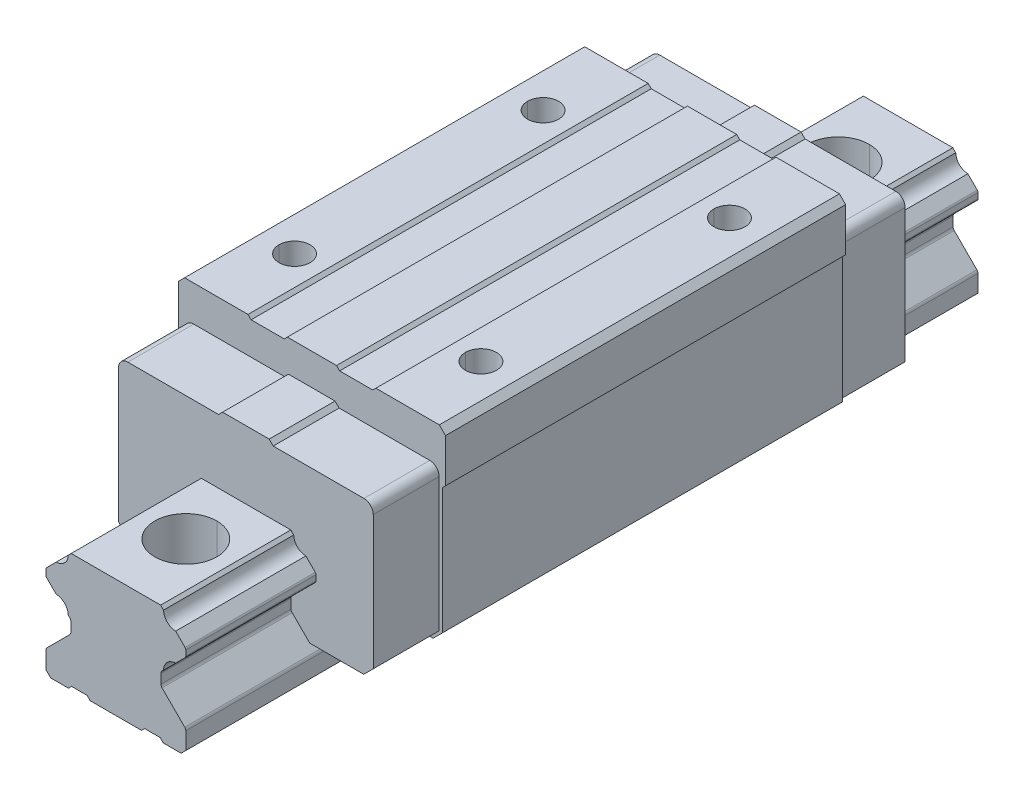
ISO-10303-21;
HEADER;
FILE_DESCRIPTION(('STEP AP214'),'2;1');
FILE_NAME('part.step','',(''),(''),'','','');
FILE_SCHEMA(('AUTOMOTIVE_DESIGN { 1 0 10303 214 1 1 1 1 }'));
ENDSEC;
DATA;
#1=APPLICATION_CONTEXT('core data for automotive mechanical design processes');
#2=APPLICATION_PROTOCOL_DEFINITION('international standard','automotive_design',2000,#1);
#3=PRODUCT_CONTEXT('',#1,'mechanical');
#4=PRODUCT('Part','Part','',(#3));
#5=PRODUCT_RELATED_PRODUCT_CATEGORY('part','',(#4));
#6=PRODUCT_DEFINITION_FORMATION('','',#4);
#7=PRODUCT_DEFINITION_CONTEXT('part definition',#1,'design');
#8=PRODUCT_DEFINITION('design','',#6,#7);
#9=PRODUCT_DEFINITION_SHAPE('','',#8);
#10=(LENGTH_UNIT() NAMED_UNIT(*) SI_UNIT(.MILLI.,.METRE.));
#11=(NAMED_UNIT(*) PLANE_ANGLE_UNIT() SI_UNIT($,.RADIAN.));
#12=(NAMED_UNIT(*) SI_UNIT($,.STERADIAN.) SOLID_ANGLE_UNIT());
#13=UNCERTAINTY_MEASURE_WITH_UNIT(LENGTH_MEASURE(1.E-05),#10,'distance_accuracy_value','');
#14=(GEOMETRIC_REPRESENTATION_CONTEXT(3) GLOBAL_UNCERTAINTY_ASSIGNED_CONTEXT((#13)) GLOBAL_UNIT_ASSIGNED_CONTEXT((#10,
#11,#12)) REPRESENTATION_CONTEXT('',''));
#15=CARTESIAN_POINT('',(0.,0.,0.));
#16=DIRECTION('',(0.,0.,1.));
#17=DIRECTION('',(1.,0.,0.));
#18=AXIS2_PLACEMENT_3D('',#15,#16,#17);
#19=CARTESIAN_POINT('',(-30.,32.,-40.));
#20=DIRECTION('',(0.,1.,0.));
#21=DIRECTION('',(-1.,0.,0.));
#22=AXIS2_PLACEMENT_3D('',#19,#20,#21);
#23=CYLINDRICAL_SURFACE('',#22,5.);
#24=CARTESIAN_POINT('',(-30.,15.,-40.));
#25=DIRECTION('',(0.,1.,0.));
#26=DIRECTION('',(-1.,0.,0.));
#27=AXIS2_PLACEMENT_3D('',#24,#25,#26);
#28=CIRCLE('',#27,5.);
#29=CARTESIAN_POINT('',(-25.,15.,-40.));
#30=VERTEX_POINT('',#29);
#31=CARTESIAN_POINT('',(-35.,15.,-40.));
#32=VERTEX_POINT('',#31);
#33=EDGE_CURVE('P0_E1287',#30,#32,#28,.T.);
#34=ORIENTED_EDGE('',*,*,#33,.F.);
#35=DIRECTION('',(0.,1.,0.));
#36=VECTOR('',#35,1.);
#37=CARTESIAN_POINT('',(-25.,32.,-40.));
#38=LINE('',#37,#36);
#39=CARTESIAN_POINT('',(-25.,32.,-40.));
#40=VERTEX_POINT('',#39);
#41=EDGE_CURVE('P0_E1096',#30,#40,#38,.T.);
#42=ORIENTED_EDGE('',*,*,#41,.T.);
#43=CARTESIAN_POINT('',(-30.,32.,-40.));
#44=DIRECTION('',(0.,-1.,0.));
#45=DIRECTION('',(-1.,0.,0.));
#46=AXIS2_PLACEMENT_3D('',#43,#44,#45);
#47=CIRCLE('',#46,5.);
#48=CARTESIAN_POINT('',(-35.,32.,-40.));
#49=VERTEX_POINT('',#48);
#50=EDGE_CURVE('P0_E957',#49,#40,#47,.T.);
#51=ORIENTED_EDGE('',*,*,#50,.F.);
#52=DIRECTION('',(0.,1.,0.));
#53=VECTOR('',#52,1.);
#54=CARTESIAN_POINT('',(-35.,32.,-40.));
#55=LINE('',#54,#53);
#56=EDGE_CURVE('P0_E1091',#32,#49,#55,.T.);
#57=ORIENTED_EDGE('',*,*,#56,.F.);
#58=EDGE_LOOP('',(#34,#42,#51,#57));
#59=FACE_BOUND('',#58,.T.);
#60=ADVANCED_FACE('P0_F17',(#59),#23,.F.);
#61=CARTESIAN_POINT('',(-30.,32.,40.));
#62=DIRECTION('',(0.,1.,0.));
#63=DIRECTION('',(-1.,0.,0.));
#64=AXIS2_PLACEMENT_3D('',#61,#62,#63);
#65=CYLINDRICAL_SURFACE('',#64,5.);
#66=CARTESIAN_POINT('',(-30.,15.,40.));
#67=DIRECTION('',(0.,1.,0.));
#68=DIRECTION('',(-1.,0.,0.));
#69=AXIS2_PLACEMENT_3D('',#66,#67,#68);
#70=CIRCLE('',#69,5.);
#71=CARTESIAN_POINT('',(-25.,15.,40.));
#72=VERTEX_POINT('',#71);
#73=CARTESIAN_POINT('',(-35.,15.,40.));
#74=VERTEX_POINT('',#73);
#75=EDGE_CURVE('P0_E1299',#72,#74,#70,.T.);
#76=ORIENTED_EDGE('',*,*,#75,.F.);
#77=DIRECTION('',(0.,1.,0.));
#78=VECTOR('',#77,1.);
#79=CARTESIAN_POINT('',(-25.,32.,40.));
#80=LINE('',#79,#78);
#81=CARTESIAN_POINT('',(-25.,32.,40.));
#82=VERTEX_POINT('',#81);
#83=EDGE_CURVE('P0_E1102',#72,#82,#80,.T.);
#84=ORIENTED_EDGE('',*,*,#83,.T.);
#85=CARTESIAN_POINT('',(-30.,32.,40.));
#86=DIRECTION('',(0.,-1.,0.));
#87=DIRECTION('',(-1.,0.,0.));
#88=AXIS2_PLACEMENT_3D('',#85,#86,#87);
#89=CIRCLE('',#88,5.);
#90=CARTESIAN_POINT('',(-35.,32.,40.));
#91=VERTEX_POINT('',#90);
#92=EDGE_CURVE('P0_E954',#91,#82,#89,.T.);
#93=ORIENTED_EDGE('',*,*,#92,.F.);
#94=DIRECTION('',(0.,1.,0.));
#95=VECTOR('',#94,1.);
#96=CARTESIAN_POINT('',(-35.,32.,40.));
#97=LINE('',#96,#95);
#98=EDGE_CURVE('P0_E1101',#74,#91,#97,.T.);
#99=ORIENTED_EDGE('',*,*,#98,.F.);
#100=EDGE_LOOP('',(#76,#84,#93,#99));
#101=FACE_BOUND('',#100,.T.);
#102=ADVANCED_FACE('P0_F19',(#101),#65,.F.);
#103=CARTESIAN_POINT('',(30.,32.,-40.));
#104=DIRECTION('',(0.,1.,0.));
#105=DIRECTION('',(-1.,0.,0.));
#106=AXIS2_PLACEMENT_3D('',#103,#104,#105);
#107=CYLINDRICAL_SURFACE('',#106,5.);
#108=CARTESIAN_POINT('',(30.,15.,-40.));
#109=DIRECTION('',(0.,1.,0.));
#110=DIRECTION('',(-1.,0.,0.));
#111=AXIS2_PLACEMENT_3D('',#108,#109,#110);
#112=CIRCLE('',#111,5.);
#113=CARTESIAN_POINT('',(35.,15.,-40.));
#114=VERTEX_POINT('',#113);
#115=CARTESIAN_POINT('',(25.,15.,-40.));
#116=VERTEX_POINT('',#115);
#117=EDGE_CURVE('P0_E1300',#114,#116,#112,.T.);
#118=ORIENTED_EDGE('',*,*,#117,.F.);
#119=DIRECTION('',(0.,1.,0.));
#120=VECTOR('',#119,1.);
#121=CARTESIAN_POINT('',(35.,32.,-40.));
#122=LINE('',#121,#120);
#123=CARTESIAN_POINT('',(35.,32.,-40.));
#124=VERTEX_POINT('',#123);
#125=EDGE_CURVE('P0_E1158',#114,#124,#122,.T.);
#126=ORIENTED_EDGE('',*,*,#125,.T.);
#127=CARTESIAN_POINT('',(30.,32.,-40.));
#128=DIRECTION('',(0.,-1.,0.));
#129=DIRECTION('',(-1.,0.,0.));
#130=AXIS2_PLACEMENT_3D('',#127,#128,#129);
#131=CIRCLE('',#130,5.);
#132=CARTESIAN_POINT('',(25.,32.,-40.));
#133=VERTEX_POINT('',#132);
#134=EDGE_CURVE('P0_E925',#133,#124,#131,.T.);
#135=ORIENTED_EDGE('',*,*,#134,.F.);
#136=DIRECTION('',(0.,1.,0.));
#137=VECTOR('',#136,1.);
#138=CARTESIAN_POINT('',(25.,32.,-40.));
#139=LINE('',#138,#137);
#140=EDGE_CURVE('P0_E1162',#116,#133,#139,.T.);
#141=ORIENTED_EDGE('',*,*,#140,.F.);
#142=EDGE_LOOP('',(#118,#126,#135,#141));
#143=FACE_BOUND('',#142,.T.);
#144=ADVANCED_FACE('P0_F1762',(#143),#107,.F.);
#145=CARTESIAN_POINT('',(30.,32.,40.));
#146=DIRECTION('',(0.,1.,0.));
#147=DIRECTION('',(-1.,0.,0.));
#148=AXIS2_PLACEMENT_3D('',#145,#146,#147);
#149=CYLINDRICAL_SURFACE('',#148,5.);
#150=CARTESIAN_POINT('',(30.,15.,40.));
#151=DIRECTION('',(0.,1.,0.));
#152=DIRECTION('',(-1.,0.,0.));
#153=AXIS2_PLACEMENT_3D('',#150,#151,#152);
#154=CIRCLE('',#153,5.);
#155=CARTESIAN_POINT('',(35.,15.,40.));
#156=VERTEX_POINT('',#155);
#157=CARTESIAN_POINT('',(25.,15.,40.));
#158=VERTEX_POINT('',#157);
#159=EDGE_CURVE('P0_E1305',#156,#158,#154,.T.);
#160=ORIENTED_EDGE('',*,*,#159,.F.);
#161=DIRECTION('',(0.,1.,0.));
#162=VECTOR('',#161,1.);
#163=CARTESIAN_POINT('',(35.,32.,40.));
#164=LINE('',#163,#162);
#165=CARTESIAN_POINT('',(35.,32.,40.));
#166=VERTEX_POINT('',#165);
#167=EDGE_CURVE('P0_E1359',#156,#166,#164,.T.);
#168=ORIENTED_EDGE('',*,*,#167,.T.);
#169=CARTESIAN_POINT('',(30.,32.,40.));
#170=DIRECTION('',(0.,-1.,0.));
#171=DIRECTION('',(-1.,0.,0.));
#172=AXIS2_PLACEMENT_3D('',#169,#170,#171);
#173=CIRCLE('',#172,5.);
#174=CARTESIAN_POINT('',(25.,32.,40.));
#175=VERTEX_POINT('',#174);
#176=EDGE_CURVE('P0_E922',#175,#166,#173,.T.);
#177=ORIENTED_EDGE('',*,*,#176,.F.);
#178=DIRECTION('',(0.,1.,0.));
#179=VECTOR('',#178,1.);
#180=CARTESIAN_POINT('',(25.,32.,40.));
#181=LINE('',#180,#179);
#182=EDGE_CURVE('P0_E1170',#158,#175,#181,.T.);
#183=ORIENTED_EDGE('',*,*,#182,.F.);
#184=EDGE_LOOP('',(#160,#168,#177,#183));
#185=FACE_BOUND('',#184,.T.);
#186=ADVANCED_FACE('P0_F1965',(#185),#149,.F.);
#187=CARTESIAN_POINT('',(0.,0.,85.6));
#188=DIRECTION('',(0.,0.,1.));
#189=DIRECTION('',(1.,0.,0.));
#190=AXIS2_PLACEMENT_3D('',#187,#188,#189);
#191=PLANE('',#190);
#192=DIRECTION('',(0.,-1.,0.));
#193=VECTOR('',#192,1.);
#194=CARTESIAN_POINT('',(14.5,0.,85.6));
#195=LINE('',#194,#193);
#196=CARTESIAN_POINT('',(14.5,-18.99743427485,85.6));
#197=VERTEX_POINT('',#196);
#198=CARTESIAN_POINT('',(14.5,-22.00261712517,85.6));
#199=VERTEX_POINT('',#198);
#200=EDGE_CURVE('P0_E1178',#197,#199,#195,.T.);
#201=ORIENTED_EDGE('',*,*,#200,.T.);
#202=CARTESIAN_POINT('',(15.7,-22.00261712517,85.6));
#203=DIRECTION('',(0.,0.,-1.));
#204=DIRECTION('',(1.,0.,0.));
#205=AXIS2_PLACEMENT_3D('',#202,#203,#204);
#206=CIRCLE('',#205,1.2);
#207=CARTESIAN_POINT('',(14.8514718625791,-22.8511452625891,85.6));
#208=VERTEX_POINT('',#207);
#209=EDGE_CURVE('P0_E1310',#208,#199,#206,.T.);
#210=ORIENTED_EDGE('',*,*,#209,.F.);
#211=DIRECTION('',(0.707106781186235,-0.707106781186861,0.));
#212=VECTOR('',#211,1.);
#213=CARTESIAN_POINT('',(14.8514718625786,-22.8511452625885,85.6));
#214=LINE('',#213,#212);
#215=CARTESIAN_POINT('',(20.500326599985,-28.5,85.6));
#216=VERTEX_POINT('',#215);
#217=EDGE_CURVE('P0_E1173',#208,#216,#214,.T.);
#218=ORIENTED_EDGE('',*,*,#217,.T.);
#219=DIRECTION('',(-1.,0.,0.));
#220=VECTOR('',#219,1.);
#221=CARTESIAN_POINT('',(20.50032659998,-28.5,85.6));
#222=LINE('',#221,#220);
#223=CARTESIAN_POINT('',(37.88728995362,-28.5,85.6));
#224=VERTEX_POINT('',#223);
#225=EDGE_CURVE('P0_E694',#224,#216,#222,.T.);
#226=ORIENTED_EDGE('',*,*,#225,.F.);
#227=DIRECTION('',(-0.707106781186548,-0.707106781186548,0.));
#228=VECTOR('',#227,1.);
#229=CARTESIAN_POINT('',(37.88728995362,-28.5,85.6));
#230=LINE('',#229,#228);
#231=CARTESIAN_POINT('',(40.94270697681,-25.44458297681,85.6));
#232=VERTEX_POINT('',#231);
#233=EDGE_CURVE('P0_E737',#232,#224,#230,.T.);
#234=ORIENTED_EDGE('',*,*,#233,.F.);
#235=DIRECTION('',(0.,-1.,0.));
#236=VECTOR('',#235,1.);
#237=CARTESIAN_POINT('',(40.94270697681,-25.44458297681,85.6));
#238=LINE('',#237,#236);
#239=CARTESIAN_POINT('',(40.94270697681,17.55541702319,85.6));
#240=VERTEX_POINT('',#239);
#241=EDGE_CURVE('P0_E794',#240,#232,#238,.T.);
#242=ORIENTED_EDGE('',*,*,#241,.F.);
#243=CARTESIAN_POINT('',(37.94270697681,17.55541702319,85.6));
#244=DIRECTION('',(0.,0.,-1.));
#245=DIRECTION('',(1.,0.,0.));
#246=AXIS2_PLACEMENT_3D('',#243,#244,#245);
#247=CIRCLE('',#246,3.);
#248=CARTESIAN_POINT('',(37.94270697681,20.55541702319,85.6));
#249=VERTEX_POINT('',#248);
#250=EDGE_CURVE('P0_E776',#249,#240,#247,.T.);
#251=ORIENTED_EDGE('',*,*,#250,.F.);
#252=DIRECTION('',(1.,0.,0.));
#253=VECTOR('',#252,1.);
#254=CARTESIAN_POINT('',(37.94270697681,20.55541702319,85.6));
#255=LINE('',#254,#253);
#256=CARTESIAN_POINT('',(8.74270697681,20.55541702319,85.6));
#257=VERTEX_POINT('',#256);
#258=EDGE_CURVE('P0_E764',#257,#249,#255,.T.);
#259=ORIENTED_EDGE('',*,*,#258,.F.);
#260=DIRECTION('',(0.707106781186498,-0.707106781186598,0.));
#261=VECTOR('',#260,1.);
#262=CARTESIAN_POINT('',(8.74270697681,20.55541702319,85.6));
#263=LINE('',#262,#261);
#264=CARTESIAN_POINT('',(7.44270697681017,21.85541702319,85.6));
#265=VERTEX_POINT('',#264);
#266=EDGE_CURVE('P0_E746',#265,#257,#263,.T.);
#267=ORIENTED_EDGE('',*,*,#266,.F.);
#268=DIRECTION('',(1.,0.,0.));
#269=VECTOR('',#268,1.);
#270=CARTESIAN_POINT('',(7.44270697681,21.85541702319,85.6));
#271=LINE('',#270,#269);
#272=CARTESIAN_POINT('',(-7.55729302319,21.85541702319,85.6));
#273=VERTEX_POINT('',#272);
#274=EDGE_CURVE('P0_E860',#273,#265,#271,.T.);
#275=ORIENTED_EDGE('',*,*,#274,.F.);
#276=DIRECTION('',(0.707106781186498,0.707106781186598,0.));
#277=VECTOR('',#276,1.);
#278=CARTESIAN_POINT('',(-7.55729302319,21.85541702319,85.6));
#279=LINE('',#278,#277);
#280=CARTESIAN_POINT('',(-8.85729302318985,20.5554170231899,85.6));
#281=VERTEX_POINT('',#280);
#282=EDGE_CURVE('P0_E853',#281,#273,#279,.T.);
#283=ORIENTED_EDGE('',*,*,#282,.F.);
#284=DIRECTION('',(1.,0.,0.));
#285=VECTOR('',#284,1.);
#286=CARTESIAN_POINT('',(-8.85729302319,20.55541702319,85.6));
#287=LINE('',#286,#285);
#288=CARTESIAN_POINT('',(-38.05729302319,20.55541702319,85.6));
#289=VERTEX_POINT('',#288);
#290=EDGE_CURVE('P0_E841',#289,#281,#287,.T.);
#291=ORIENTED_EDGE('',*,*,#290,.F.);
#292=CARTESIAN_POINT('',(-38.05729302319,17.55541702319,85.6));
#293=DIRECTION('',(0.,0.,-1.));
#294=DIRECTION('',(1.,0.,0.));
#295=AXIS2_PLACEMENT_3D('',#292,#293,#294);
#296=CIRCLE('',#295,3.);
#297=CARTESIAN_POINT('',(-41.05729302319,17.55541702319,85.6));
#298=VERTEX_POINT('',#297);
#299=EDGE_CURVE('P0_E751',#298,#289,#296,.T.);
#300=ORIENTED_EDGE('',*,*,#299,.F.);
#301=DIRECTION('',(0.,1.,0.));
#302=VECTOR('',#301,1.);
#303=CARTESIAN_POINT('',(-41.05729302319,17.55541702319,85.6));
#304=LINE('',#303,#302);
#305=CARTESIAN_POINT('',(-41.05729302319,-25.44458297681,85.6));
#306=VERTEX_POINT('',#305);
#307=EDGE_CURVE('P0_E823',#306,#298,#304,.T.);
#308=ORIENTED_EDGE('',*,*,#307,.F.);
#309=DIRECTION('',(-0.707106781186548,0.707106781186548,0.));
#310=VECTOR('',#309,1.);
#311=CARTESIAN_POINT('',(-41.05729302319,-25.44458297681,85.6));
#312=LINE('',#311,#310);
#313=CARTESIAN_POINT('',(-38.001876,-28.5,85.6));
#314=VERTEX_POINT('',#313);
#315=EDGE_CURVE('P0_E811',#314,#306,#312,.T.);
#316=ORIENTED_EDGE('',*,*,#315,.F.);
#317=DIRECTION('',(-1.,0.,0.));
#318=VECTOR('',#317,1.);
#319=CARTESIAN_POINT('',(-39.,-28.5,85.6));
#320=LINE('',#319,#318);
#321=CARTESIAN_POINT('',(-20.50032659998,-28.5,85.6));
#322=VERTEX_POINT('',#321);
#323=EDGE_CURVE('P0_E1086',#322,#314,#320,.T.);
#324=ORIENTED_EDGE('',*,*,#323,.F.);
#325=DIRECTION('',(0.707106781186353,0.707106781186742,0.));
#326=VECTOR('',#325,1.);
#327=CARTESIAN_POINT('',(-20.50032659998,-28.5,85.6));
#328=LINE('',#327,#326);
#329=CARTESIAN_POINT('',(-14.8514718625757,-22.8511452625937,85.6));
#330=VERTEX_POINT('',#329);
#331=EDGE_CURVE('P0_E1283',#322,#330,#328,.T.);
#332=ORIENTED_EDGE('',*,*,#331,.T.);
#333=CARTESIAN_POINT('',(-15.7,-22.00261712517,85.6));
#334=DIRECTION('',(0.,0.,-1.));
#335=DIRECTION('',(1.,0.,0.));
#336=AXIS2_PLACEMENT_3D('',#333,#334,#335);
#337=CIRCLE('',#336,1.2);
#338=CARTESIAN_POINT('',(-14.5,-22.00261712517,85.6));
#339=VERTEX_POINT('',#338);
#340=EDGE_CURVE('P0_E1563',#339,#330,#337,.T.);
#341=ORIENTED_EDGE('',*,*,#340,.F.);
#342=DIRECTION('',(0.,1.,0.));
#343=VECTOR('',#342,1.);
#344=CARTESIAN_POINT('',(-14.5,0.,85.6));
#345=LINE('',#344,#343);
#346=CARTESIAN_POINT('',(-14.4999999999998,-18.99743427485,85.6));
#347=VERTEX_POINT('',#346);
#348=EDGE_CURVE('P0_E1273',#339,#347,#345,.T.);
#349=ORIENTED_EDGE('',*,*,#348,.T.);
#350=CARTESIAN_POINT('',(-15.7,-18.99743427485,85.6));
#351=DIRECTION('',(0.,0.,-1.));
#352=DIRECTION('',(1.,0.,0.));
#353=AXIS2_PLACEMENT_3D('',#350,#351,#352);
#354=CIRCLE('',#353,1.2);
#355=CARTESIAN_POINT('',(-14.851471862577,-18.148906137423,85.6));
#356=VERTEX_POINT('',#355);
#357=EDGE_CURVE('P0_E1509',#356,#347,#354,.T.);
#358=ORIENTED_EDGE('',*,*,#357,.F.);
#359=DIRECTION('',(0.707106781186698,-0.707106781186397,0.));
#360=VECTOR('',#359,1.);
#361=CARTESIAN_POINT('',(-14.85147186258,-18.14890613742,85.6));
#362=LINE('',#361,#360);
#363=CARTESIAN_POINT('',(-15.333482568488,-17.6668954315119,85.6));
#364=VERTEX_POINT('',#363);
#365=EDGE_CURVE('P0_E1476',#364,#356,#362,.T.);
#366=ORIENTED_EDGE('',*,*,#365,.F.);
#367=CARTESIAN_POINT('',(-19.33229302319,-17.76444002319,85.6));
#368=DIRECTION('',(0.,0.,1.));
#369=DIRECTION('',(1.,0.,0.));
#370=AXIS2_PLACEMENT_3D('',#367,#368,#369);
#371=CIRCLE('',#370,4.);
#372=CARTESIAN_POINT('',(-19.2347484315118,-13.7656295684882,85.6));
#373=VERTEX_POINT('',#372);
#374=EDGE_CURVE('P0_E1257',#364,#373,#371,.T.);
#375=ORIENTED_EDGE('',*,*,#374,.T.);
#376=DIRECTION('',(-0.70710678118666,0.707106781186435,0.));
#377=VECTOR('',#376,1.);
#378=CARTESIAN_POINT('',(-19.2347484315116,-13.7656295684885,85.6));
#379=LINE('',#378,#377);
#380=CARTESIAN_POINT('',(-22.2656854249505,-10.7346925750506,85.6));
#381=VERTEX_POINT('',#380);
#382=EDGE_CURVE('P0_E1251',#373,#381,#379,.T.);
#383=ORIENTED_EDGE('',*,*,#382,.T.);
#384=CARTESIAN_POINT('',(-21.7,-10.1690071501,85.6));
#385=DIRECTION('',(0.,0.,-1.));
#386=DIRECTION('',(1.,0.,0.));
#387=AXIS2_PLACEMENT_3D('',#384,#385,#386);
#388=CIRCLE('',#387,0.8);
#389=CARTESIAN_POINT('',(-22.5,-10.1690071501,85.6));
#390=VERTEX_POINT('',#389);
#391=EDGE_CURVE('P0_E1496',#381,#390,#388,.T.);
#392=ORIENTED_EDGE('',*,*,#391,.T.);
#393=DIRECTION('',(0.,1.,0.));
#394=VECTOR('',#393,1.);
#395=CARTESIAN_POINT('',(-22.5,0.,85.6));
#396=LINE('',#395,#394);
#397=CARTESIAN_POINT('',(-22.4999999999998,-8.431021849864,85.6));
#398=VERTEX_POINT('',#397);
#399=EDGE_CURVE('P0_E1242',#390,#398,#396,.T.);
#400=ORIENTED_EDGE('',*,*,#399,.T.);
#401=CARTESIAN_POINT('',(-21.7,-8.431021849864,85.6));
#402=DIRECTION('',(0.,0.,-1.));
#403=DIRECTION('',(1.,0.,0.));
#404=AXIS2_PLACEMENT_3D('',#401,#402,#403);
#405=CIRCLE('',#404,0.8);
#406=CARTESIAN_POINT('',(-22.2656854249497,-7.86533642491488,85.6));
#407=VERTEX_POINT('',#406);
#408=EDGE_CURVE('P0_E1468',#398,#407,#405,.T.);
#409=ORIENTED_EDGE('',*,*,#408,.T.);
#410=DIRECTION('',(0.707106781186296,0.707106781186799,0.));
#411=VECTOR('',#410,1.);
#412=CARTESIAN_POINT('',(-22.2656854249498,-7.86533642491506,85.6));
#413=LINE('',#412,#411);
#414=CARTESIAN_POINT('',(-19.2337171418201,-4.8333681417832,85.6));
#415=VERTEX_POINT('',#414);
#416=EDGE_CURVE('P0_E1233',#407,#415,#413,.T.);
#417=ORIENTED_EDGE('',*,*,#416,.T.);
#418=CARTESIAN_POINT('',(-19.33229302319,-0.8345829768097,85.6));
#419=DIRECTION('',(0.,0.,1.));
#420=DIRECTION('',(1.,0.,0.));
#421=AXIS2_PLACEMENT_3D('',#418,#419,#420);
#422=CIRCLE('',#421,4.);
#423=CARTESIAN_POINT('',(-15.3335078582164,-0.933158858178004,85.6));
#424=VERTEX_POINT('',#423);
#425=EDGE_CURVE('P0_E1232',#415,#424,#422,.T.);
#426=ORIENTED_EDGE('',*,*,#425,.T.);
#427=DIRECTION('',(-0.707106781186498,-0.707106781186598,0.));
#428=VECTOR('',#427,1.);
#429=CARTESIAN_POINT('',(-15.33350785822,-0.9331588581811,85.6));
#430=LINE('',#429,#428);
#431=CARTESIAN_POINT('',(-14.4003490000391,0.,85.6));
#432=VERTEX_POINT('',#431);
#433=EDGE_CURVE('P0_E1437',#432,#424,#430,.T.);
#434=ORIENTED_EDGE('',*,*,#433,.F.);
#435=DIRECTION('',(1.,0.,0.));
#436=VECTOR('',#435,1.);
#437=CARTESIAN_POINT('',(0.,0.,85.6));
#438=LINE('',#437,#436);
#439=CARTESIAN_POINT('',(14.4003490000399,0.,85.6));
#440=VERTEX_POINT('',#439);
#441=EDGE_CURVE('P0_E1265',#432,#440,#438,.T.);
#442=ORIENTED_EDGE('',*,*,#441,.T.);
#443=DIRECTION('',(-0.707106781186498,0.707106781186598,0.));
#444=VECTOR('',#443,1.);
#445=CARTESIAN_POINT('',(14.40034900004,-1.137E-13,85.6));
#446=LINE('',#445,#444);
#447=CARTESIAN_POINT('',(15.3335078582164,-0.933158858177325,85.6));
#448=VERTEX_POINT('',#447);
#449=EDGE_CURVE('P0_E1411',#448,#440,#446,.T.);
#450=ORIENTED_EDGE('',*,*,#449,.F.);
#451=CARTESIAN_POINT('',(19.33229302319,-0.8345829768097,85.6));
#452=DIRECTION('',(0.,0.,1.));
#453=DIRECTION('',(1.,0.,0.));
#454=AXIS2_PLACEMENT_3D('',#451,#452,#453);
#455=CIRCLE('',#454,4.);
#456=CARTESIAN_POINT('',(19.2337171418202,-4.83336814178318,85.6));
#457=VERTEX_POINT('',#456);
#458=EDGE_CURVE('P0_E1209',#448,#457,#455,.T.);
#459=ORIENTED_EDGE('',*,*,#458,.T.);
#460=DIRECTION('',(0.707106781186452,-0.707106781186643,0.));
#461=VECTOR('',#460,1.);
#462=CARTESIAN_POINT('',(19.2337171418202,-4.83336814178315,85.6));
#463=LINE('',#462,#461);
#464=CARTESIAN_POINT('',(22.2656854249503,-7.86533642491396,85.6));
#465=VERTEX_POINT('',#464);
#466=EDGE_CURVE('P0_E1196',#457,#465,#463,.T.);
#467=ORIENTED_EDGE('',*,*,#466,.T.);
#468=CARTESIAN_POINT('',(21.7,-8.431021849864,85.6));
#469=DIRECTION('',(0.,0.,-1.));
#470=DIRECTION('',(1.,-3.28296417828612E-12,0.));
#471=AXIS2_PLACEMENT_3D('',#468,#469,#470);
#472=CIRCLE('',#471,0.8);
#473=CARTESIAN_POINT('',(22.5,-8.43102184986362,85.6));
#474=VERTEX_POINT('',#473);
#475=EDGE_CURVE('P0_E1396',#465,#474,#472,.T.);
#476=ORIENTED_EDGE('',*,*,#475,.T.);
#477=DIRECTION('',(0.,-1.,0.));
#478=VECTOR('',#477,1.);
#479=CARTESIAN_POINT('',(22.5,0.,85.6));
#480=LINE('',#479,#478);
#481=CARTESIAN_POINT('',(22.5000000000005,-10.1690071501,85.6));
#482=VERTEX_POINT('',#481);
#483=EDGE_CURVE('P0_E1190',#474,#482,#480,.T.);
#484=ORIENTED_EDGE('',*,*,#483,.T.);
#485=CARTESIAN_POINT('',(21.7,-10.1690071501,85.6));
#486=DIRECTION('',(0.,0.,-1.));
#487=DIRECTION('',(1.,0.,0.));
#488=AXIS2_PLACEMENT_3D('',#485,#486,#487);
#489=CIRCLE('',#488,0.8);
#490=CARTESIAN_POINT('',(22.2656854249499,-10.7346925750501,85.6));
#491=VERTEX_POINT('',#490);
#492=EDGE_CURVE('P0_E1367',#482,#491,#489,.T.);
#493=ORIENTED_EDGE('',*,*,#492,.T.);
#494=DIRECTION('',(-0.707106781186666,-0.70710678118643,0.));
#495=VECTOR('',#494,1.);
#496=CARTESIAN_POINT('',(22.2656854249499,-10.73469257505,85.6));
#497=LINE('',#496,#495);
#498=CARTESIAN_POINT('',(19.234748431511,-13.765629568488,85.6));
#499=VERTEX_POINT('',#498);
#500=EDGE_CURVE('P0_E1213',#491,#499,#497,.T.);
#501=ORIENTED_EDGE('',*,*,#500,.T.);
#502=CARTESIAN_POINT('',(19.33229302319,-17.76444002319,85.6));
#503=DIRECTION('',(0.,0.,1.));
#504=DIRECTION('',(1.,0.,0.));
#505=AXIS2_PLACEMENT_3D('',#502,#503,#504);
#506=CIRCLE('',#505,4.);
#507=CARTESIAN_POINT('',(15.333482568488,-17.6668954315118,85.6));
#508=VERTEX_POINT('',#507);
#509=EDGE_CURVE('P0_E1184',#499,#508,#506,.T.);
#510=ORIENTED_EDGE('',*,*,#509,.T.);
#511=DIRECTION('',(0.707106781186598,0.707106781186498,0.));
#512=VECTOR('',#511,1.);
#513=CARTESIAN_POINT('',(15.33348256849,-17.66689543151,85.6));
#514=LINE('',#513,#512);
#515=CARTESIAN_POINT('',(14.8514718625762,-18.1489061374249,85.6));
#516=VERTEX_POINT('',#515);
#517=EDGE_CURVE('P0_E1336',#516,#508,#514,.T.);
#518=ORIENTED_EDGE('',*,*,#517,.F.);
#519=CARTESIAN_POINT('',(15.7,-18.99743427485,85.6));
#520=DIRECTION('',(0.,0.,-1.));
#521=DIRECTION('',(1.,0.,0.));
#522=AXIS2_PLACEMENT_3D('',#519,#520,#521);
#523=CIRCLE('',#522,1.2);
#524=EDGE_CURVE('P0_E1322',#197,#516,#523,.T.);
#525=ORIENTED_EDGE('',*,*,#524,.F.);
#526=EDGE_LOOP('',(#201,#210,#218,#226,#234,#242,#251,#259,#267,#275,#283,#291,#300,#308,#316,
#324,#332,#341,#349,#358,#366,#375,#383,#392,#400,#409,#417,#426,#434,#442,#450,#459,#467,#476,
#484,#493,#501,#510,#518,#525));
#527=FACE_BOUND('',#526,.T.);
#528=ADVANCED_FACE('P0_F1606',(#527),#191,.T.);
#529=CARTESIAN_POINT('',(42.,-25.5,-64.4));
#530=DIRECTION('',(1.,0.,0.));
#531=DIRECTION('',(0.,1.,0.));
#532=AXIS2_PLACEMENT_3D('',#529,#530,#531);
#533=PLANE('',#532);
#534=DIRECTION('',(0.,0.,-1.));
#535=VECTOR('',#534,1.);
#536=CARTESIAN_POINT('',(42.,-25.5,-64.4));
#537=LINE('',#536,#535);
#538=CARTESIAN_POINT('',(42.,-25.5,64.4));
#539=VERTEX_POINT('',#538);
#540=CARTESIAN_POINT('',(42.,-25.5,-64.4));
#541=VERTEX_POINT('',#540);
#542=EDGE_CURVE('P0_E26',#539,#541,#537,.T.);
#543=ORIENTED_EDGE('',*,*,#542,.T.);
#544=DIRECTION('',(0.,1.,0.));
#545=VECTOR('',#544,1.);
#546=CARTESIAN_POINT('',(42.,-25.5,-64.4));
#547=LINE('',#546,#545);
#548=CARTESIAN_POINT('',(42.,15.,-64.4));
#549=VERTEX_POINT('',#548);
#550=EDGE_CURVE('P0_E10',#541,#549,#547,.T.);
#551=ORIENTED_EDGE('',*,*,#550,.T.);
#552=DIRECTION('',(0.,0.,1.));
#553=VECTOR('',#552,1.);
#554=CARTESIAN_POINT('',(42.,15.,-64.4));
#555=LINE('',#554,#553);
#556=CARTESIAN_POINT('',(42.,15.,64.4));
#557=VERTEX_POINT('',#556);
#558=EDGE_CURVE('P0_E1033',#549,#557,#555,.T.);
#559=ORIENTED_EDGE('',*,*,#558,.T.);
#560=DIRECTION('',(0.,-1.,0.));
#561=VECTOR('',#560,1.);
#562=CARTESIAN_POINT('',(42.,-25.5,64.4));
#563=LINE('',#562,#561);
#564=EDGE_CURVE('P0_E1044',#557,#539,#563,.T.);
#565=ORIENTED_EDGE('',*,*,#564,.T.);
#566=EDGE_LOOP('',(#543,#551,#559,#565));
#567=FACE_BOUND('',#566,.T.);
#568=ADVANCED_FACE('P0_F1814',(#567),#533,.T.);
#569=CARTESIAN_POINT('',(0.,0.,-64.4));
#570=DIRECTION('',(0.,0.,1.));
#571=DIRECTION('',(1.,0.,0.));
#572=AXIS2_PLACEMENT_3D('',#569,#570,#571);
#573=PLANE('',#572);
#574=DIRECTION('',(1.,0.,0.));
#575=VECTOR('',#574,1.);
#576=CARTESIAN_POINT('',(0.,21.85541702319,-64.4));
#577=LINE('',#576,#575);
#578=CARTESIAN_POINT('',(-7.55729302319,21.85541702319,-64.4));
#579=VERTEX_POINT('',#578);
#580=CARTESIAN_POINT('',(7.4427069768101,21.85541702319,-64.4));
#581=VERTEX_POINT('',#580);
#582=EDGE_CURVE('P0_E1023',#579,#581,#577,.T.);
#583=ORIENTED_EDGE('',*,*,#582,.F.);
#584=DIRECTION('',(0.707106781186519,0.707106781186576,0.));
#585=VECTOR('',#584,1.);
#586=CARTESIAN_POINT('',(-8.85729302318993,20.5554170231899,-64.4));
#587=LINE('',#586,#585);
#588=CARTESIAN_POINT('',(-8.85729302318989,20.55541702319,-64.4));
#589=VERTEX_POINT('',#588);
#590=EDGE_CURVE('P0_E1018',#589,#579,#587,.T.);
#591=ORIENTED_EDGE('',*,*,#590,.F.);
#592=DIRECTION('',(1.,0.,0.));
#593=VECTOR('',#592,1.);
#594=CARTESIAN_POINT('',(0.,20.55541702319,-64.4));
#595=LINE('',#594,#593);
#596=CARTESIAN_POINT('',(-38.05729302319,20.55541702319,-64.4));
#597=VERTEX_POINT('',#596);
#598=EDGE_CURVE('P0_E1011',#597,#589,#595,.T.);
#599=ORIENTED_EDGE('',*,*,#598,.F.);
#600=CARTESIAN_POINT('',(-38.05729302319,17.55541702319,-64.4));
#601=DIRECTION('',(0.,0.,-1.));
#602=DIRECTION('',(1.,0.,0.));
#603=AXIS2_PLACEMENT_3D('',#600,#601,#602);
#604=CIRCLE('',#603,3.);
#605=CARTESIAN_POINT('',(-41.05729302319,17.55541702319,-64.4));
#606=VERTEX_POINT('',#605);
#607=EDGE_CURVE('P0_E1004',#606,#597,#604,.T.);
#608=ORIENTED_EDGE('',*,*,#607,.F.);
#609=DIRECTION('',(0.,1.,0.));
#610=VECTOR('',#609,1.);
#611=CARTESIAN_POINT('',(-41.05729302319,0.,-64.4));
#612=LINE('',#611,#610);
#613=CARTESIAN_POINT('',(-41.05729302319,-25.44458297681,-64.4));
#614=VERTEX_POINT('',#613);
#615=EDGE_CURVE('P0_E996',#614,#606,#612,.T.);
#616=ORIENTED_EDGE('',*,*,#615,.F.);
#617=DIRECTION('',(-0.707106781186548,0.707106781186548,0.));
#618=VECTOR('',#617,1.);
#619=CARTESIAN_POINT('',(-38.001876,-28.5,-64.4));
#620=LINE('',#619,#618);
#621=CARTESIAN_POINT('',(-38.001876,-28.5,-64.4));
#622=VERTEX_POINT('',#621);
#623=EDGE_CURVE('P0_E989',#622,#614,#620,.T.);
#624=ORIENTED_EDGE('',*,*,#623,.F.);
#625=DIRECTION('',(1.,0.,0.));
#626=VECTOR('',#625,1.);
#627=CARTESIAN_POINT('',(-39.,-28.5,-64.4));
#628=LINE('',#627,#626);
#629=CARTESIAN_POINT('',(-39.,-28.5,-64.4));
#630=VERTEX_POINT('',#629);
#631=EDGE_CURVE('P0_E1199',#630,#622,#628,.T.);
#632=ORIENTED_EDGE('',*,*,#631,.F.);
#633=DIRECTION('',(0.707106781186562,-0.707106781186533,0.));
#634=VECTOR('',#633,1.);
#635=CARTESIAN_POINT('',(-42.,-25.5,-64.4));
#636=LINE('',#635,#634);
#637=CARTESIAN_POINT('',(-42.,-25.5,-64.4));
#638=VERTEX_POINT('',#637);
#639=EDGE_CURVE('P0_E983',#638,#630,#636,.T.);
#640=ORIENTED_EDGE('',*,*,#639,.F.);
#641=DIRECTION('',(0.,-1.,0.));
#642=VECTOR('',#641,1.);
#643=CARTESIAN_POINT('',(-42.,0.,-64.4));
#644=LINE('',#643,#642);
#645=CARTESIAN_POINT('',(-42.,-2.15888586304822E-13,-64.4));
#646=VERTEX_POINT('',#645);
#647=EDGE_CURVE('P0_E974',#646,#638,#644,.T.);
#648=ORIENTED_EDGE('',*,*,#647,.F.);
#649=DIRECTION('',(0.707106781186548,-0.707106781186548,0.));
#650=VECTOR('',#649,1.);
#651=CARTESIAN_POINT('',(-43.,0.9999999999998,-64.4));
#652=LINE('',#651,#650);
#653=CARTESIAN_POINT('',(-43.,0.9999999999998,-64.4));
#654=VERTEX_POINT('',#653);
#655=EDGE_CURVE('P0_E1223',#654,#646,#652,.T.);
#656=ORIENTED_EDGE('',*,*,#655,.F.);
#657=DIRECTION('',(0.,-1.,0.));
#658=VECTOR('',#657,1.);
#659=CARTESIAN_POINT('',(-43.,0.,-64.4));
#660=LINE('',#659,#658);
#661=CARTESIAN_POINT('',(-43.,30.,-64.4));
#662=VERTEX_POINT('',#661);
#663=EDGE_CURVE('P0_E968',#662,#654,#660,.T.);
#664=ORIENTED_EDGE('',*,*,#663,.F.);
#665=DIRECTION('',(-0.707106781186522,-0.707106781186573,0.));
#666=VECTOR('',#665,1.);
#667=CARTESIAN_POINT('',(-41.,32.,-64.4));
#668=LINE('',#667,#666);
#669=CARTESIAN_POINT('',(-41.,32.,-64.4));
#670=VERTEX_POINT('',#669);
#671=EDGE_CURVE('P0_E960',#670,#662,#668,.T.);
#672=ORIENTED_EDGE('',*,*,#671,.F.);
#673=DIRECTION('',(-1.,0.,0.));
#674=VECTOR('',#673,1.);
#675=CARTESIAN_POINT('',(0.,32.,-64.4));
#676=LINE('',#675,#674);
#677=CARTESIAN_POINT('',(-20.5757359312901,32.,-64.4));
#678=VERTEX_POINT('',#677);
#679=EDGE_CURVE('P0_E942',#678,#670,#676,.T.);
#680=ORIENTED_EDGE('',*,*,#679,.F.);
#681=DIRECTION('',(-0.707106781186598,0.707106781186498,0.));
#682=VECTOR('',#681,1.);
#683=CARTESIAN_POINT('',(-19.57573593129,31.,-64.4));
#684=LINE('',#683,#682);
#685=CARTESIAN_POINT('',(-19.57573593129,31.,-64.4));
#686=VERTEX_POINT('',#685);
#687=EDGE_CURVE('P0_E1111',#686,#678,#684,.T.);
#688=ORIENTED_EDGE('',*,*,#687,.F.);
#689=DIRECTION('',(-1.,0.,0.));
#690=VECTOR('',#689,1.);
#691=CARTESIAN_POINT('',(0.,31.,-64.4));
#692=LINE('',#691,#690);
#693=CARTESIAN_POINT('',(-8.9242640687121,31.,-64.4));
#694=VERTEX_POINT('',#693);
#695=EDGE_CURVE('P0_E938',#694,#686,#692,.T.);
#696=ORIENTED_EDGE('',*,*,#695,.F.);
#697=DIRECTION('',(-0.707106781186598,-0.707106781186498,0.));
#698=VECTOR('',#697,1.);
#699=CARTESIAN_POINT('',(-7.924264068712,32.,-64.4));
#700=LINE('',#699,#698);
#701=CARTESIAN_POINT('',(-7.92426406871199,32.,-64.4));
#702=VERTEX_POINT('',#701);
#703=EDGE_CURVE('P0_E1127',#702,#694,#700,.T.);
#704=ORIENTED_EDGE('',*,*,#703,.F.);
#705=DIRECTION('',(-1.,0.,0.));
#706=VECTOR('',#705,1.);
#707=CARTESIAN_POINT('',(0.,32.,-64.4));
#708=LINE('',#707,#706);
#709=CARTESIAN_POINT('',(7.92426406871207,32.,-64.4));
#710=VERTEX_POINT('',#709);
#711=EDGE_CURVE('P0_E932',#710,#702,#708,.T.);
#712=ORIENTED_EDGE('',*,*,#711,.F.);
#713=DIRECTION('',(-0.707106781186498,0.707106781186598,0.));
#714=VECTOR('',#713,1.);
#715=CARTESIAN_POINT('',(8.924264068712,31.,-64.4));
#716=LINE('',#715,#714);
#717=CARTESIAN_POINT('',(8.92426406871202,31.,-64.4));
#718=VERTEX_POINT('',#717);
#719=EDGE_CURVE('P0_E1143',#718,#710,#716,.T.);
#720=ORIENTED_EDGE('',*,*,#719,.F.);
#721=DIRECTION('',(-1.,0.,0.));
#722=VECTOR('',#721,1.);
#723=CARTESIAN_POINT('',(0.,31.,-64.4));
#724=LINE('',#723,#722);
#725=CARTESIAN_POINT('',(19.5757359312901,31.,-64.4));
#726=VERTEX_POINT('',#725);
#727=EDGE_CURVE('P0_E928',#726,#718,#724,.T.);
#728=ORIENTED_EDGE('',*,*,#727,.F.);
#729=DIRECTION('',(-0.707106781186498,-0.707106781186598,0.));
#730=VECTOR('',#729,1.);
#731=CARTESIAN_POINT('',(20.57573593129,32.,-64.4));
#732=LINE('',#731,#730);
#733=CARTESIAN_POINT('',(20.5757359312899,32.,-64.4));
#734=VERTEX_POINT('',#733);
#735=EDGE_CURVE('P0_E1153',#734,#726,#732,.T.);
#736=ORIENTED_EDGE('',*,*,#735,.F.);
#737=DIRECTION('',(-1.,0.,0.));
#738=VECTOR('',#737,1.);
#739=CARTESIAN_POINT('',(0.,32.,-64.4));
#740=LINE('',#739,#738);
#741=CARTESIAN_POINT('',(41.,32.,-64.4));
#742=VERTEX_POINT('',#741);
#743=EDGE_CURVE('P0_E872',#742,#734,#740,.T.);
#744=ORIENTED_EDGE('',*,*,#743,.F.);
#745=DIRECTION('',(-0.707106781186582,0.707106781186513,0.));
#746=VECTOR('',#745,1.);
#747=CARTESIAN_POINT('',(43.,30.,-64.4));
#748=LINE('',#747,#746);
#749=CARTESIAN_POINT('',(43.,30.,-64.4));
#750=VERTEX_POINT('',#749);
#751=EDGE_CURVE('P0_E785',#750,#742,#748,.T.);
#752=ORIENTED_EDGE('',*,*,#751,.F.);
#753=DIRECTION('',(0.,1.,0.));
#754=VECTOR('',#753,1.);
#755=CARTESIAN_POINT('',(43.,0.,-64.4));
#756=LINE('',#755,#754);
#757=CARTESIAN_POINT('',(43.,16.,-64.4));
#758=VERTEX_POINT('',#757);
#759=EDGE_CURVE('P0_E903',#758,#750,#756,.T.);
#760=ORIENTED_EDGE('',*,*,#759,.F.);
#761=DIRECTION('',(0.707106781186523,0.707106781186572,0.));
#762=VECTOR('',#761,1.);
#763=CARTESIAN_POINT('',(42.,15.,-64.4));
#764=LINE('',#763,#762);
#765=EDGE_CURVE('P0_E1037',#549,#758,#764,.T.);
#766=ORIENTED_EDGE('',*,*,#765,.F.);
#767=ORIENTED_EDGE('',*,*,#550,.F.);
#768=DIRECTION('',(0.707106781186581,0.707106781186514,0.));
#769=VECTOR('',#768,1.);
#770=CARTESIAN_POINT('',(39.,-28.5,-64.4));
#771=LINE('',#770,#769);
#772=CARTESIAN_POINT('',(39.,-28.5,-64.4));
#773=VERTEX_POINT('',#772);
#774=EDGE_CURVE('P0_E1046',#773,#541,#771,.T.);
#775=ORIENTED_EDGE('',*,*,#774,.F.);
#776=DIRECTION('',(1.,0.,0.));
#777=VECTOR('',#776,1.);
#778=CARTESIAN_POINT('',(20.50032659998,-28.5,-64.4));
#779=LINE('',#778,#777);
#780=CARTESIAN_POINT('',(37.88728995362,-28.5,-64.4));
#781=VERTEX_POINT('',#780);
#782=EDGE_CURVE('P0_E693',#781,#773,#779,.T.);
#783=ORIENTED_EDGE('',*,*,#782,.F.);
#784=DIRECTION('',(-0.707106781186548,-0.707106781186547,0.));
#785=VECTOR('',#784,1.);
#786=CARTESIAN_POINT('',(40.94270697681,-25.44458297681,-64.4));
#787=LINE('',#786,#785);
#788=CARTESIAN_POINT('',(40.94270697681,-25.44458297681,-64.4));
#789=VERTEX_POINT('',#788);
#790=EDGE_CURVE('P0_E688',#789,#781,#787,.T.);
#791=ORIENTED_EDGE('',*,*,#790,.F.);
#792=DIRECTION('',(0.,-1.,0.));
#793=VECTOR('',#792,1.);
#794=CARTESIAN_POINT('',(40.94270697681,0.,-64.4));
#795=LINE('',#794,#793);
#796=CARTESIAN_POINT('',(40.94270697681,17.55541702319,-64.4));
#797=VERTEX_POINT('',#796);
#798=EDGE_CURVE('P0_E890',#797,#789,#795,.T.);
#799=ORIENTED_EDGE('',*,*,#798,.F.);
#800=CARTESIAN_POINT('',(37.94270697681,17.55541702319,-64.4));
#801=DIRECTION('',(0.,0.,-1.));
#802=DIRECTION('',(1.,0.,0.));
#803=AXIS2_PLACEMENT_3D('',#800,#801,#802);
#804=CIRCLE('',#803,3.);
#805=CARTESIAN_POINT('',(37.94270697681,20.55541702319,-64.4));
#806=VERTEX_POINT('',#805);
#807=EDGE_CURVE('P0_E883',#806,#797,#804,.T.);
#808=ORIENTED_EDGE('',*,*,#807,.F.);
#809=DIRECTION('',(1.,0.,0.));
#810=VECTOR('',#809,1.);
#811=CARTESIAN_POINT('',(0.,20.55541702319,-64.4));
#812=LINE('',#811,#810);
#813=CARTESIAN_POINT('',(8.74270697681,20.55541702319,-64.4));
#814=VERTEX_POINT('',#813);
#815=EDGE_CURVE('P0_E732',#814,#806,#812,.T.);
#816=ORIENTED_EDGE('',*,*,#815,.F.);
#817=DIRECTION('',(0.707106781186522,-0.707106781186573,0.));
#818=VECTOR('',#817,1.);
#819=CARTESIAN_POINT('',(7.44270697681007,21.85541702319,-64.4));
#820=LINE('',#819,#818);
#821=EDGE_CURVE('P0_E1030',#581,#814,#820,.T.);
#822=ORIENTED_EDGE('',*,*,#821,.F.);
#823=EDGE_LOOP('',(#583,#591,#599,#608,#616,#624,#632,#640,#648,#656,#664,#672,#680,#688,#696,
#704,#712,#720,#728,#736,#744,#752,#760,#766,#767,#775,#783,#791,#799,#808,#816,#822));
#824=FACE_BOUND('',#823,.T.);
#825=ADVANCED_FACE('P0_F1649',(#824),#573,.F.);
#826=CARTESIAN_POINT('',(39.,-28.5,-64.4));
#827=DIRECTION('',(0.707106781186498,-0.707106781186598,0.));
#828=DIRECTION('',(0.,0.,-1.));
#829=AXIS2_PLACEMENT_3D('',#826,#827,#828);
#830=PLANE('',#829);
#831=DIRECTION('',(0.,0.,-1.));
#832=VECTOR('',#831,1.);
#833=CARTESIAN_POINT('',(39.,-28.5,-64.4));
#834=LINE('',#833,#832);
#835=CARTESIAN_POINT('',(39.,-28.5,64.4));
#836=VERTEX_POINT('',#835);
#837=EDGE_CURVE('P0_E867',#836,#773,#834,.T.);
#838=ORIENTED_EDGE('',*,*,#837,.T.);
#839=ORIENTED_EDGE('',*,*,#774,.T.);
#840=ORIENTED_EDGE('',*,*,#542,.F.);
#841=DIRECTION('',(-0.707106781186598,-0.707106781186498,0.));
#842=VECTOR('',#841,1.);
#843=CARTESIAN_POINT('',(39.,-28.5,64.4));
#844=LINE('',#843,#842);
#845=EDGE_CURVE('P0_E1043',#539,#836,#844,.T.);
#846=ORIENTED_EDGE('',*,*,#845,.T.);
#847=EDGE_LOOP('',(#838,#839,#840,#846));
#848=FACE_BOUND('',#847,.T.);
#849=ADVANCED_FACE('P0_F1651',(#848),#830,.T.);
#850=CARTESIAN_POINT('',(0.,0.,64.4));
#851=DIRECTION('',(0.,0.,1.));
#852=DIRECTION('',(1.,0.,0.));
#853=AXIS2_PLACEMENT_3D('',#850,#851,#852);
#854=PLANE('',#853);
#855=DIRECTION('',(0.707106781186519,0.707106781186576,0.));
#856=VECTOR('',#855,1.);
#857=CARTESIAN_POINT('',(-8.85729302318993,20.5554170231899,64.4));
#858=LINE('',#857,#856);
#859=CARTESIAN_POINT('',(-8.85729302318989,20.55541702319,64.4));
#860=VERTEX_POINT('',#859);
#861=CARTESIAN_POINT('',(-7.55729302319,21.85541702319,64.4));
#862=VERTEX_POINT('',#861);
#863=EDGE_CURVE('P0_E849',#860,#862,#858,.T.);
#864=ORIENTED_EDGE('',*,*,#863,.T.);
#865=DIRECTION('',(1.,0.,0.));
#866=VECTOR('',#865,1.);
#867=CARTESIAN_POINT('',(0.,21.85541702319,64.4));
#868=LINE('',#867,#866);
#869=CARTESIAN_POINT('',(7.44270697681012,21.85541702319,64.4));
#870=VERTEX_POINT('',#869);
#871=EDGE_CURVE('P0_E857',#862,#870,#868,.T.);
#872=ORIENTED_EDGE('',*,*,#871,.T.);
#873=DIRECTION('',(0.707106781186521,-0.707106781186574,0.));
#874=VECTOR('',#873,1.);
#875=CARTESIAN_POINT('',(7.44270697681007,21.85541702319,64.4));
#876=LINE('',#875,#874);
#877=CARTESIAN_POINT('',(8.74270697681,20.55541702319,64.4));
#878=VERTEX_POINT('',#877);
#879=EDGE_CURVE('P0_E726',#870,#878,#876,.T.);
#880=ORIENTED_EDGE('',*,*,#879,.T.);
#881=DIRECTION('',(1.,0.,0.));
#882=VECTOR('',#881,1.);
#883=CARTESIAN_POINT('',(0.,20.55541702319,64.4));
#884=LINE('',#883,#882);
#885=CARTESIAN_POINT('',(37.94270697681,20.55541702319,64.4));
#886=VERTEX_POINT('',#885);
#887=EDGE_CURVE('P0_E760',#878,#886,#884,.T.);
#888=ORIENTED_EDGE('',*,*,#887,.T.);
#889=CARTESIAN_POINT('',(37.94270697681,17.55541702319,64.4));
#890=DIRECTION('',(0.,0.,-1.));
#891=DIRECTION('',(1.,0.,0.));
#892=AXIS2_PLACEMENT_3D('',#889,#890,#891);
#893=CIRCLE('',#892,3.);
#894=CARTESIAN_POINT('',(40.94270697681,17.55541702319,64.4));
#895=VERTEX_POINT('',#894);
#896=EDGE_CURVE('P0_E772',#886,#895,#893,.T.);
#897=ORIENTED_EDGE('',*,*,#896,.T.);
#898=DIRECTION('',(0.,-1.,0.));
#899=VECTOR('',#898,1.);
#900=CARTESIAN_POINT('',(40.94270697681,0.,64.4));
#901=LINE('',#900,#899);
#902=CARTESIAN_POINT('',(40.94270697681,-25.44458297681,64.4));
#903=VERTEX_POINT('',#902);
#904=EDGE_CURVE('P0_E790',#895,#903,#901,.T.);
#905=ORIENTED_EDGE('',*,*,#904,.T.);
#906=DIRECTION('',(-0.707106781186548,-0.707106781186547,0.));
#907=VECTOR('',#906,1.);
#908=CARTESIAN_POINT('',(40.94270697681,-25.44458297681,64.4));
#909=LINE('',#908,#907);
#910=CARTESIAN_POINT('',(37.88728995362,-28.5,64.4));
#911=VERTEX_POINT('',#910);
#912=EDGE_CURVE('P0_E742',#903,#911,#909,.T.);
#913=ORIENTED_EDGE('',*,*,#912,.T.);
#914=DIRECTION('',(1.,0.,0.));
#915=VECTOR('',#914,1.);
#916=CARTESIAN_POINT('',(0.,-28.5,64.4));
#917=LINE('',#916,#915);
#918=EDGE_CURVE('P0_E871',#911,#836,#917,.T.);
#919=ORIENTED_EDGE('',*,*,#918,.T.);
#920=ORIENTED_EDGE('',*,*,#845,.F.);
#921=ORIENTED_EDGE('',*,*,#564,.F.);
#922=DIRECTION('',(0.707106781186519,0.707106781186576,0.));
#923=VECTOR('',#922,1.);
#924=CARTESIAN_POINT('',(42.,15.,64.4));
#925=LINE('',#924,#923);
#926=CARTESIAN_POINT('',(43.,16.,64.4));
#927=VERTEX_POINT('',#926);
#928=EDGE_CURVE('P0_E1040',#557,#927,#925,.T.);
#929=ORIENTED_EDGE('',*,*,#928,.T.);
#930=DIRECTION('',(0.,1.,0.));
#931=VECTOR('',#930,1.);
#932=CARTESIAN_POINT('',(43.,0.,64.4));
#933=LINE('',#932,#931);
#934=CARTESIAN_POINT('',(43.,30.,64.4));
#935=VERTEX_POINT('',#934);
#936=EDGE_CURVE('P0_E781',#927,#935,#933,.T.);
#937=ORIENTED_EDGE('',*,*,#936,.T.);
#938=DIRECTION('',(-0.707106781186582,0.707106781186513,0.));
#939=VECTOR('',#938,1.);
#940=CARTESIAN_POINT('',(43.,30.,64.4));
#941=LINE('',#940,#939);
#942=CARTESIAN_POINT('',(41.,32.,64.4));
#943=VERTEX_POINT('',#942);
#944=EDGE_CURVE('P0_E876',#935,#943,#941,.T.);
#945=ORIENTED_EDGE('',*,*,#944,.T.);
#946=DIRECTION('',(-1.,0.,0.));
#947=VECTOR('',#946,1.);
#948=CARTESIAN_POINT('',(0.,32.,64.4));
#949=LINE('',#948,#947);
#950=CARTESIAN_POINT('',(20.5757359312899,32.,64.4));
#951=VERTEX_POINT('',#950);
#952=EDGE_CURVE('P0_E875',#943,#951,#949,.T.);
#953=ORIENTED_EDGE('',*,*,#952,.T.);
#954=DIRECTION('',(0.707106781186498,0.707106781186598,0.));
#955=VECTOR('',#954,1.);
#956=CARTESIAN_POINT('',(20.57573593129,32.,64.4));
#957=LINE('',#956,#955);
#958=CARTESIAN_POINT('',(19.5757359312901,31.,64.4));
#959=VERTEX_POINT('',#958);
#960=EDGE_CURVE('P0_E1144',#959,#951,#957,.T.);
#961=ORIENTED_EDGE('',*,*,#960,.F.);
#962=DIRECTION('',(-1.,0.,0.));
#963=VECTOR('',#962,1.);
#964=CARTESIAN_POINT('',(0.,31.,64.4));
#965=LINE('',#964,#963);
#966=CARTESIAN_POINT('',(8.92426406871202,31.,64.4));
#967=VERTEX_POINT('',#966);
#968=EDGE_CURVE('P0_E929',#959,#967,#965,.T.);
#969=ORIENTED_EDGE('',*,*,#968,.T.);
#970=DIRECTION('',(0.707106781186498,-0.707106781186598,0.));
#971=VECTOR('',#970,1.);
#972=CARTESIAN_POINT('',(8.924264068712,31.,64.4));
#973=LINE('',#972,#971);
#974=CARTESIAN_POINT('',(7.92426406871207,32.,64.4));
#975=VERTEX_POINT('',#974);
#976=EDGE_CURVE('P0_E1132',#975,#967,#973,.T.);
#977=ORIENTED_EDGE('',*,*,#976,.F.);
#978=DIRECTION('',(-1.,0.,0.));
#979=VECTOR('',#978,1.);
#980=CARTESIAN_POINT('',(0.,32.,64.4));
#981=LINE('',#980,#979);
#982=CARTESIAN_POINT('',(-7.92426406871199,32.,64.4));
#983=VERTEX_POINT('',#982);
#984=EDGE_CURVE('P0_E935',#975,#983,#981,.T.);
#985=ORIENTED_EDGE('',*,*,#984,.T.);
#986=DIRECTION('',(0.707106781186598,0.707106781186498,0.));
#987=VECTOR('',#986,1.);
#988=CARTESIAN_POINT('',(-7.924264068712,32.,64.4));
#989=LINE('',#988,#987);
#990=CARTESIAN_POINT('',(-8.9242640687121,31.,64.4));
#991=VERTEX_POINT('',#990);
#992=EDGE_CURVE('P0_E1119',#991,#983,#989,.T.);
#993=ORIENTED_EDGE('',*,*,#992,.F.);
#994=DIRECTION('',(-1.,0.,0.));
#995=VECTOR('',#994,1.);
#996=CARTESIAN_POINT('',(0.,31.,64.4));
#997=LINE('',#996,#995);
#998=CARTESIAN_POINT('',(-19.5757359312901,31.,64.4));
#999=VERTEX_POINT('',#998);
#1000=EDGE_CURVE('P0_E941',#991,#999,#997,.T.);
#1001=ORIENTED_EDGE('',*,*,#1000,.T.);
#1002=DIRECTION('',(0.707106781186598,-0.707106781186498,0.));
#1003=VECTOR('',#1002,1.);
#1004=CARTESIAN_POINT('',(-19.57573593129,31.,64.4));
#1005=LINE('',#1004,#1003);
#1006=CARTESIAN_POINT('',(-20.5757359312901,32.,64.4));
#1007=VERTEX_POINT('',#1006);
#1008=EDGE_CURVE('P0_E1106',#1007,#999,#1005,.T.);
#1009=ORIENTED_EDGE('',*,*,#1008,.F.);
#1010=DIRECTION('',(-1.,0.,0.));
#1011=VECTOR('',#1010,1.);
#1012=CARTESIAN_POINT('',(0.,32.,64.4));
#1013=LINE('',#1012,#1011);
#1014=CARTESIAN_POINT('',(-41.,32.,64.4));
#1015=VERTEX_POINT('',#1014);
#1016=EDGE_CURVE('P0_E950',#1007,#1015,#1013,.T.);
#1017=ORIENTED_EDGE('',*,*,#1016,.T.);
#1018=DIRECTION('',(-0.707106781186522,-0.707106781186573,0.));
#1019=VECTOR('',#1018,1.);
#1020=CARTESIAN_POINT('',(-41.,32.,64.4));
#1021=LINE('',#1020,#1019);
#1022=CARTESIAN_POINT('',(-43.,30.,64.4));
#1023=VERTEX_POINT('',#1022);
#1024=EDGE_CURVE('P0_E964',#1015,#1023,#1021,.T.);
#1025=ORIENTED_EDGE('',*,*,#1024,.T.);
#1026=DIRECTION('',(0.,-1.,0.));
#1027=VECTOR('',#1026,1.);
#1028=CARTESIAN_POINT('',(-43.,0.,64.4));
#1029=LINE('',#1028,#1027);
#1030=CARTESIAN_POINT('',(-43.,0.9999999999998,64.4));
#1031=VERTEX_POINT('',#1030);
#1032=EDGE_CURVE('P0_E971',#1023,#1031,#1029,.T.);
#1033=ORIENTED_EDGE('',*,*,#1032,.T.);
#1034=DIRECTION('',(-0.707106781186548,0.707106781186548,0.));
#1035=VECTOR('',#1034,1.);
#1036=CARTESIAN_POINT('',(-43.,0.9999999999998,64.4));
#1037=LINE('',#1036,#1035);
#1038=CARTESIAN_POINT('',(-42.,-2.15888586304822E-13,64.4));
#1039=VERTEX_POINT('',#1038);
#1040=EDGE_CURVE('P0_E1138',#1039,#1031,#1037,.T.);
#1041=ORIENTED_EDGE('',*,*,#1040,.F.);
#1042=DIRECTION('',(0.,-1.,0.));
#1043=VECTOR('',#1042,1.);
#1044=CARTESIAN_POINT('',(-42.,0.,64.4));
#1045=LINE('',#1044,#1043);
#1046=CARTESIAN_POINT('',(-42.,-25.5,64.4));
#1047=VERTEX_POINT('',#1046);
#1048=EDGE_CURVE('P0_E982',#1039,#1047,#1045,.T.);
#1049=ORIENTED_EDGE('',*,*,#1048,.T.);
#1050=DIRECTION('',(0.70710678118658,-0.707106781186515,0.));
#1051=VECTOR('',#1050,1.);
#1052=CARTESIAN_POINT('',(-42.,-25.5,64.4));
#1053=LINE('',#1052,#1051);
#1054=CARTESIAN_POINT('',(-39.,-28.5,64.4));
#1055=VERTEX_POINT('',#1054);
#1056=EDGE_CURVE('P0_E986',#1047,#1055,#1053,.T.);
#1057=ORIENTED_EDGE('',*,*,#1056,.T.);
#1058=DIRECTION('',(-1.,0.,0.));
#1059=VECTOR('',#1058,1.);
#1060=CARTESIAN_POINT('',(-39.,-28.5,64.4));
#1061=LINE('',#1060,#1059);
#1062=CARTESIAN_POINT('',(-38.001876,-28.5,64.4));
#1063=VERTEX_POINT('',#1062);
#1064=EDGE_CURVE('P0_E1133',#1063,#1055,#1061,.T.);
#1065=ORIENTED_EDGE('',*,*,#1064,.F.);
#1066=DIRECTION('',(-0.707106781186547,0.707106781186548,0.));
#1067=VECTOR('',#1066,1.);
#1068=CARTESIAN_POINT('',(-38.001876,-28.5,64.4));
#1069=LINE('',#1068,#1067);
#1070=CARTESIAN_POINT('',(-41.05729302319,-25.44458297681,64.4));
#1071=VERTEX_POINT('',#1070);
#1072=EDGE_CURVE('P0_E807',#1063,#1071,#1069,.T.);
#1073=ORIENTED_EDGE('',*,*,#1072,.T.);
#1074=DIRECTION('',(0.,1.,0.));
#1075=VECTOR('',#1074,1.);
#1076=CARTESIAN_POINT('',(-41.05729302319,0.,64.4));
#1077=LINE('',#1076,#1075);
#1078=CARTESIAN_POINT('',(-41.05729302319,17.55541702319,64.4));
#1079=VERTEX_POINT('',#1078);
#1080=EDGE_CURVE('P0_E819',#1071,#1079,#1077,.T.);
#1081=ORIENTED_EDGE('',*,*,#1080,.T.);
#1082=CARTESIAN_POINT('',(-38.05729302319,17.55541702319,64.4));
#1083=DIRECTION('',(0.,0.,-1.));
#1084=DIRECTION('',(1.,0.,0.));
#1085=AXIS2_PLACEMENT_3D('',#1082,#1083,#1084);
#1086=CIRCLE('',#1085,3.);
#1087=CARTESIAN_POINT('',(-38.05729302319,20.55541702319,64.4));
#1088=VERTEX_POINT('',#1087);
#1089=EDGE_CURVE('P0_E747',#1079,#1088,#1086,.T.);
#1090=ORIENTED_EDGE('',*,*,#1089,.T.);
#1091=DIRECTION('',(1.,0.,0.));
#1092=VECTOR('',#1091,1.);
#1093=CARTESIAN_POINT('',(0.,20.55541702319,64.4));
#1094=LINE('',#1093,#1092);
#1095=EDGE_CURVE('P0_E837',#1088,#860,#1094,.T.);
#1096=ORIENTED_EDGE('',*,*,#1095,.T.);
#1097=EDGE_LOOP('',(#864,#872,#880,#888,#897,#905,#913,#919,#920,#921,#929,#937,#945,#953,#961,
#969,#977,#985,#993,#1001,#1009,#1017,#1025,#1033,#1041,#1049,#1057,#1065,#1073,#1081,#1090,#1096));
#1098=FACE_BOUND('',#1097,.T.);
#1099=ADVANCED_FACE('P0_F1654',(#1098),#854,.T.);
#1100=CARTESIAN_POINT('',(42.,15.,-64.4));
#1101=DIRECTION('',(0.707106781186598,-0.707106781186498,0.));
#1102=DIRECTION('',(0.,0.,-1.));
#1103=AXIS2_PLACEMENT_3D('',#1100,#1101,#1102);
#1104=PLANE('',#1103);
#1105=ORIENTED_EDGE('',*,*,#558,.F.);
#1106=ORIENTED_EDGE('',*,*,#765,.T.);
#1107=DIRECTION('',(0.,0.,1.));
#1108=VECTOR('',#1107,1.);
#1109=CARTESIAN_POINT('',(43.,16.,-64.4));
#1110=LINE('',#1109,#1108);
#1111=EDGE_CURVE('P0_E899',#758,#927,#1110,.T.);
#1112=ORIENTED_EDGE('',*,*,#1111,.T.);
#1113=ORIENTED_EDGE('',*,*,#928,.F.);
#1114=EDGE_LOOP('',(#1105,#1106,#1112,#1113));
#1115=FACE_BOUND('',#1114,.T.);
#1116=ADVANCED_FACE('P0_F1957',(#1115),#1104,.T.);
#1117=CARTESIAN_POINT('',(8.74270697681,20.55541702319,-64.4));
#1118=DIRECTION('',(-0.707106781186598,-0.707106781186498,0.));
#1119=DIRECTION('',(-0.707106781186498,0.707106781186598,0.));
#1120=AXIS2_PLACEMENT_3D('',#1117,#1118,#1119);
#1121=PLANE('',#1120);
#1122=ORIENTED_EDGE('',*,*,#821,.T.);
#1123=DIRECTION('',(0.,0.,1.));
#1124=VECTOR('',#1123,1.);
#1125=CARTESIAN_POINT('',(8.74270697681,20.55541702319,-64.4));
#1126=LINE('',#1125,#1124);
#1127=CARTESIAN_POINT('',(8.74270697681,20.55541702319,-85.6));
#1128=VERTEX_POINT('',#1127);
#1129=EDGE_CURVE('P0_E731',#1128,#814,#1126,.T.);
#1130=ORIENTED_EDGE('',*,*,#1129,.F.);
#1131=DIRECTION('',(0.707106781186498,-0.707106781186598,0.));
#1132=VECTOR('',#1131,1.);
#1133=CARTESIAN_POINT('',(8.74270697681,20.55541702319,-85.6));
#1134=LINE('',#1133,#1132);
#1135=CARTESIAN_POINT('',(7.44270697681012,21.85541702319,-85.6));
#1136=VERTEX_POINT('',#1135);
#1137=EDGE_CURVE('P0_E1060',#1136,#1128,#1134,.T.);
#1138=ORIENTED_EDGE('',*,*,#1137,.F.);
#1139=DIRECTION('',(0.,0.,-1.));
#1140=VECTOR('',#1139,1.);
#1141=CARTESIAN_POINT('',(7.44270697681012,21.8554170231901,-64.4));
#1142=LINE('',#1141,#1140);
#1143=EDGE_CURVE('P0_E1027',#581,#1136,#1142,.T.);
#1144=ORIENTED_EDGE('',*,*,#1143,.F.);
#1145=EDGE_LOOP('',(#1122,#1130,#1138,#1144));
#1146=FACE_BOUND('',#1145,.T.);
#1147=ADVANCED_FACE('P0_F1640',(#1146),#1121,.F.);
#1148=CARTESIAN_POINT('',(7.44270697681,21.85541702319,-64.4));
#1149=DIRECTION('',(0.,-1.,0.));
#1150=DIRECTION('',(0.,0.,-1.));
#1151=AXIS2_PLACEMENT_3D('',#1148,#1149,#1150);
#1152=PLANE('',#1151);
#1153=ORIENTED_EDGE('',*,*,#582,.T.);
#1154=ORIENTED_EDGE('',*,*,#1143,.T.);
#1155=DIRECTION('',(1.,0.,0.));
#1156=VECTOR('',#1155,1.);
#1157=CARTESIAN_POINT('',(7.44270697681,21.85541702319,-85.6));
#1158=LINE('',#1157,#1156);
#1159=CARTESIAN_POINT('',(-7.55729302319,21.85541702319,-85.6));
#1160=VERTEX_POINT('',#1159);
#1161=EDGE_CURVE('P0_E1064',#1160,#1136,#1158,.T.);
#1162=ORIENTED_EDGE('',*,*,#1161,.F.);
#1163=DIRECTION('',(0.,0.,-1.));
#1164=VECTOR('',#1163,1.);
#1165=CARTESIAN_POINT('',(-7.55729302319,21.85541702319,-64.4));
#1166=LINE('',#1165,#1164);
#1167=EDGE_CURVE('P0_E1022',#579,#1160,#1166,.T.);
#1168=ORIENTED_EDGE('',*,*,#1167,.F.);
#1169=EDGE_LOOP('',(#1153,#1154,#1162,#1168));
#1170=FACE_BOUND('',#1169,.T.);
#1171=ADVANCED_FACE('P0_F1635',(#1170),#1152,.F.);
#1172=CARTESIAN_POINT('',(-7.55729302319,21.85541702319,-64.4));
#1173=DIRECTION('',(0.707106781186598,-0.707106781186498,0.));
#1174=DIRECTION('',(0.,0.,-1.));
#1175=AXIS2_PLACEMENT_3D('',#1172,#1173,#1174);
#1176=PLANE('',#1175);
#1177=ORIENTED_EDGE('',*,*,#590,.T.);
#1178=ORIENTED_EDGE('',*,*,#1167,.T.);
#1179=DIRECTION('',(0.707106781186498,0.707106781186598,0.));
#1180=VECTOR('',#1179,1.);
#1181=CARTESIAN_POINT('',(-7.55729302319,21.85541702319,-85.6));
#1182=LINE('',#1181,#1180);
#1183=CARTESIAN_POINT('',(-8.85729302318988,20.5554170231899,-85.6));
#1184=VERTEX_POINT('',#1183);
#1185=EDGE_CURVE('P0_E1068',#1184,#1160,#1182,.T.);
#1186=ORIENTED_EDGE('',*,*,#1185,.F.);
#1187=DIRECTION('',(0.,0.,-1.));
#1188=VECTOR('',#1187,1.);
#1189=CARTESIAN_POINT('',(-8.85729302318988,20.5554170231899,-64.4));
#1190=LINE('',#1189,#1188);
#1191=EDGE_CURVE('P0_E1015',#589,#1184,#1190,.T.);
#1192=ORIENTED_EDGE('',*,*,#1191,.F.);
#1193=EDGE_LOOP('',(#1177,#1178,#1186,#1192));
#1194=FACE_BOUND('',#1193,.T.);
#1195=ADVANCED_FACE('P0_F1631',(#1194),#1176,.F.);
#1196=CARTESIAN_POINT('',(-8.85729302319,20.55541702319,-64.4));
#1197=DIRECTION('',(0.,-1.,0.));
#1198=DIRECTION('',(0.,0.,-1.));
#1199=AXIS2_PLACEMENT_3D('',#1196,#1197,#1198);
#1200=PLANE('',#1199);
#1201=ORIENTED_EDGE('',*,*,#598,.T.);
#1202=ORIENTED_EDGE('',*,*,#1191,.T.);
#1203=DIRECTION('',(1.,0.,0.));
#1204=VECTOR('',#1203,1.);
#1205=CARTESIAN_POINT('',(-8.85729302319,20.55541702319,-85.6));
#1206=LINE('',#1205,#1204);
#1207=CARTESIAN_POINT('',(-38.05729302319,20.55541702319,-85.6));
#1208=VERTEX_POINT('',#1207);
#1209=EDGE_CURVE('P0_E1069',#1208,#1184,#1206,.T.);
#1210=ORIENTED_EDGE('',*,*,#1209,.F.);
#1211=DIRECTION('',(0.,0.,-1.));
#1212=VECTOR('',#1211,1.);
#1213=CARTESIAN_POINT('',(-38.05729302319,20.55541702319,-64.4));
#1214=LINE('',#1213,#1212);
#1215=EDGE_CURVE('P0_E1008',#597,#1208,#1214,.T.);
#1216=ORIENTED_EDGE('',*,*,#1215,.F.);
#1217=EDGE_LOOP('',(#1201,#1202,#1210,#1216));
#1218=FACE_BOUND('',#1217,.T.);
#1219=ADVANCED_FACE('P0_F1628',(#1218),#1200,.F.);
#1220=CARTESIAN_POINT('',(-38.05729302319,17.55541702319,-64.4));
#1221=DIRECTION('',(0.,0.,1.));
#1222=DIRECTION('',(1.,0.,0.));
#1223=AXIS2_PLACEMENT_3D('',#1220,#1221,#1222);
#1224=CYLINDRICAL_SURFACE('',#1223,3.);
#1225=DIRECTION('',(0.,0.,1.));
#1226=VECTOR('',#1225,1.);
#1227=CARTESIAN_POINT('',(-41.05729302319,17.55541702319,-64.4));
#1228=LINE('',#1227,#1226);
#1229=CARTESIAN_POINT('',(-41.05729302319,17.55541702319,-85.6));
#1230=VERTEX_POINT('',#1229);
#1231=EDGE_CURVE('P0_E1000',#1230,#606,#1228,.T.);
#1232=ORIENTED_EDGE('',*,*,#1231,.T.);
#1233=ORIENTED_EDGE('',*,*,#607,.T.);
#1234=ORIENTED_EDGE('',*,*,#1215,.T.);
#1235=CARTESIAN_POINT('',(-38.05729302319,17.55541702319,-85.6));
#1236=DIRECTION('',(0.,0.,1.));
#1237=DIRECTION('',(1.,0.,0.));
#1238=AXIS2_PLACEMENT_3D('',#1235,#1236,#1237);
#1239=CIRCLE('',#1238,3.);
#1240=EDGE_CURVE('P0_E1073',#1208,#1230,#1239,.T.);
#1241=ORIENTED_EDGE('',*,*,#1240,.T.);
#1242=EDGE_LOOP('',(#1232,#1233,#1234,#1241));
#1243=FACE_BOUND('',#1242,.T.);
#1244=ADVANCED_FACE('P0_F1623',(#1243),#1224,.T.);
#1245=CARTESIAN_POINT('',(-41.05729302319,17.55541702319,-64.4));
#1246=DIRECTION('',(1.,0.,0.));
#1247=DIRECTION('',(0.,1.,0.));
#1248=AXIS2_PLACEMENT_3D('',#1245,#1246,#1247);
#1249=PLANE('',#1248);
#1250=ORIENTED_EDGE('',*,*,#615,.T.);
#1251=ORIENTED_EDGE('',*,*,#1231,.F.);
#1252=DIRECTION('',(0.,1.,0.));
#1253=VECTOR('',#1252,1.);
#1254=CARTESIAN_POINT('',(-41.05729302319,17.55541702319,-85.6));
#1255=LINE('',#1254,#1253);
#1256=CARTESIAN_POINT('',(-41.05729302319,-25.44458297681,-85.6));
#1257=VERTEX_POINT('',#1256);
#1258=EDGE_CURVE('P0_E1074',#1257,#1230,#1255,.T.);
#1259=ORIENTED_EDGE('',*,*,#1258,.F.);
#1260=DIRECTION('',(0.,0.,-1.));
#1261=VECTOR('',#1260,1.);
#1262=CARTESIAN_POINT('',(-41.05729302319,-25.44458297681,-64.4));
#1263=LINE('',#1262,#1261);
#1264=EDGE_CURVE('P0_E993',#614,#1257,#1263,.T.);
#1265=ORIENTED_EDGE('',*,*,#1264,.F.);
#1266=EDGE_LOOP('',(#1250,#1251,#1259,#1265));
#1267=FACE_BOUND('',#1266,.T.);
#1268=ADVANCED_FACE('P0_F1621',(#1267),#1249,.F.);
#1269=CARTESIAN_POINT('',(-41.05729302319,-25.44458297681,-64.4));
#1270=DIRECTION('',(0.707106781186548,0.707106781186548,0.));
#1271=DIRECTION('',(0.,0.,-1.));
#1272=AXIS2_PLACEMENT_3D('',#1269,#1270,#1271);
#1273=PLANE('',#1272);
#1274=ORIENTED_EDGE('',*,*,#623,.T.);
#1275=ORIENTED_EDGE('',*,*,#1264,.T.);
#1276=DIRECTION('',(-0.707106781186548,0.707106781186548,0.));
#1277=VECTOR('',#1276,1.);
#1278=CARTESIAN_POINT('',(-41.05729302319,-25.44458297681,-85.6));
#1279=LINE('',#1278,#1277);
#1280=CARTESIAN_POINT('',(-38.001876,-28.5,-85.6));
#1281=VERTEX_POINT('',#1280);
#1282=EDGE_CURVE('P0_E1078',#1281,#1257,#1279,.T.);
#1283=ORIENTED_EDGE('',*,*,#1282,.F.);
#1284=DIRECTION('',(0.,0.,-1.));
#1285=VECTOR('',#1284,1.);
#1286=CARTESIAN_POINT('',(-38.001876,-28.5,-64.4));
#1287=LINE('',#1286,#1285);
#1288=EDGE_CURVE('P0_E1203',#622,#1281,#1287,.T.);
#1289=ORIENTED_EDGE('',*,*,#1288,.F.);
#1290=EDGE_LOOP('',(#1274,#1275,#1283,#1289));
#1291=FACE_BOUND('',#1290,.T.);
#1292=ADVANCED_FACE('P0_F1618',(#1291),#1273,.F.);
#1293=CARTESIAN_POINT('',(-42.,-25.5,-64.4));
#1294=DIRECTION('',(-0.707106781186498,-0.707106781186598,0.));
#1295=DIRECTION('',(-0.707106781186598,0.707106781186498,0.));
#1296=AXIS2_PLACEMENT_3D('',#1293,#1294,#1295);
#1297=PLANE('',#1296);
#1298=DIRECTION('',(0.,0.,-1.));
#1299=VECTOR('',#1298,1.);
#1300=CARTESIAN_POINT('',(-42.,-25.5,-64.4));
#1301=LINE('',#1300,#1299);
#1302=EDGE_CURVE('P0_E978',#1047,#638,#1301,.T.);
#1303=ORIENTED_EDGE('',*,*,#1302,.T.);
#1304=ORIENTED_EDGE('',*,*,#639,.T.);
#1305=DIRECTION('',(0.,0.,1.));
#1306=VECTOR('',#1305,1.);
#1307=CARTESIAN_POINT('',(-39.,-28.5,-64.4));
#1308=LINE('',#1307,#1306);
#1309=EDGE_CURVE('P0_E1137',#630,#1055,#1308,.T.);
#1310=ORIENTED_EDGE('',*,*,#1309,.T.);
#1311=ORIENTED_EDGE('',*,*,#1056,.F.);
#1312=EDGE_LOOP('',(#1303,#1304,#1310,#1311));
#1313=FACE_BOUND('',#1312,.T.);
#1314=ADVANCED_FACE('P0_F1919',(#1313),#1297,.T.);
#1315=CARTESIAN_POINT('',(-42.,-2.274E-13,-64.4));
#1316=DIRECTION('',(-1.,0.,0.));
#1317=DIRECTION('',(0.,0.,1.));
#1318=AXIS2_PLACEMENT_3D('',#1315,#1316,#1317);
#1319=PLANE('',#1318);
#1320=DIRECTION('',(0.,0.,-1.));
#1321=VECTOR('',#1320,1.);
#1322=CARTESIAN_POINT('',(-42.,-2.17803531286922E-13,-64.4));
#1323=LINE('',#1322,#1321);
#1324=EDGE_CURVE('P0_E1415',#1039,#646,#1323,.T.);
#1325=ORIENTED_EDGE('',*,*,#1324,.T.);
#1326=ORIENTED_EDGE('',*,*,#647,.T.);
#1327=ORIENTED_EDGE('',*,*,#1302,.F.);
#1328=ORIENTED_EDGE('',*,*,#1048,.F.);
#1329=EDGE_LOOP('',(#1325,#1326,#1327,#1328));
#1330=FACE_BOUND('',#1329,.T.);
#1331=ADVANCED_FACE('P0_F1935',(#1330),#1319,.T.);
#1332=CARTESIAN_POINT('',(-43.,30.,-64.4));
#1333=DIRECTION('',(-1.,0.,0.));
#1334=DIRECTION('',(0.,0.,1.));
#1335=AXIS2_PLACEMENT_3D('',#1332,#1333,#1334);
#1336=PLANE('',#1335);
#1337=DIRECTION('',(0.,0.,-1.));
#1338=VECTOR('',#1337,1.);
#1339=CARTESIAN_POINT('',(-43.,30.,-64.4));
#1340=LINE('',#1339,#1338);
#1341=EDGE_CURVE('P0_E720',#1023,#662,#1340,.T.);
#1342=ORIENTED_EDGE('',*,*,#1341,.T.);
#1343=ORIENTED_EDGE('',*,*,#663,.T.);
#1344=DIRECTION('',(0.,0.,1.));
#1345=VECTOR('',#1344,1.);
#1346=CARTESIAN_POINT('',(-43.,0.9999999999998,-64.4));
#1347=LINE('',#1346,#1345);
#1348=EDGE_CURVE('P0_E1219',#654,#1031,#1347,.T.);
#1349=ORIENTED_EDGE('',*,*,#1348,.T.);
#1350=ORIENTED_EDGE('',*,*,#1032,.F.);
#1351=EDGE_LOOP('',(#1342,#1343,#1349,#1350));
#1352=FACE_BOUND('',#1351,.T.);
#1353=ADVANCED_FACE('P0_F1829',(#1352),#1336,.T.);
#1354=CARTESIAN_POINT('',(-41.,32.,-64.4));
#1355=DIRECTION('',(-0.707106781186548,0.707106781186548,0.));
#1356=DIRECTION('',(0.,0.,1.));
#1357=AXIS2_PLACEMENT_3D('',#1354,#1355,#1356);
#1358=PLANE('',#1357);
#1359=DIRECTION('',(0.,0.,-1.));
#1360=VECTOR('',#1359,1.);
#1361=CARTESIAN_POINT('',(-41.,32.,-64.4));
#1362=LINE('',#1361,#1360);
#1363=EDGE_CURVE('P0_E946',#1015,#670,#1362,.T.);
#1364=ORIENTED_EDGE('',*,*,#1363,.T.);
#1365=ORIENTED_EDGE('',*,*,#671,.T.);
#1366=ORIENTED_EDGE('',*,*,#1341,.F.);
#1367=ORIENTED_EDGE('',*,*,#1024,.F.);
#1368=EDGE_LOOP('',(#1364,#1365,#1366,#1367));
#1369=FACE_BOUND('',#1368,.T.);
#1370=ADVANCED_FACE('P0_F1825',(#1369),#1358,.T.);
#1371=CARTESIAN_POINT('',(-20.57573593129,32.,-64.4));
#1372=DIRECTION('',(0.,1.,0.));
#1373=DIRECTION('',(1.,0.,0.));
#1374=AXIS2_PLACEMENT_3D('',#1371,#1372,#1373);
#1375=PLANE('',#1374);
#1376=ORIENTED_EDGE('',*,*,#50,.T.);
#1377=CARTESIAN_POINT('',(-30.,32.,-40.));
#1378=DIRECTION('',(0.,-1.,0.));
#1379=DIRECTION('',(-1.,0.,0.));
#1380=AXIS2_PLACEMENT_3D('',#1377,#1378,#1379);
#1381=CIRCLE('',#1380,5.);
#1382=EDGE_CURVE('P0_E1095',#40,#49,#1381,.T.);
#1383=ORIENTED_EDGE('',*,*,#1382,.T.);
#1384=EDGE_LOOP('',(#1376,#1383));
#1385=FACE_BOUND('',#1384,.T.);
#1386=ORIENTED_EDGE('',*,*,#92,.T.);
#1387=CARTESIAN_POINT('',(-30.,32.,40.));
#1388=DIRECTION('',(0.,-1.,0.));
#1389=DIRECTION('',(-1.,0.,0.));
#1390=AXIS2_PLACEMENT_3D('',#1387,#1388,#1389);
#1391=CIRCLE('',#1390,5.);
#1392=EDGE_CURVE('P0_E1097',#82,#91,#1391,.T.);
#1393=ORIENTED_EDGE('',*,*,#1392,.T.);
#1394=EDGE_LOOP('',(#1386,#1393));
#1395=FACE_BOUND('',#1394,.T.);
#1396=DIRECTION('',(0.,0.,-1.));
#1397=VECTOR('',#1396,1.);
#1398=CARTESIAN_POINT('',(-20.5757359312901,32.,-64.4));
#1399=LINE('',#1398,#1397);
#1400=EDGE_CURVE('P0_E1110',#1007,#678,#1399,.T.);
#1401=ORIENTED_EDGE('',*,*,#1400,.T.);
#1402=ORIENTED_EDGE('',*,*,#679,.T.);
#1403=ORIENTED_EDGE('',*,*,#1363,.F.);
#1404=ORIENTED_EDGE('',*,*,#1016,.F.);
#1405=EDGE_LOOP('',(#1401,#1402,#1403,#1404));
#1406=FACE_BOUND('',#1405,.T.);
#1407=ADVANCED_FACE('P0_F1828',(#1385,#1395,#1406),#1375,.T.);
#1408=CARTESIAN_POINT('',(-8.924264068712,31.,-64.4));
#1409=DIRECTION('',(0.,1.,0.));
#1410=DIRECTION('',(1.,0.,0.));
#1411=AXIS2_PLACEMENT_3D('',#1408,#1409,#1410);
#1412=PLANE('',#1411);
#1413=DIRECTION('',(0.,0.,-1.));
#1414=VECTOR('',#1413,1.);
#1415=CARTESIAN_POINT('',(-8.92426406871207,31.,-64.4));
#1416=LINE('',#1415,#1414);
#1417=EDGE_CURVE('P0_E1123',#991,#694,#1416,.T.);
#1418=ORIENTED_EDGE('',*,*,#1417,.T.);
#1419=ORIENTED_EDGE('',*,*,#695,.T.);
#1420=DIRECTION('',(0.,0.,1.));
#1421=VECTOR('',#1420,1.);
#1422=CARTESIAN_POINT('',(-19.57573593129,31.,-64.4));
#1423=LINE('',#1422,#1421);
#1424=EDGE_CURVE('P0_E1115',#686,#999,#1423,.T.);
#1425=ORIENTED_EDGE('',*,*,#1424,.T.);
#1426=ORIENTED_EDGE('',*,*,#1000,.F.);
#1427=EDGE_LOOP('',(#1418,#1419,#1425,#1426));
#1428=FACE_BOUND('',#1427,.T.);
#1429=ADVANCED_FACE('P0_F1789',(#1428),#1412,.T.);
#1430=CARTESIAN_POINT('',(7.924264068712,32.,-64.4));
#1431=DIRECTION('',(0.,1.,0.));
#1432=DIRECTION('',(1.,0.,0.));
#1433=AXIS2_PLACEMENT_3D('',#1430,#1431,#1432);
#1434=PLANE('',#1433);
#1435=DIRECTION('',(0.,0.,-1.));
#1436=VECTOR('',#1435,1.);
#1437=CARTESIAN_POINT('',(7.92426406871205,32.,-64.4));
#1438=LINE('',#1437,#1436);
#1439=EDGE_CURVE('P0_E1139',#975,#710,#1438,.T.);
#1440=ORIENTED_EDGE('',*,*,#1439,.T.);
#1441=ORIENTED_EDGE('',*,*,#711,.T.);
#1442=DIRECTION('',(0.,0.,1.));
#1443=VECTOR('',#1442,1.);
#1444=CARTESIAN_POINT('',(-7.924264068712,32.,-64.4));
#1445=LINE('',#1444,#1443);
#1446=EDGE_CURVE('P0_E1128',#702,#983,#1445,.T.);
#1447=ORIENTED_EDGE('',*,*,#1446,.T.);
#1448=ORIENTED_EDGE('',*,*,#984,.F.);
#1449=EDGE_LOOP('',(#1440,#1441,#1447,#1448));
#1450=FACE_BOUND('',#1449,.T.);
#1451=ADVANCED_FACE('P0_F1785',(#1450),#1434,.T.);
#1452=CARTESIAN_POINT('',(19.57573593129,31.,-64.4));
#1453=DIRECTION('',(0.,1.,0.));
#1454=DIRECTION('',(1.,0.,0.));
#1455=AXIS2_PLACEMENT_3D('',#1452,#1453,#1454);
#1456=PLANE('',#1455);
#1457=DIRECTION('',(0.,0.,-1.));
#1458=VECTOR('',#1457,1.);
#1459=CARTESIAN_POINT('',(19.5757359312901,31.,-64.4));
#1460=LINE('',#1459,#1458);
#1461=EDGE_CURVE('P0_E1149',#959,#726,#1460,.T.);
#1462=ORIENTED_EDGE('',*,*,#1461,.T.);
#1463=ORIENTED_EDGE('',*,*,#727,.T.);
#1464=DIRECTION('',(0.,0.,1.));
#1465=VECTOR('',#1464,1.);
#1466=CARTESIAN_POINT('',(8.92426406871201,31.,-64.4));
#1467=LINE('',#1466,#1465);
#1468=EDGE_CURVE('P0_E1148',#718,#967,#1467,.T.);
#1469=ORIENTED_EDGE('',*,*,#1468,.T.);
#1470=ORIENTED_EDGE('',*,*,#968,.F.);
#1471=EDGE_LOOP('',(#1462,#1463,#1469,#1470));
#1472=FACE_BOUND('',#1471,.T.);
#1473=ADVANCED_FACE('P0_F1788',(#1472),#1456,.T.);
#1474=CARTESIAN_POINT('',(41.,32.,-64.4));
#1475=DIRECTION('',(0.,1.,0.));
#1476=DIRECTION('',(1.,0.,0.));
#1477=AXIS2_PLACEMENT_3D('',#1474,#1475,#1476);
#1478=PLANE('',#1477);
#1479=ORIENTED_EDGE('',*,*,#134,.T.);
#1480=CARTESIAN_POINT('',(30.,32.,-40.));
#1481=DIRECTION('',(0.,-1.,0.));
#1482=DIRECTION('',(-1.,0.,0.));
#1483=AXIS2_PLACEMENT_3D('',#1480,#1481,#1482);
#1484=CIRCLE('',#1483,5.);
#1485=EDGE_CURVE('P0_E1385',#124,#133,#1484,.T.);
#1486=ORIENTED_EDGE('',*,*,#1485,.T.);
#1487=EDGE_LOOP('',(#1479,#1486));
#1488=FACE_BOUND('',#1487,.T.);
#1489=ORIENTED_EDGE('',*,*,#176,.T.);
#1490=CARTESIAN_POINT('',(30.,32.,40.));
#1491=DIRECTION('',(0.,-1.,0.));
#1492=DIRECTION('',(-1.,0.,0.));
#1493=AXIS2_PLACEMENT_3D('',#1490,#1491,#1492);
#1494=CIRCLE('',#1493,5.);
#1495=EDGE_CURVE('P0_E1163',#166,#175,#1494,.T.);
#1496=ORIENTED_EDGE('',*,*,#1495,.T.);
#1497=EDGE_LOOP('',(#1489,#1496));
#1498=FACE_BOUND('',#1497,.T.);
#1499=DIRECTION('',(0.,0.,-1.));
#1500=VECTOR('',#1499,1.);
#1501=CARTESIAN_POINT('',(41.,32.,-64.4));
#1502=LINE('',#1501,#1500);
#1503=EDGE_CURVE('P0_E913',#943,#742,#1502,.T.);
#1504=ORIENTED_EDGE('',*,*,#1503,.T.);
#1505=ORIENTED_EDGE('',*,*,#743,.T.);
#1506=DIRECTION('',(0.,0.,1.));
#1507=VECTOR('',#1506,1.);
#1508=CARTESIAN_POINT('',(20.57573593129,32.,-64.4));
#1509=LINE('',#1508,#1507);
#1510=EDGE_CURVE('P0_E1157',#734,#951,#1509,.T.);
#1511=ORIENTED_EDGE('',*,*,#1510,.T.);
#1512=ORIENTED_EDGE('',*,*,#952,.F.);
#1513=EDGE_LOOP('',(#1504,#1505,#1511,#1512));
#1514=FACE_BOUND('',#1513,.T.);
#1515=ADVANCED_FACE('P0_F1928',(#1488,#1498,#1514),#1478,.T.);
#1516=CARTESIAN_POINT('',(43.,30.,-64.4));
#1517=DIRECTION('',(0.707106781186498,0.707106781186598,0.));
#1518=DIRECTION('',(0.,0.,-1.));
#1519=AXIS2_PLACEMENT_3D('',#1516,#1517,#1518);
#1520=PLANE('',#1519);
#1521=DIRECTION('',(0.,0.,-1.));
#1522=VECTOR('',#1521,1.);
#1523=CARTESIAN_POINT('',(43.,30.,-64.4));
#1524=LINE('',#1523,#1522);
#1525=EDGE_CURVE('P0_E786',#935,#750,#1524,.T.);
#1526=ORIENTED_EDGE('',*,*,#1525,.T.);
#1527=ORIENTED_EDGE('',*,*,#751,.T.);
#1528=ORIENTED_EDGE('',*,*,#1503,.F.);
#1529=ORIENTED_EDGE('',*,*,#944,.F.);
#1530=EDGE_LOOP('',(#1526,#1527,#1528,#1529));
#1531=FACE_BOUND('',#1530,.T.);
#1532=ADVANCED_FACE('P0_F1802',(#1531),#1520,.T.);
#1533=CARTESIAN_POINT('',(43.,16.,-64.4));
#1534=DIRECTION('',(1.,0.,0.));
#1535=DIRECTION('',(0.,1.,0.));
#1536=AXIS2_PLACEMENT_3D('',#1533,#1534,#1535);
#1537=PLANE('',#1536);
#1538=ORIENTED_EDGE('',*,*,#1111,.F.);
#1539=ORIENTED_EDGE('',*,*,#759,.T.);
#1540=ORIENTED_EDGE('',*,*,#1525,.F.);
#1541=ORIENTED_EDGE('',*,*,#936,.F.);
#1542=EDGE_LOOP('',(#1538,#1539,#1540,#1541));
#1543=FACE_BOUND('',#1542,.T.);
#1544=ADVANCED_FACE('P0_F1799',(#1543),#1537,.T.);
#1545=CARTESIAN_POINT('',(37.88728995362,-28.5,-64.4));
#1546=DIRECTION('',(-0.707106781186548,0.707106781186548,0.));
#1547=DIRECTION('',(0.,0.,1.));
#1548=AXIS2_PLACEMENT_3D('',#1545,#1546,#1547);
#1549=PLANE('',#1548);
#1550=ORIENTED_EDGE('',*,*,#790,.T.);
#1551=DIRECTION('',(0.,0.,1.));
#1552=VECTOR('',#1551,1.);
#1553=CARTESIAN_POINT('',(37.88728995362,-28.5,-64.4));
#1554=LINE('',#1553,#1552);
#1555=CARTESIAN_POINT('',(37.88728995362,-28.5,-85.6));
#1556=VERTEX_POINT('',#1555);
#1557=EDGE_CURVE('P0_E681',#1556,#781,#1554,.T.);
#1558=ORIENTED_EDGE('',*,*,#1557,.F.);
#1559=DIRECTION('',(-0.707106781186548,-0.707106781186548,0.));
#1560=VECTOR('',#1559,1.);
#1561=CARTESIAN_POINT('',(37.88728995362,-28.5,-85.6));
#1562=LINE('',#1561,#1560);
#1563=CARTESIAN_POINT('',(40.94270697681,-25.44458297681,-85.6));
#1564=VERTEX_POINT('',#1563);
#1565=EDGE_CURVE('P0_E686',#1564,#1556,#1562,.T.);
#1566=ORIENTED_EDGE('',*,*,#1565,.F.);
#1567=DIRECTION('',(0.,0.,-1.));
#1568=VECTOR('',#1567,1.);
#1569=CARTESIAN_POINT('',(40.94270697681,-25.44458297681,-64.4));
#1570=LINE('',#1569,#1568);
#1571=EDGE_CURVE('P0_E894',#789,#1564,#1570,.T.);
#1572=ORIENTED_EDGE('',*,*,#1571,.F.);
#1573=EDGE_LOOP('',(#1550,#1558,#1566,#1572));
#1574=FACE_BOUND('',#1573,.T.);
#1575=ADVANCED_FACE('P0_F683',(#1574),#1549,.F.);
#1576=CARTESIAN_POINT('',(40.94270697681,-25.44458297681,-64.4));
#1577=DIRECTION('',(-1.,0.,0.));
#1578=DIRECTION('',(0.,0.,1.));
#1579=AXIS2_PLACEMENT_3D('',#1576,#1577,#1578);
#1580=PLANE('',#1579);
#1581=ORIENTED_EDGE('',*,*,#798,.T.);
#1582=ORIENTED_EDGE('',*,*,#1571,.T.);
#1583=DIRECTION('',(0.,-1.,0.));
#1584=VECTOR('',#1583,1.);
#1585=CARTESIAN_POINT('',(40.94270697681,-25.44458297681,-85.6));
#1586=LINE('',#1585,#1584);
#1587=CARTESIAN_POINT('',(40.94270697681,17.55541702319,-85.6));
#1588=VERTEX_POINT('',#1587);
#1589=EDGE_CURVE('P0_E711',#1588,#1564,#1586,.T.);
#1590=ORIENTED_EDGE('',*,*,#1589,.F.);
#1591=DIRECTION('',(0.,0.,-1.));
#1592=VECTOR('',#1591,1.);
#1593=CARTESIAN_POINT('',(40.94270697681,17.55541702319,-64.4));
#1594=LINE('',#1593,#1592);
#1595=EDGE_CURVE('P0_E887',#797,#1588,#1594,.T.);
#1596=ORIENTED_EDGE('',*,*,#1595,.F.);
#1597=EDGE_LOOP('',(#1581,#1582,#1590,#1596));
#1598=FACE_BOUND('',#1597,.T.);
#1599=ADVANCED_FACE('P0_F1648',(#1598),#1580,.F.);
#1600=CARTESIAN_POINT('',(37.94270697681,17.55541702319,-64.4));
#1601=DIRECTION('',(0.,0.,1.));
#1602=DIRECTION('',(1.,0.,0.));
#1603=AXIS2_PLACEMENT_3D('',#1600,#1601,#1602);
#1604=CYLINDRICAL_SURFACE('',#1603,3.);
#1605=DIRECTION('',(0.,0.,1.));
#1606=VECTOR('',#1605,1.);
#1607=CARTESIAN_POINT('',(37.94270697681,20.55541702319,-64.4));
#1608=LINE('',#1607,#1606);
#1609=CARTESIAN_POINT('',(37.94270697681,20.55541702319,-85.6));
#1610=VERTEX_POINT('',#1609);
#1611=EDGE_CURVE('P0_E727',#1610,#806,#1608,.T.);
#1612=ORIENTED_EDGE('',*,*,#1611,.T.);
#1613=ORIENTED_EDGE('',*,*,#807,.T.);
#1614=ORIENTED_EDGE('',*,*,#1595,.T.);
#1615=CARTESIAN_POINT('',(37.94270697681,17.55541702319,-85.6));
#1616=DIRECTION('',(0.,0.,1.));
#1617=DIRECTION('',(1.,0.,0.));
#1618=AXIS2_PLACEMENT_3D('',#1615,#1616,#1617);
#1619=CIRCLE('',#1618,3.);
#1620=EDGE_CURVE('P0_E717',#1588,#1610,#1619,.T.);
#1621=ORIENTED_EDGE('',*,*,#1620,.T.);
#1622=EDGE_LOOP('',(#1612,#1613,#1614,#1621));
#1623=FACE_BOUND('',#1622,.T.);
#1624=ADVANCED_FACE('P0_F1645',(#1623),#1604,.T.);
#1625=CARTESIAN_POINT('',(37.94270697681,20.55541702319,-64.4));
#1626=DIRECTION('',(0.,-1.,0.));
#1627=DIRECTION('',(0.,0.,-1.));
#1628=AXIS2_PLACEMENT_3D('',#1625,#1626,#1627);
#1629=PLANE('',#1628);
#1630=ORIENTED_EDGE('',*,*,#815,.T.);
#1631=ORIENTED_EDGE('',*,*,#1611,.F.);
#1632=DIRECTION('',(1.,0.,0.));
#1633=VECTOR('',#1632,1.);
#1634=CARTESIAN_POINT('',(37.94270697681,20.55541702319,-85.6));
#1635=LINE('',#1634,#1633);
#1636=EDGE_CURVE('P0_E1056',#1128,#1610,#1635,.T.);
#1637=ORIENTED_EDGE('',*,*,#1636,.F.);
#1638=ORIENTED_EDGE('',*,*,#1129,.T.);
#1639=EDGE_LOOP('',(#1630,#1631,#1637,#1638));
#1640=FACE_BOUND('',#1639,.T.);
#1641=ADVANCED_FACE('P0_F1643',(#1640),#1629,.F.);
#1642=CARTESIAN_POINT('',(20.50032659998,-28.5,-64.4));
#1643=DIRECTION('',(0.,-1.,0.));
#1644=DIRECTION('',(0.,0.,-1.));
#1645=AXIS2_PLACEMENT_3D('',#1642,#1643,#1644);
#1646=PLANE('',#1645);
#1647=DIRECTION('',(0.,0.,1.));
#1648=VECTOR('',#1647,1.);
#1649=CARTESIAN_POINT('',(37.88728995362,-28.5,-64.4));
#1650=LINE('',#1649,#1648);
#1651=EDGE_CURVE('P0_E798',#911,#224,#1650,.T.);
#1652=ORIENTED_EDGE('',*,*,#1651,.T.);
#1653=ORIENTED_EDGE('',*,*,#225,.T.);
#1654=DIRECTION('',(0.,0.,-1.));
#1655=VECTOR('',#1654,1.);
#1656=CARTESIAN_POINT('',(20.500326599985,-28.5,-64.4));
#1657=LINE('',#1656,#1655);
#1658=CARTESIAN_POINT('',(20.5003265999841,-28.5,-85.6));
#1659=VERTEX_POINT('',#1658);
#1660=EDGE_CURVE('P0_E701',#216,#1659,#1657,.T.);
#1661=ORIENTED_EDGE('',*,*,#1660,.T.);
#1662=DIRECTION('',(1.,0.,0.));
#1663=VECTOR('',#1662,1.);
#1664=CARTESIAN_POINT('',(20.50032659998,-28.5,-85.6));
#1665=LINE('',#1664,#1663);
#1666=EDGE_CURVE('P0_E697',#1659,#1556,#1665,.T.);
#1667=ORIENTED_EDGE('',*,*,#1666,.T.);
#1668=ORIENTED_EDGE('',*,*,#1557,.T.);
#1669=ORIENTED_EDGE('',*,*,#782,.T.);
#1670=ORIENTED_EDGE('',*,*,#837,.F.);
#1671=ORIENTED_EDGE('',*,*,#918,.F.);
#1672=EDGE_LOOP('',(#1652,#1653,#1661,#1667,#1668,#1669,#1670,#1671));
#1673=FACE_BOUND('',#1672,.T.);
#1674=ADVANCED_FACE('P0_F699',(#1673),#1646,.T.);
#1675=CARTESIAN_POINT('',(7.44270697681,21.85541702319,64.4));
#1676=DIRECTION('',(0.,1.,0.));
#1677=DIRECTION('',(1.,0.,0.));
#1678=AXIS2_PLACEMENT_3D('',#1675,#1676,#1677);
#1679=PLANE('',#1678);
#1680=DIRECTION('',(0.,0.,-1.));
#1681=VECTOR('',#1680,1.);
#1682=CARTESIAN_POINT('',(7.44270697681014,21.85541702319,64.4));
#1683=LINE('',#1682,#1681);
#1684=EDGE_CURVE('P0_E736',#265,#870,#1683,.T.);
#1685=ORIENTED_EDGE('',*,*,#1684,.T.);
#1686=ORIENTED_EDGE('',*,*,#871,.F.);
#1687=DIRECTION('',(0.,0.,1.));
#1688=VECTOR('',#1687,1.);
#1689=CARTESIAN_POINT('',(-7.55729302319,21.85541702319,64.4));
#1690=LINE('',#1689,#1688);
#1691=EDGE_CURVE('P0_E845',#862,#273,#1690,.T.);
#1692=ORIENTED_EDGE('',*,*,#1691,.T.);
#1693=ORIENTED_EDGE('',*,*,#274,.T.);
#1694=EDGE_LOOP('',(#1685,#1686,#1692,#1693));
#1695=FACE_BOUND('',#1694,.T.);
#1696=ADVANCED_FACE('P0_F1769',(#1695),#1679,.T.);
#1697=CARTESIAN_POINT('',(-7.55729302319,21.85541702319,64.4));
#1698=DIRECTION('',(-0.707106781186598,0.707106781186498,0.));
#1699=DIRECTION('',(0.,0.,1.));
#1700=AXIS2_PLACEMENT_3D('',#1697,#1698,#1699);
#1701=PLANE('',#1700);
#1702=ORIENTED_EDGE('',*,*,#1691,.F.);
#1703=ORIENTED_EDGE('',*,*,#863,.F.);
#1704=DIRECTION('',(0.,0.,1.));
#1705=VECTOR('',#1704,1.);
#1706=CARTESIAN_POINT('',(-8.85729302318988,20.5554170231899,64.4));
#1707=LINE('',#1706,#1705);
#1708=EDGE_CURVE('P0_E833',#860,#281,#1707,.T.);
#1709=ORIENTED_EDGE('',*,*,#1708,.T.);
#1710=ORIENTED_EDGE('',*,*,#282,.T.);
#1711=EDGE_LOOP('',(#1702,#1703,#1709,#1710));
#1712=FACE_BOUND('',#1711,.T.);
#1713=ADVANCED_FACE('P0_F1772',(#1712),#1701,.T.);
#1714=CARTESIAN_POINT('',(-8.85729302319,20.55541702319,64.4));
#1715=DIRECTION('',(0.,1.,0.));
#1716=DIRECTION('',(1.,0.,0.));
#1717=AXIS2_PLACEMENT_3D('',#1714,#1715,#1716);
#1718=PLANE('',#1717);
#1719=ORIENTED_EDGE('',*,*,#1708,.F.);
#1720=ORIENTED_EDGE('',*,*,#1095,.F.);
#1721=DIRECTION('',(0.,0.,1.));
#1722=VECTOR('',#1721,1.);
#1723=CARTESIAN_POINT('',(-38.05729302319,20.55541702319,64.4));
#1724=LINE('',#1723,#1722);
#1725=EDGE_CURVE('P0_E752',#1088,#289,#1724,.T.);
#1726=ORIENTED_EDGE('',*,*,#1725,.T.);
#1727=ORIENTED_EDGE('',*,*,#290,.T.);
#1728=EDGE_LOOP('',(#1719,#1720,#1726,#1727));
#1729=FACE_BOUND('',#1728,.T.);
#1730=ADVANCED_FACE('P0_F1903',(#1729),#1718,.T.);
#1731=CARTESIAN_POINT('',(-38.05729302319,17.55541702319,64.4));
#1732=DIRECTION('',(0.,0.,1.));
#1733=DIRECTION('',(1.,0.,0.));
#1734=AXIS2_PLACEMENT_3D('',#1731,#1732,#1733);
#1735=CYLINDRICAL_SURFACE('',#1734,3.);
#1736=ORIENTED_EDGE('',*,*,#1725,.F.);
#1737=ORIENTED_EDGE('',*,*,#1089,.F.);
#1738=DIRECTION('',(0.,0.,1.));
#1739=VECTOR('',#1738,1.);
#1740=CARTESIAN_POINT('',(-41.05729302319,17.55541702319,64.4));
#1741=LINE('',#1740,#1739);
#1742=EDGE_CURVE('P0_E815',#1079,#298,#1741,.T.);
#1743=ORIENTED_EDGE('',*,*,#1742,.T.);
#1744=ORIENTED_EDGE('',*,*,#299,.T.);
#1745=EDGE_LOOP('',(#1736,#1737,#1743,#1744));
#1746=FACE_BOUND('',#1745,.T.);
#1747=ADVANCED_FACE('P0_F1899',(#1746),#1735,.T.);
#1748=CARTESIAN_POINT('',(-41.05729302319,17.55541702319,64.4));
#1749=DIRECTION('',(-1.,0.,0.));
#1750=DIRECTION('',(0.,0.,1.));
#1751=AXIS2_PLACEMENT_3D('',#1748,#1749,#1750);
#1752=PLANE('',#1751);
#1753=ORIENTED_EDGE('',*,*,#1742,.F.);
#1754=ORIENTED_EDGE('',*,*,#1080,.F.);
#1755=DIRECTION('',(0.,0.,1.));
#1756=VECTOR('',#1755,1.);
#1757=CARTESIAN_POINT('',(-41.05729302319,-25.44458297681,64.4));
#1758=LINE('',#1757,#1756);
#1759=EDGE_CURVE('P0_E741',#1071,#306,#1758,.T.);
#1760=ORIENTED_EDGE('',*,*,#1759,.T.);
#1761=ORIENTED_EDGE('',*,*,#307,.T.);
#1762=EDGE_LOOP('',(#1753,#1754,#1760,#1761));
#1763=FACE_BOUND('',#1762,.T.);
#1764=ADVANCED_FACE('P0_F1895',(#1763),#1752,.T.);
#1765=CARTESIAN_POINT('',(-41.05729302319,-25.44458297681,64.4));
#1766=DIRECTION('',(-0.707106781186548,-0.707106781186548,0.));
#1767=DIRECTION('',(-0.707106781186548,0.707106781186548,0.));
#1768=AXIS2_PLACEMENT_3D('',#1765,#1766,#1767);
#1769=PLANE('',#1768);
#1770=ORIENTED_EDGE('',*,*,#1759,.F.);
#1771=ORIENTED_EDGE('',*,*,#1072,.F.);
#1772=DIRECTION('',(0.,0.,1.));
#1773=VECTOR('',#1772,1.);
#1774=CARTESIAN_POINT('',(-38.001876,-28.5,64.4));
#1775=LINE('',#1774,#1773);
#1776=EDGE_CURVE('P0_E1082',#1063,#314,#1775,.T.);
#1777=ORIENTED_EDGE('',*,*,#1776,.T.);
#1778=ORIENTED_EDGE('',*,*,#315,.T.);
#1779=EDGE_LOOP('',(#1770,#1771,#1777,#1778));
#1780=FACE_BOUND('',#1779,.T.);
#1781=ADVANCED_FACE('P0_F1892',(#1780),#1769,.T.);
#1782=CARTESIAN_POINT('',(37.88728995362,-28.5,64.4));
#1783=DIRECTION('',(0.707106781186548,-0.707106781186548,0.));
#1784=DIRECTION('',(0.,0.,-1.));
#1785=AXIS2_PLACEMENT_3D('',#1782,#1783,#1784);
#1786=PLANE('',#1785);
#1787=ORIENTED_EDGE('',*,*,#1651,.F.);
#1788=ORIENTED_EDGE('',*,*,#912,.F.);
#1789=DIRECTION('',(0.,0.,1.));
#1790=VECTOR('',#1789,1.);
#1791=CARTESIAN_POINT('',(40.94270697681,-25.44458297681,64.4));
#1792=LINE('',#1791,#1790);
#1793=EDGE_CURVE('P0_E780',#903,#232,#1792,.T.);
#1794=ORIENTED_EDGE('',*,*,#1793,.T.);
#1795=ORIENTED_EDGE('',*,*,#233,.T.);
#1796=EDGE_LOOP('',(#1787,#1788,#1794,#1795));
#1797=FACE_BOUND('',#1796,.T.);
#1798=ADVANCED_FACE('P0_F1658',(#1797),#1786,.T.);
#1799=CARTESIAN_POINT('',(40.94270697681,-25.44458297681,64.4));
#1800=DIRECTION('',(1.,0.,0.));
#1801=DIRECTION('',(0.,1.,0.));
#1802=AXIS2_PLACEMENT_3D('',#1799,#1800,#1801);
#1803=PLANE('',#1802);
#1804=ORIENTED_EDGE('',*,*,#1793,.F.);
#1805=ORIENTED_EDGE('',*,*,#904,.F.);
#1806=DIRECTION('',(0.,0.,1.));
#1807=VECTOR('',#1806,1.);
#1808=CARTESIAN_POINT('',(40.94270697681,17.55541702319,64.4));
#1809=LINE('',#1808,#1807);
#1810=EDGE_CURVE('P0_E768',#895,#240,#1809,.T.);
#1811=ORIENTED_EDGE('',*,*,#1810,.T.);
#1812=ORIENTED_EDGE('',*,*,#241,.T.);
#1813=EDGE_LOOP('',(#1804,#1805,#1811,#1812));
#1814=FACE_BOUND('',#1813,.T.);
#1815=ADVANCED_FACE('P0_F1883',(#1814),#1803,.T.);
#1816=CARTESIAN_POINT('',(37.94270697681,17.55541702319,64.4));
#1817=DIRECTION('',(0.,0.,1.));
#1818=DIRECTION('',(1.,0.,0.));
#1819=AXIS2_PLACEMENT_3D('',#1816,#1817,#1818);
#1820=CYLINDRICAL_SURFACE('',#1819,3.);
#1821=ORIENTED_EDGE('',*,*,#1810,.F.);
#1822=ORIENTED_EDGE('',*,*,#896,.F.);
#1823=DIRECTION('',(0.,0.,1.));
#1824=VECTOR('',#1823,1.);
#1825=CARTESIAN_POINT('',(37.94270697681,20.55541702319,64.4));
#1826=LINE('',#1825,#1824);
#1827=EDGE_CURVE('P0_E756',#886,#249,#1826,.T.);
#1828=ORIENTED_EDGE('',*,*,#1827,.T.);
#1829=ORIENTED_EDGE('',*,*,#250,.T.);
#1830=EDGE_LOOP('',(#1821,#1822,#1828,#1829));
#1831=FACE_BOUND('',#1830,.T.);
#1832=ADVANCED_FACE('P0_F1879',(#1831),#1820,.T.);
#1833=CARTESIAN_POINT('',(37.94270697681,20.55541702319,64.4));
#1834=DIRECTION('',(0.,1.,0.));
#1835=DIRECTION('',(1.,0.,0.));
#1836=AXIS2_PLACEMENT_3D('',#1833,#1834,#1835);
#1837=PLANE('',#1836);
#1838=ORIENTED_EDGE('',*,*,#1827,.F.);
#1839=ORIENTED_EDGE('',*,*,#887,.F.);
#1840=DIRECTION('',(0.,0.,1.));
#1841=VECTOR('',#1840,1.);
#1842=CARTESIAN_POINT('',(8.74270697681,20.55541702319,64.4));
#1843=LINE('',#1842,#1841);
#1844=EDGE_CURVE('P0_E705',#878,#257,#1843,.T.);
#1845=ORIENTED_EDGE('',*,*,#1844,.T.);
#1846=ORIENTED_EDGE('',*,*,#258,.T.);
#1847=EDGE_LOOP('',(#1838,#1839,#1845,#1846));
#1848=FACE_BOUND('',#1847,.T.);
#1849=ADVANCED_FACE('P0_F1875',(#1848),#1837,.T.);
#1850=CARTESIAN_POINT('',(8.74270697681,20.55541702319,64.4));
#1851=DIRECTION('',(0.707106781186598,0.707106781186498,0.));
#1852=DIRECTION('',(0.,0.,-1.));
#1853=AXIS2_PLACEMENT_3D('',#1850,#1851,#1852);
#1854=PLANE('',#1853);
#1855=ORIENTED_EDGE('',*,*,#1844,.F.);
#1856=ORIENTED_EDGE('',*,*,#879,.F.);
#1857=ORIENTED_EDGE('',*,*,#1684,.F.);
#1858=ORIENTED_EDGE('',*,*,#266,.T.);
#1859=EDGE_LOOP('',(#1855,#1856,#1857,#1858));
#1860=FACE_BOUND('',#1859,.T.);
#1861=ADVANCED_FACE('P0_F1872',(#1860),#1854,.T.);
#1862=CARTESIAN_POINT('',(0.,0.,-85.6));
#1863=DIRECTION('',(0.,0.,1.));
#1864=DIRECTION('',(1.,0.,0.));
#1865=AXIS2_PLACEMENT_3D('',#1862,#1863,#1864);
#1866=PLANE('',#1865);
#1867=CARTESIAN_POINT('',(15.7,-22.00261712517,-85.6));
#1868=DIRECTION('',(0.,0.,1.));
#1869=DIRECTION('',(1.,0.,0.));
#1870=AXIS2_PLACEMENT_3D('',#1867,#1868,#1869);
#1871=CIRCLE('',#1870,1.2);
#1872=CARTESIAN_POINT('',(14.5,-22.00261712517,-85.6));
#1873=VERTEX_POINT('',#1872);
#1874=CARTESIAN_POINT('',(14.8514718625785,-22.8511452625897,-85.6));
#1875=VERTEX_POINT('',#1874);
#1876=EDGE_CURVE('P0_E1315',#1873,#1875,#1871,.T.);
#1877=ORIENTED_EDGE('',*,*,#1876,.F.);
#1878=DIRECTION('',(0.,-1.,0.));
#1879=VECTOR('',#1878,1.);
#1880=CARTESIAN_POINT('',(14.5,0.,-85.6));
#1881=LINE('',#1880,#1879);
#1882=CARTESIAN_POINT('',(14.5,-18.99743427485,-85.6));
#1883=VERTEX_POINT('',#1882);
#1884=EDGE_CURVE('P0_E1181',#1883,#1873,#1881,.T.);
#1885=ORIENTED_EDGE('',*,*,#1884,.F.);
#1886=CARTESIAN_POINT('',(15.7,-18.99743427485,-85.6));
#1887=DIRECTION('',(0.,0.,1.));
#1888=DIRECTION('',(1.,0.,0.));
#1889=AXIS2_PLACEMENT_3D('',#1886,#1887,#1888);
#1890=CIRCLE('',#1889,1.2);
#1891=CARTESIAN_POINT('',(14.8514718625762,-18.1489061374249,-85.6));
#1892=VERTEX_POINT('',#1891);
#1893=EDGE_CURVE('P0_E1335',#1892,#1883,#1890,.T.);
#1894=ORIENTED_EDGE('',*,*,#1893,.F.);
#1895=DIRECTION('',(-0.707106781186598,-0.707106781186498,0.));
#1896=VECTOR('',#1895,1.);
#1897=CARTESIAN_POINT('',(15.33348256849,-17.66689543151,-85.6));
#1898=LINE('',#1897,#1896);
#1899=CARTESIAN_POINT('',(15.333482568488,-17.6668954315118,-85.6));
#1900=VERTEX_POINT('',#1899);
#1901=EDGE_CURVE('P0_E1344',#1900,#1892,#1898,.T.);
#1902=ORIENTED_EDGE('',*,*,#1901,.F.);
#1903=CARTESIAN_POINT('',(19.33229302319,-17.76444002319,-85.6));
#1904=DIRECTION('',(0.,0.,1.));
#1905=DIRECTION('',(1.,0.,0.));
#1906=AXIS2_PLACEMENT_3D('',#1903,#1904,#1905);
#1907=CIRCLE('',#1906,4.);
#1908=CARTESIAN_POINT('',(19.234748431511,-13.765629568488,-85.6));
#1909=VERTEX_POINT('',#1908);
#1910=EDGE_CURVE('P0_E1228',#1909,#1900,#1907,.T.);
#1911=ORIENTED_EDGE('',*,*,#1910,.F.);
#1912=DIRECTION('',(-0.707106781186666,-0.70710678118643,0.));
#1913=VECTOR('',#1912,1.);
#1914=CARTESIAN_POINT('',(22.2656854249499,-10.73469257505,-85.6));
#1915=LINE('',#1914,#1913);
#1916=CARTESIAN_POINT('',(22.2656854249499,-10.7346925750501,-85.6));
#1917=VERTEX_POINT('',#1916);
#1918=EDGE_CURVE('P0_E1185',#1917,#1909,#1915,.T.);
#1919=ORIENTED_EDGE('',*,*,#1918,.F.);
#1920=CARTESIAN_POINT('',(21.7,-10.1690071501,-85.6));
#1921=DIRECTION('',(0.,0.,1.));
#1922=DIRECTION('',(1.,0.,0.));
#1923=AXIS2_PLACEMENT_3D('',#1920,#1921,#1922);
#1924=CIRCLE('',#1923,0.8);
#1925=CARTESIAN_POINT('',(22.5000000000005,-10.1690071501,-85.6));
#1926=VERTEX_POINT('',#1925);
#1927=EDGE_CURVE('P0_E1351',#1917,#1926,#1924,.T.);
#1928=ORIENTED_EDGE('',*,*,#1927,.T.);
#1929=DIRECTION('',(0.,-1.,0.));
#1930=VECTOR('',#1929,1.);
#1931=CARTESIAN_POINT('',(22.5,0.,-85.6));
#1932=LINE('',#1931,#1930);
#1933=CARTESIAN_POINT('',(22.5,-8.43102184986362,-85.6));
#1934=VERTEX_POINT('',#1933);
#1935=EDGE_CURVE('P0_E1193',#1934,#1926,#1932,.T.);
#1936=ORIENTED_EDGE('',*,*,#1935,.F.);
#1937=CARTESIAN_POINT('',(21.7,-8.431021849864,-85.6));
#1938=DIRECTION('',(0.,0.,1.));
#1939=DIRECTION('',(1.,0.,0.));
#1940=AXIS2_PLACEMENT_3D('',#1937,#1938,#1939);
#1941=CIRCLE('',#1940,0.8);
#1942=CARTESIAN_POINT('',(22.2656854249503,-7.86533642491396,-85.6));
#1943=VERTEX_POINT('',#1942);
#1944=EDGE_CURVE('P0_E1384',#1934,#1943,#1941,.T.);
#1945=ORIENTED_EDGE('',*,*,#1944,.T.);
#1946=DIRECTION('',(0.707106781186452,-0.707106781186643,0.));
#1947=VECTOR('',#1946,1.);
#1948=CARTESIAN_POINT('',(19.2337171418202,-4.83336814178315,-85.6));
#1949=LINE('',#1948,#1947);
#1950=CARTESIAN_POINT('',(19.2337171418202,-4.83336814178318,-85.6));
#1951=VERTEX_POINT('',#1950);
#1952=EDGE_CURVE('P0_E1206',#1951,#1943,#1949,.T.);
#1953=ORIENTED_EDGE('',*,*,#1952,.F.);
#1954=CARTESIAN_POINT('',(19.33229302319,-0.8345829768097,-85.6));
#1955=DIRECTION('',(0.,0.,1.));
#1956=DIRECTION('',(1.,0.,0.));
#1957=AXIS2_PLACEMENT_3D('',#1954,#1955,#1956);
#1958=CIRCLE('',#1957,4.);
#1959=CARTESIAN_POINT('',(15.3335078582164,-0.933158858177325,-85.6));
#1960=VERTEX_POINT('',#1959);
#1961=EDGE_CURVE('P0_E1218',#1960,#1951,#1958,.T.);
#1962=ORIENTED_EDGE('',*,*,#1961,.F.);
#1963=DIRECTION('',(0.707106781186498,-0.707106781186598,0.));
#1964=VECTOR('',#1963,1.);
#1965=CARTESIAN_POINT('',(14.40034900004,-1.137E-13,-85.6));
#1966=LINE('',#1965,#1964);
#1967=CARTESIAN_POINT('',(14.40034900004,0.,-85.6));
#1968=VERTEX_POINT('',#1967);
#1969=EDGE_CURVE('P0_E1420',#1968,#1960,#1966,.T.);
#1970=ORIENTED_EDGE('',*,*,#1969,.F.);
#1971=DIRECTION('',(1.,0.,0.));
#1972=VECTOR('',#1971,1.);
#1973=CARTESIAN_POINT('',(0.,-1.74845670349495E-13,-85.6));
#1974=LINE('',#1973,#1972);
#1975=CARTESIAN_POINT('',(-14.4003490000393,-1.38801971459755E-13,-85.6));
#1976=VERTEX_POINT('',#1975);
#1977=EDGE_CURVE('P0_E1268',#1976,#1968,#1974,.T.);
#1978=ORIENTED_EDGE('',*,*,#1977,.F.);
#1979=DIRECTION('',(0.707106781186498,0.707106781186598,0.));
#1980=VECTOR('',#1979,1.);
#1981=CARTESIAN_POINT('',(-15.33350785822,-0.9331588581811,-85.6));
#1982=LINE('',#1981,#1980);
#1983=CARTESIAN_POINT('',(-15.3335078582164,-0.933158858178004,-85.6));
#1984=VERTEX_POINT('',#1983);
#1985=EDGE_CURVE('P0_E1450',#1984,#1976,#1982,.T.);
#1986=ORIENTED_EDGE('',*,*,#1985,.F.);
#1987=CARTESIAN_POINT('',(-19.33229302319,-0.8345829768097,-85.6));
#1988=DIRECTION('',(0.,0.,1.));
#1989=DIRECTION('',(1.,0.,0.));
#1990=AXIS2_PLACEMENT_3D('',#1987,#1988,#1989);
#1991=CIRCLE('',#1990,4.);
#1992=CARTESIAN_POINT('',(-19.2337171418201,-4.8333681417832,-85.6));
#1993=VERTEX_POINT('',#1992);
#1994=EDGE_CURVE('P0_E1229',#1993,#1984,#1991,.T.);
#1995=ORIENTED_EDGE('',*,*,#1994,.F.);
#1996=DIRECTION('',(0.707106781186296,0.707106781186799,0.));
#1997=VECTOR('',#1996,1.);
#1998=CARTESIAN_POINT('',(-22.2656854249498,-7.86533642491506,-85.6));
#1999=LINE('',#1998,#1997);
#2000=CARTESIAN_POINT('',(-22.2656854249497,-7.86533642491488,-85.6));
#2001=VERTEX_POINT('',#2000);
#2002=EDGE_CURVE('P0_E1238',#2001,#1993,#1999,.T.);
#2003=ORIENTED_EDGE('',*,*,#2002,.F.);
#2004=CARTESIAN_POINT('',(-21.7,-8.431021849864,-85.6));
#2005=DIRECTION('',(0.,0.,1.));
#2006=DIRECTION('',(1.,0.,0.));
#2007=AXIS2_PLACEMENT_3D('',#2004,#2005,#2006);
#2008=CIRCLE('',#2007,0.8);
#2009=CARTESIAN_POINT('',(-22.4999999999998,-8.431021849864,-85.6));
#2010=VERTEX_POINT('',#2009);
#2011=EDGE_CURVE('P0_E1454',#2001,#2010,#2008,.T.);
#2012=ORIENTED_EDGE('',*,*,#2011,.T.);
#2013=DIRECTION('',(0.,1.,0.));
#2014=VECTOR('',#2013,1.);
#2015=CARTESIAN_POINT('',(-22.5,0.,-85.6));
#2016=LINE('',#2015,#2014);
#2017=CARTESIAN_POINT('',(-22.5,-10.1690071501,-85.6));
#2018=VERTEX_POINT('',#2017);
#2019=EDGE_CURVE('P0_E1248',#2018,#2010,#2016,.T.);
#2020=ORIENTED_EDGE('',*,*,#2019,.F.);
#2021=CARTESIAN_POINT('',(-21.7,-10.1690071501,-85.6));
#2022=DIRECTION('',(0.,0.,1.));
#2023=DIRECTION('',(1.,0.,0.));
#2024=AXIS2_PLACEMENT_3D('',#2021,#2022,#2023);
#2025=CIRCLE('',#2024,0.8);
#2026=CARTESIAN_POINT('',(-22.2656854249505,-10.7346925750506,-85.6));
#2027=VERTEX_POINT('',#2026);
#2028=EDGE_CURVE('P0_E1484',#2018,#2027,#2025,.T.);
#2029=ORIENTED_EDGE('',*,*,#2028,.T.);
#2030=DIRECTION('',(-0.70710678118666,0.707106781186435,0.));
#2031=VECTOR('',#2030,1.);
#2032=CARTESIAN_POINT('',(-19.2347484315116,-13.7656295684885,-85.6));
#2033=LINE('',#2032,#2031);
#2034=CARTESIAN_POINT('',(-19.2347484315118,-13.7656295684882,-85.6));
#2035=VERTEX_POINT('',#2034);
#2036=EDGE_CURVE('P0_E1254',#2035,#2027,#2033,.T.);
#2037=ORIENTED_EDGE('',*,*,#2036,.F.);
#2038=CARTESIAN_POINT('',(-19.33229302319,-17.76444002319,-85.6));
#2039=DIRECTION('',(0.,0.,1.));
#2040=DIRECTION('',(1.,0.,0.));
#2041=AXIS2_PLACEMENT_3D('',#2038,#2039,#2040);
#2042=CIRCLE('',#2041,4.);
#2043=CARTESIAN_POINT('',(-15.333482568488,-17.6668954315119,-85.6));
#2044=VERTEX_POINT('',#2043);
#2045=EDGE_CURVE('P0_E1272',#2044,#2035,#2042,.T.);
#2046=ORIENTED_EDGE('',*,*,#2045,.F.);
#2047=DIRECTION('',(-0.707106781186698,0.707106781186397,0.));
#2048=VECTOR('',#2047,1.);
#2049=CARTESIAN_POINT('',(-14.85147186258,-18.14890613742,-85.6));
#2050=LINE('',#2049,#2048);
#2051=CARTESIAN_POINT('',(-14.851471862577,-18.148906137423,-85.6));
#2052=VERTEX_POINT('',#2051);
#2053=EDGE_CURVE('P0_E1508',#2052,#2044,#2050,.T.);
#2054=ORIENTED_EDGE('',*,*,#2053,.F.);
#2055=CARTESIAN_POINT('',(-15.7,-18.99743427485,-85.6));
#2056=DIRECTION('',(0.,0.,1.));
#2057=DIRECTION('',(1.,0.,0.));
#2058=AXIS2_PLACEMENT_3D('',#2055,#2056,#2057);
#2059=CIRCLE('',#2058,1.2);
#2060=CARTESIAN_POINT('',(-14.4999999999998,-18.99743427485,-85.6));
#2061=VERTEX_POINT('',#2060);
#2062=EDGE_CURVE('P0_E1529',#2061,#2052,#2059,.T.);
#2063=ORIENTED_EDGE('',*,*,#2062,.F.);
#2064=DIRECTION('',(0.,1.,0.));
#2065=VECTOR('',#2064,1.);
#2066=CARTESIAN_POINT('',(-14.5,0.,-85.6));
#2067=LINE('',#2066,#2065);
#2068=CARTESIAN_POINT('',(-14.5,-22.00261712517,-85.6));
#2069=VERTEX_POINT('',#2068);
#2070=EDGE_CURVE('P0_E1276',#2069,#2061,#2067,.T.);
#2071=ORIENTED_EDGE('',*,*,#2070,.F.);
#2072=CARTESIAN_POINT('',(-15.7,-22.00261712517,-85.6));
#2073=DIRECTION('',(0.,0.,1.));
#2074=DIRECTION('',(1.,0.,0.));
#2075=AXIS2_PLACEMENT_3D('',#2072,#2073,#2074);
#2076=CIRCLE('',#2075,1.2);
#2077=CARTESIAN_POINT('',(-14.8514718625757,-22.8511452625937,-85.6));
#2078=VERTEX_POINT('',#2077);
#2079=EDGE_CURVE('P0_E1582',#2078,#2069,#2076,.T.);
#2080=ORIENTED_EDGE('',*,*,#2079,.F.);
#2081=DIRECTION('',(0.707106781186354,0.707106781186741,0.));
#2082=VECTOR('',#2081,1.);
#2083=CARTESIAN_POINT('',(-20.50032659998,-28.5,-85.6));
#2084=LINE('',#2083,#2082);
#2085=CARTESIAN_POINT('',(-20.50032659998,-28.5,-85.6));
#2086=VERTEX_POINT('',#2085);
#2087=EDGE_CURVE('P0_E1286',#2086,#2078,#2084,.T.);
#2088=ORIENTED_EDGE('',*,*,#2087,.F.);
#2089=DIRECTION('',(1.,0.,0.));
#2090=VECTOR('',#2089,1.);
#2091=CARTESIAN_POINT('',(0.,-28.5,-85.6));
#2092=LINE('',#2091,#2090);
#2093=EDGE_CURVE('P0_E1090',#1281,#2086,#2092,.T.);
#2094=ORIENTED_EDGE('',*,*,#2093,.F.);
#2095=ORIENTED_EDGE('',*,*,#1282,.T.);
#2096=ORIENTED_EDGE('',*,*,#1258,.T.);
#2097=ORIENTED_EDGE('',*,*,#1240,.F.);
#2098=ORIENTED_EDGE('',*,*,#1209,.T.);
#2099=ORIENTED_EDGE('',*,*,#1185,.T.);
#2100=ORIENTED_EDGE('',*,*,#1161,.T.);
#2101=ORIENTED_EDGE('',*,*,#1137,.T.);
#2102=ORIENTED_EDGE('',*,*,#1636,.T.);
#2103=ORIENTED_EDGE('',*,*,#1620,.F.);
#2104=ORIENTED_EDGE('',*,*,#1589,.T.);
#2105=ORIENTED_EDGE('',*,*,#1565,.T.);
#2106=ORIENTED_EDGE('',*,*,#1666,.F.);
#2107=DIRECTION('',(0.707106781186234,-0.707106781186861,0.));
#2108=VECTOR('',#2107,1.);
#2109=CARTESIAN_POINT('',(14.8514718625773,-22.8511452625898,-85.6));
#2110=LINE('',#2109,#2108);
#2111=EDGE_CURVE('P0_E1174',#1875,#1659,#2110,.T.);
#2112=ORIENTED_EDGE('',*,*,#2111,.F.);
#2113=EDGE_LOOP('',(#1877,#1885,#1894,#1902,#1911,#1919,#1928,#1936,#1945,#1953,#1962,#1970,
#1978,#1986,#1995,#2003,#2012,#2020,#2029,#2037,#2046,#2054,#2063,#2071,#2080,#2088,#2094,#2095,
#2096,#2097,#2098,#2099,#2100,#2101,#2102,#2103,#2104,#2105,#2106,#2112));
#2114=FACE_BOUND('',#2113,.T.);
#2115=ADVANCED_FACE('P0_F708',(#2114),#1866,.F.);
#2116=CARTESIAN_POINT('',(-39.,-28.5,-64.4));
#2117=DIRECTION('',(0.,-1.,0.));
#2118=DIRECTION('',(0.,0.,-1.));
#2119=AXIS2_PLACEMENT_3D('',#2116,#2117,#2118);
#2120=PLANE('',#2119);
#2121=ORIENTED_EDGE('',*,*,#1064,.T.);
#2122=ORIENTED_EDGE('',*,*,#1309,.F.);
#2123=ORIENTED_EDGE('',*,*,#631,.T.);
#2124=ORIENTED_EDGE('',*,*,#1288,.T.);
#2125=ORIENTED_EDGE('',*,*,#2093,.T.);
#2126=DIRECTION('',(0.,0.,1.));
#2127=VECTOR('',#2126,1.);
#2128=CARTESIAN_POINT('',(-20.50032659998,-28.5,-64.4));
#2129=LINE('',#2128,#2127);
#2130=EDGE_CURVE('P0_E1279',#2086,#322,#2129,.T.);
#2131=ORIENTED_EDGE('',*,*,#2130,.T.);
#2132=ORIENTED_EDGE('',*,*,#323,.T.);
#2133=ORIENTED_EDGE('',*,*,#1776,.F.);
#2134=EDGE_LOOP('',(#2121,#2122,#2123,#2124,#2125,#2131,#2132,#2133));
#2135=FACE_BOUND('',#2134,.T.);
#2136=ADVANCED_FACE('P0_F1612',(#2135),#2120,.T.);
#2137=CARTESIAN_POINT('',(-43.,0.9999999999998,-64.4));
#2138=DIRECTION('',(-0.707106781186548,-0.707106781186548,0.));
#2139=DIRECTION('',(-0.707106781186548,0.707106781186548,0.));
#2140=AXIS2_PLACEMENT_3D('',#2137,#2138,#2139);
#2141=PLANE('',#2140);
#2142=ORIENTED_EDGE('',*,*,#1348,.F.);
#2143=ORIENTED_EDGE('',*,*,#655,.T.);
#2144=ORIENTED_EDGE('',*,*,#1324,.F.);
#2145=ORIENTED_EDGE('',*,*,#1040,.T.);
#2146=EDGE_LOOP('',(#2142,#2143,#2144,#2145));
#2147=FACE_BOUND('',#2146,.T.);
#2148=ADVANCED_FACE('P0_F1844',(#2147),#2141,.T.);
#2149=CARTESIAN_POINT('',(-30.,32.,-40.));
#2150=DIRECTION('',(0.,1.,0.));
#2151=DIRECTION('',(-1.,0.,0.));
#2152=AXIS2_PLACEMENT_3D('',#2149,#2150,#2151);
#2153=CYLINDRICAL_SURFACE('',#2152,5.);
#2154=ORIENTED_EDGE('',*,*,#41,.F.);
#2155=CARTESIAN_POINT('',(-30.,15.,-40.));
#2156=DIRECTION('',(0.,1.,0.));
#2157=DIRECTION('',(-1.,0.,0.));
#2158=AXIS2_PLACEMENT_3D('',#2155,#2156,#2157);
#2159=CIRCLE('',#2158,5.);
#2160=EDGE_CURVE('P0_E1291',#32,#30,#2159,.T.);
#2161=ORIENTED_EDGE('',*,*,#2160,.F.);
#2162=ORIENTED_EDGE('',*,*,#56,.T.);
#2163=ORIENTED_EDGE('',*,*,#1382,.F.);
#2164=EDGE_LOOP('',(#2154,#2161,#2162,#2163));
#2165=FACE_BOUND('',#2164,.T.);
#2166=ADVANCED_FACE('P0_F1840',(#2165),#2153,.F.);
#2167=CARTESIAN_POINT('',(-30.,32.,40.));
#2168=DIRECTION('',(0.,1.,0.));
#2169=DIRECTION('',(-1.,0.,0.));
#2170=AXIS2_PLACEMENT_3D('',#2167,#2168,#2169);
#2171=CYLINDRICAL_SURFACE('',#2170,5.);
#2172=ORIENTED_EDGE('',*,*,#83,.F.);
#2173=CARTESIAN_POINT('',(-30.,15.,40.));
#2174=DIRECTION('',(0.,1.,0.));
#2175=DIRECTION('',(-1.,0.,0.));
#2176=AXIS2_PLACEMENT_3D('',#2173,#2174,#2175);
#2177=CIRCLE('',#2176,5.);
#2178=EDGE_CURVE('P0_E1295',#74,#72,#2177,.T.);
#2179=ORIENTED_EDGE('',*,*,#2178,.F.);
#2180=ORIENTED_EDGE('',*,*,#98,.T.);
#2181=ORIENTED_EDGE('',*,*,#1392,.F.);
#2182=EDGE_LOOP('',(#2172,#2179,#2180,#2181));
#2183=FACE_BOUND('',#2182,.T.);
#2184=ADVANCED_FACE('P0_F1843',(#2183),#2171,.F.);
#2185=CARTESIAN_POINT('',(-19.57573593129,31.,-64.4));
#2186=DIRECTION('',(0.707106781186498,0.707106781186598,0.));
#2187=DIRECTION('',(0.,0.,-1.));
#2188=AXIS2_PLACEMENT_3D('',#2185,#2186,#2187);
#2189=PLANE('',#2188);
#2190=ORIENTED_EDGE('',*,*,#1424,.F.);
#2191=ORIENTED_EDGE('',*,*,#687,.T.);
#2192=ORIENTED_EDGE('',*,*,#1400,.F.);
#2193=ORIENTED_EDGE('',*,*,#1008,.T.);
#2194=EDGE_LOOP('',(#2190,#2191,#2192,#2193));
#2195=FACE_BOUND('',#2194,.T.);
#2196=ADVANCED_FACE('P0_F1778',(#2195),#2189,.T.);
#2197=CARTESIAN_POINT('',(-7.924264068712,32.,-64.4));
#2198=DIRECTION('',(-0.707106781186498,0.707106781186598,0.));
#2199=DIRECTION('',(0.,0.,1.));
#2200=AXIS2_PLACEMENT_3D('',#2197,#2198,#2199);
#2201=PLANE('',#2200);
#2202=ORIENTED_EDGE('',*,*,#1446,.F.);
#2203=ORIENTED_EDGE('',*,*,#703,.T.);
#2204=ORIENTED_EDGE('',*,*,#1417,.F.);
#2205=ORIENTED_EDGE('',*,*,#992,.T.);
#2206=EDGE_LOOP('',(#2202,#2203,#2204,#2205));
#2207=FACE_BOUND('',#2206,.T.);
#2208=ADVANCED_FACE('P0_F1774',(#2207),#2201,.T.);
#2209=CARTESIAN_POINT('',(8.924264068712,31.,-64.4));
#2210=DIRECTION('',(0.707106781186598,0.707106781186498,0.));
#2211=DIRECTION('',(0.,0.,-1.));
#2212=AXIS2_PLACEMENT_3D('',#2209,#2210,#2211);
#2213=PLANE('',#2212);
#2214=ORIENTED_EDGE('',*,*,#1468,.F.);
#2215=ORIENTED_EDGE('',*,*,#719,.T.);
#2216=ORIENTED_EDGE('',*,*,#1439,.F.);
#2217=ORIENTED_EDGE('',*,*,#976,.T.);
#2218=EDGE_LOOP('',(#2214,#2215,#2216,#2217));
#2219=FACE_BOUND('',#2218,.T.);
#2220=ADVANCED_FACE('P0_F1777',(#2219),#2213,.T.);
#2221=CARTESIAN_POINT('',(20.57573593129,32.,-64.4));
#2222=DIRECTION('',(-0.707106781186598,0.707106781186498,0.));
#2223=DIRECTION('',(0.,0.,1.));
#2224=AXIS2_PLACEMENT_3D('',#2221,#2222,#2223);
#2225=PLANE('',#2224);
#2226=ORIENTED_EDGE('',*,*,#1510,.F.);
#2227=ORIENTED_EDGE('',*,*,#735,.T.);
#2228=ORIENTED_EDGE('',*,*,#1461,.F.);
#2229=ORIENTED_EDGE('',*,*,#960,.T.);
#2230=EDGE_LOOP('',(#2226,#2227,#2228,#2229));
#2231=FACE_BOUND('',#2230,.T.);
#2232=ADVANCED_FACE('P0_F1848',(#2231),#2225,.T.);
#2233=CARTESIAN_POINT('',(30.,32.,-40.));
#2234=DIRECTION('',(0.,1.,0.));
#2235=DIRECTION('',(-1.,0.,0.));
#2236=AXIS2_PLACEMENT_3D('',#2233,#2234,#2235);
#2237=CYLINDRICAL_SURFACE('',#2236,5.);
#2238=ORIENTED_EDGE('',*,*,#125,.F.);
#2239=CARTESIAN_POINT('',(30.,15.,-40.));
#2240=DIRECTION('',(0.,1.,0.));
#2241=DIRECTION('',(-1.,0.,0.));
#2242=AXIS2_PLACEMENT_3D('',#2239,#2240,#2241);
#2243=CIRCLE('',#2242,5.);
#2244=EDGE_CURVE('P0_E1352',#116,#114,#2243,.T.);
#2245=ORIENTED_EDGE('',*,*,#2244,.F.);
#2246=ORIENTED_EDGE('',*,*,#140,.T.);
#2247=ORIENTED_EDGE('',*,*,#1485,.F.);
#2248=EDGE_LOOP('',(#2238,#2245,#2246,#2247));
#2249=FACE_BOUND('',#2248,.T.);
#2250=ADVANCED_FACE('P0_F1838',(#2249),#2237,.F.);
#2251=CARTESIAN_POINT('',(30.,32.,40.));
#2252=DIRECTION('',(0.,1.,0.));
#2253=DIRECTION('',(-1.,0.,0.));
#2254=AXIS2_PLACEMENT_3D('',#2251,#2252,#2253);
#2255=CYLINDRICAL_SURFACE('',#2254,5.);
#2256=ORIENTED_EDGE('',*,*,#167,.F.);
#2257=CARTESIAN_POINT('',(30.,15.,40.));
#2258=DIRECTION('',(0.,1.,0.));
#2259=DIRECTION('',(-1.,0.,0.));
#2260=AXIS2_PLACEMENT_3D('',#2257,#2258,#2259);
#2261=CIRCLE('',#2260,5.);
#2262=EDGE_CURVE('P0_E1301',#158,#156,#2261,.T.);
#2263=ORIENTED_EDGE('',*,*,#2262,.F.);
#2264=ORIENTED_EDGE('',*,*,#182,.T.);
#2265=ORIENTED_EDGE('',*,*,#1495,.F.);
#2266=EDGE_LOOP('',(#2256,#2263,#2264,#2265));
#2267=FACE_BOUND('',#2266,.T.);
#2268=ADVANCED_FACE('P0_F1835',(#2267),#2255,.F.);
#2269=CARTESIAN_POINT('',(14.85147186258,-22.85114526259,-64.4));
#2270=DIRECTION('',(-0.707106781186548,-0.707106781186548,0.));
#2271=DIRECTION('',(-0.707106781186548,0.707106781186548,0.));
#2272=AXIS2_PLACEMENT_3D('',#2269,#2270,#2271);
#2273=PLANE('',#2272);
#2274=ORIENTED_EDGE('',*,*,#2111,.T.);
#2275=ORIENTED_EDGE('',*,*,#1660,.F.);
#2276=ORIENTED_EDGE('',*,*,#217,.F.);
#2277=DIRECTION('',(0.,0.,-1.));
#2278=VECTOR('',#2277,1.);
#2279=CARTESIAN_POINT('',(14.8514718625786,-22.8511452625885,-64.4));
#2280=LINE('',#2279,#2278);
#2281=EDGE_CURVE('P0_E1311',#208,#1875,#2280,.T.);
#2282=ORIENTED_EDGE('',*,*,#2281,.T.);
#2283=EDGE_LOOP('',(#2274,#2275,#2276,#2282));
#2284=FACE_BOUND('',#2283,.T.);
#2285=ADVANCED_FACE('P0_F1662',(#2284),#2273,.T.);
#2286=CARTESIAN_POINT('',(14.5,-18.99743427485,-64.4));
#2287=DIRECTION('',(-1.,0.,0.));
#2288=DIRECTION('',(0.,0.,1.));
#2289=AXIS2_PLACEMENT_3D('',#2286,#2287,#2288);
#2290=PLANE('',#2289);
#2291=ORIENTED_EDGE('',*,*,#1884,.T.);
#2292=DIRECTION('',(0.,0.,1.));
#2293=VECTOR('',#2292,1.);
#2294=CARTESIAN_POINT('',(14.5,-22.00261712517,-64.4));
#2295=LINE('',#2294,#2293);
#2296=EDGE_CURVE('P0_E1306',#1873,#199,#2295,.T.);
#2297=ORIENTED_EDGE('',*,*,#2296,.T.);
#2298=ORIENTED_EDGE('',*,*,#200,.F.);
#2299=DIRECTION('',(0.,0.,-1.));
#2300=VECTOR('',#2299,1.);
#2301=CARTESIAN_POINT('',(14.5,-18.99743427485,-64.4));
#2302=LINE('',#2301,#2300);
#2303=EDGE_CURVE('P0_E1327',#197,#1883,#2302,.T.);
#2304=ORIENTED_EDGE('',*,*,#2303,.T.);
#2305=EDGE_LOOP('',(#2291,#2297,#2298,#2304));
#2306=FACE_BOUND('',#2305,.T.);
#2307=ADVANCED_FACE('P0_F1667',(#2306),#2290,.T.);
#2308=CARTESIAN_POINT('',(19.33229302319,-17.76444002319,-64.4));
#2309=DIRECTION('',(0.,0.,1.));
#2310=DIRECTION('',(1.,0.,0.));
#2311=AXIS2_PLACEMENT_3D('',#2308,#2309,#2310);
#2312=CYLINDRICAL_SURFACE('',#2311,4.);
#2313=ORIENTED_EDGE('',*,*,#1910,.T.);
#2314=DIRECTION('',(0.,0.,1.));
#2315=VECTOR('',#2314,1.);
#2316=CARTESIAN_POINT('',(15.333482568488,-17.6668954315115,-64.4));
#2317=LINE('',#2316,#2315);
#2318=EDGE_CURVE('P0_E1331',#1900,#508,#2317,.T.);
#2319=ORIENTED_EDGE('',*,*,#2318,.T.);
#2320=ORIENTED_EDGE('',*,*,#509,.F.);
#2321=DIRECTION('',(0.,0.,-1.));
#2322=VECTOR('',#2321,1.);
#2323=CARTESIAN_POINT('',(19.234748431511,-13.765629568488,-64.4));
#2324=LINE('',#2323,#2322);
#2325=EDGE_CURVE('P0_E1189',#499,#1909,#2324,.T.);
#2326=ORIENTED_EDGE('',*,*,#2325,.T.);
#2327=EDGE_LOOP('',(#2313,#2319,#2320,#2326));
#2328=FACE_BOUND('',#2327,.T.);
#2329=ADVANCED_FACE('P0_F1679',(#2328),#2312,.T.);
#2330=CARTESIAN_POINT('',(22.26568542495,-10.73469257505,-64.4));
#2331=DIRECTION('',(-0.707106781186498,0.707106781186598,0.));
#2332=DIRECTION('',(0.,0.,1.));
#2333=AXIS2_PLACEMENT_3D('',#2330,#2331,#2332);
#2334=PLANE('',#2333);
#2335=ORIENTED_EDGE('',*,*,#1918,.T.);
#2336=ORIENTED_EDGE('',*,*,#2325,.F.);
#2337=ORIENTED_EDGE('',*,*,#500,.F.);
#2338=DIRECTION('',(0.,0.,-1.));
#2339=VECTOR('',#2338,1.);
#2340=CARTESIAN_POINT('',(22.2656854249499,-10.73469257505,-64.4));
#2341=LINE('',#2340,#2339);
#2342=EDGE_CURVE('P0_E1375',#491,#1917,#2341,.T.);
#2343=ORIENTED_EDGE('',*,*,#2342,.T.);
#2344=EDGE_LOOP('',(#2335,#2336,#2337,#2343));
#2345=FACE_BOUND('',#2344,.T.);
#2346=ADVANCED_FACE('P0_F1682',(#2345),#2334,.T.);
#2347=CARTESIAN_POINT('',(22.5,-8.431021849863,-64.4));
#2348=DIRECTION('',(-1.,-5.233040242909E-13,0.));
#2349=DIRECTION('',(-5.233040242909E-13,1.,0.));
#2350=AXIS2_PLACEMENT_3D('',#2347,#2348,#2349);
#2351=PLANE('',#2350);
#2352=ORIENTED_EDGE('',*,*,#1935,.T.);
#2353=DIRECTION('',(0.,0.,1.));
#2354=VECTOR('',#2353,1.);
#2355=CARTESIAN_POINT('',(22.5000000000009,-10.1690071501,-64.4));
#2356=LINE('',#2355,#2354);
#2357=EDGE_CURVE('P0_E1363',#1926,#482,#2356,.T.);
#2358=ORIENTED_EDGE('',*,*,#2357,.T.);
#2359=ORIENTED_EDGE('',*,*,#483,.F.);
#2360=DIRECTION('',(0.,0.,-1.));
#2361=VECTOR('',#2360,1.);
#2362=CARTESIAN_POINT('',(22.5,-8.43102184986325,-64.4));
#2363=LINE('',#2362,#2361);
#2364=EDGE_CURVE('P0_E1400',#474,#1934,#2363,.T.);
#2365=ORIENTED_EDGE('',*,*,#2364,.T.);
#2366=EDGE_LOOP('',(#2352,#2358,#2359,#2365));
#2367=FACE_BOUND('',#2366,.T.);
#2368=ADVANCED_FACE('P0_F1690',(#2367),#2351,.T.);
#2369=CARTESIAN_POINT('',(19.23371714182,-4.833368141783,-64.4));
#2370=DIRECTION('',(-0.707106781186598,-0.707106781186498,0.));
#2371=DIRECTION('',(-0.707106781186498,0.707106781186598,0.));
#2372=AXIS2_PLACEMENT_3D('',#2369,#2370,#2371);
#2373=PLANE('',#2372);
#2374=ORIENTED_EDGE('',*,*,#1952,.T.);
#2375=DIRECTION('',(0.,0.,1.));
#2376=VECTOR('',#2375,1.);
#2377=CARTESIAN_POINT('',(22.2656854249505,-7.86533642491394,-64.4));
#2378=LINE('',#2377,#2376);
#2379=EDGE_CURVE('P0_E1392',#1943,#465,#2378,.T.);
#2380=ORIENTED_EDGE('',*,*,#2379,.T.);
#2381=ORIENTED_EDGE('',*,*,#466,.F.);
#2382=DIRECTION('',(0.,0.,-1.));
#2383=VECTOR('',#2382,1.);
#2384=CARTESIAN_POINT('',(19.2337171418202,-4.83336814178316,-64.4));
#2385=LINE('',#2384,#2383);
#2386=EDGE_CURVE('P0_E1214',#457,#1951,#2385,.T.);
#2387=ORIENTED_EDGE('',*,*,#2386,.T.);
#2388=EDGE_LOOP('',(#2374,#2380,#2381,#2387));
#2389=FACE_BOUND('',#2388,.T.);
#2390=ADVANCED_FACE('P0_F1698',(#2389),#2373,.T.);
#2391=CARTESIAN_POINT('',(19.33229302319,-0.8345829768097,-64.4));
#2392=DIRECTION('',(0.,0.,1.));
#2393=DIRECTION('',(1.,0.,0.));
#2394=AXIS2_PLACEMENT_3D('',#2391,#2392,#2393);
#2395=CYLINDRICAL_SURFACE('',#2394,4.);
#2396=ORIENTED_EDGE('',*,*,#1961,.T.);
#2397=ORIENTED_EDGE('',*,*,#2386,.F.);
#2398=ORIENTED_EDGE('',*,*,#458,.F.);
#2399=DIRECTION('',(0.,0.,-1.));
#2400=VECTOR('',#2399,1.);
#2401=CARTESIAN_POINT('',(15.3335078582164,-0.933158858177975,-64.4));
#2402=LINE('',#2401,#2400);
#2403=EDGE_CURVE('P0_E1416',#448,#1960,#2402,.T.);
#2404=ORIENTED_EDGE('',*,*,#2403,.T.);
#2405=EDGE_LOOP('',(#2396,#2397,#2398,#2404));
#2406=FACE_BOUND('',#2405,.T.);
#2407=ADVANCED_FACE('P0_F1703',(#2406),#2395,.T.);
#2408=CARTESIAN_POINT('',(-14.40034900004,0.,-64.4));
#2409=DIRECTION('',(0.,-1.,0.));
#2410=DIRECTION('',(0.,0.,-1.));
#2411=AXIS2_PLACEMENT_3D('',#2408,#2409,#2410);
#2412=PLANE('',#2411);
#2413=ORIENTED_EDGE('',*,*,#1977,.T.);
#2414=DIRECTION('',(0.,0.,1.));
#2415=VECTOR('',#2414,1.);
#2416=CARTESIAN_POINT('',(14.40034900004,0.,-64.4));
#2417=LINE('',#2416,#2415);
#2418=EDGE_CURVE('P0_E1407',#1968,#440,#2417,.T.);
#2419=ORIENTED_EDGE('',*,*,#2418,.T.);
#2420=ORIENTED_EDGE('',*,*,#441,.F.);
#2421=DIRECTION('',(0.,0.,-1.));
#2422=VECTOR('',#2421,1.);
#2423=CARTESIAN_POINT('',(-14.4003490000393,0.,-64.4));
#2424=LINE('',#2423,#2422);
#2425=EDGE_CURVE('P0_E1444',#432,#1976,#2424,.T.);
#2426=ORIENTED_EDGE('',*,*,#2425,.T.);
#2427=EDGE_LOOP('',(#2413,#2419,#2420,#2426));
#2428=FACE_BOUND('',#2427,.T.);
#2429=ADVANCED_FACE('P0_F1709',(#2428),#2412,.T.);
#2430=CARTESIAN_POINT('',(-19.33229302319,-0.8345829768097,-64.4));
#2431=DIRECTION('',(0.,0.,1.));
#2432=DIRECTION('',(1.,0.,0.));
#2433=AXIS2_PLACEMENT_3D('',#2430,#2431,#2432);
#2434=CYLINDRICAL_SURFACE('',#2433,4.);
#2435=ORIENTED_EDGE('',*,*,#1994,.T.);
#2436=DIRECTION('',(0.,0.,1.));
#2437=VECTOR('',#2436,1.);
#2438=CARTESIAN_POINT('',(-15.3335078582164,-0.933158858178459,-64.4));
#2439=LINE('',#2438,#2437);
#2440=EDGE_CURVE('P0_E1430',#1984,#424,#2439,.T.);
#2441=ORIENTED_EDGE('',*,*,#2440,.T.);
#2442=ORIENTED_EDGE('',*,*,#425,.F.);
#2443=DIRECTION('',(0.,0.,-1.));
#2444=VECTOR('',#2443,1.);
#2445=CARTESIAN_POINT('',(-19.2337171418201,-4.8333681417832,-64.4));
#2446=LINE('',#2445,#2444);
#2447=EDGE_CURVE('P0_E1237',#415,#1993,#2446,.T.);
#2448=ORIENTED_EDGE('',*,*,#2447,.T.);
#2449=EDGE_LOOP('',(#2435,#2441,#2442,#2448));
#2450=FACE_BOUND('',#2449,.T.);
#2451=ADVANCED_FACE('P0_F1717',(#2450),#2434,.T.);
#2452=CARTESIAN_POINT('',(-22.26568542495,-7.865336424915,-64.4));
#2453=DIRECTION('',(0.707106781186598,-0.707106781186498,0.));
#2454=DIRECTION('',(0.,0.,-1.));
#2455=AXIS2_PLACEMENT_3D('',#2452,#2453,#2454);
#2456=PLANE('',#2455);
#2457=ORIENTED_EDGE('',*,*,#2002,.T.);
#2458=ORIENTED_EDGE('',*,*,#2447,.F.);
#2459=ORIENTED_EDGE('',*,*,#416,.F.);
#2460=DIRECTION('',(0.,0.,-1.));
#2461=VECTOR('',#2460,1.);
#2462=CARTESIAN_POINT('',(-22.2656854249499,-7.86533642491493,-64.4));
#2463=LINE('',#2462,#2461);
#2464=EDGE_CURVE('P0_E1475',#407,#2001,#2463,.T.);
#2465=ORIENTED_EDGE('',*,*,#2464,.T.);
#2466=EDGE_LOOP('',(#2457,#2458,#2459,#2465));
#2467=FACE_BOUND('',#2466,.T.);
#2468=ADVANCED_FACE('P0_F1720',(#2467),#2456,.T.);
#2469=CARTESIAN_POINT('',(-22.5,-10.1690071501,-64.4));
#2470=DIRECTION('',(1.,-2.596078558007E-13,0.));
#2471=DIRECTION('',(-2.596078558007E-13,-1.,0.));
#2472=AXIS2_PLACEMENT_3D('',#2469,#2470,#2471);
#2473=PLANE('',#2472);
#2474=ORIENTED_EDGE('',*,*,#2019,.T.);
#2475=DIRECTION('',(0.,0.,1.));
#2476=VECTOR('',#2475,1.);
#2477=CARTESIAN_POINT('',(-22.4999999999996,-8.431021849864,-64.4));
#2478=LINE('',#2477,#2476);
#2479=EDGE_CURVE('P0_E1464',#2010,#398,#2478,.T.);
#2480=ORIENTED_EDGE('',*,*,#2479,.T.);
#2481=ORIENTED_EDGE('',*,*,#399,.F.);
#2482=DIRECTION('',(0.,0.,-1.));
#2483=VECTOR('',#2482,1.);
#2484=CARTESIAN_POINT('',(-22.5,-10.1690071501,-64.4));
#2485=LINE('',#2484,#2483);
#2486=EDGE_CURVE('P0_E1479',#390,#2018,#2485,.T.);
#2487=ORIENTED_EDGE('',*,*,#2486,.T.);
#2488=EDGE_LOOP('',(#2474,#2480,#2481,#2487));
#2489=FACE_BOUND('',#2488,.T.);
#2490=ADVANCED_FACE('P0_F1728',(#2489),#2473,.T.);
#2491=CARTESIAN_POINT('',(-19.23474843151,-13.76562956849,-64.4));
#2492=DIRECTION('',(0.707106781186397,0.707106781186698,0.));
#2493=DIRECTION('',(0.,0.,-1.));
#2494=AXIS2_PLACEMENT_3D('',#2491,#2492,#2493);
#2495=PLANE('',#2494);
#2496=ORIENTED_EDGE('',*,*,#2036,.T.);
#2497=DIRECTION('',(0.,0.,1.));
#2498=VECTOR('',#2497,1.);
#2499=CARTESIAN_POINT('',(-22.2656854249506,-10.7346925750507,-64.4));
#2500=LINE('',#2499,#2498);
#2501=EDGE_CURVE('P0_E1503',#2027,#381,#2500,.T.);
#2502=ORIENTED_EDGE('',*,*,#2501,.T.);
#2503=ORIENTED_EDGE('',*,*,#382,.F.);
#2504=DIRECTION('',(0.,0.,-1.));
#2505=VECTOR('',#2504,1.);
#2506=CARTESIAN_POINT('',(-19.2347484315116,-13.7656295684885,-64.4));
#2507=LINE('',#2506,#2505);
#2508=EDGE_CURVE('P0_E1261',#373,#2035,#2507,.T.);
#2509=ORIENTED_EDGE('',*,*,#2508,.T.);
#2510=EDGE_LOOP('',(#2496,#2502,#2503,#2509));
#2511=FACE_BOUND('',#2510,.T.);
#2512=ADVANCED_FACE('P0_F1736',(#2511),#2495,.T.);
#2513=CARTESIAN_POINT('',(-19.33229302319,-17.76444002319,-64.4));
#2514=DIRECTION('',(0.,0.,1.));
#2515=DIRECTION('',(1.,0.,0.));
#2516=AXIS2_PLACEMENT_3D('',#2513,#2514,#2515);
#2517=CYLINDRICAL_SURFACE('',#2516,4.);
#2518=ORIENTED_EDGE('',*,*,#2045,.T.);
#2519=ORIENTED_EDGE('',*,*,#2508,.F.);
#2520=ORIENTED_EDGE('',*,*,#374,.F.);
#2521=DIRECTION('',(0.,0.,-1.));
#2522=VECTOR('',#2521,1.);
#2523=CARTESIAN_POINT('',(-15.333482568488,-17.6668954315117,-64.4));
#2524=LINE('',#2523,#2522);
#2525=EDGE_CURVE('P0_E1480',#364,#2044,#2524,.T.);
#2526=ORIENTED_EDGE('',*,*,#2525,.T.);
#2527=EDGE_LOOP('',(#2518,#2519,#2520,#2526));
#2528=FACE_BOUND('',#2527,.T.);
#2529=ADVANCED_FACE('P0_F1740',(#2528),#2517,.T.);
#2530=CARTESIAN_POINT('',(-14.5,-22.00261712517,-64.4));
#2531=DIRECTION('',(1.,-1.501388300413E-13,0.));
#2532=DIRECTION('',(-1.501388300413E-13,-1.,0.));
#2533=AXIS2_PLACEMENT_3D('',#2530,#2531,#2532);
#2534=PLANE('',#2533);
#2535=ORIENTED_EDGE('',*,*,#2070,.T.);
#2536=DIRECTION('',(0.,0.,1.));
#2537=VECTOR('',#2536,1.);
#2538=CARTESIAN_POINT('',(-14.4999999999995,-18.99743427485,-64.4));
#2539=LINE('',#2538,#2537);
#2540=EDGE_CURVE('P0_E1504',#2061,#347,#2539,.T.);
#2541=ORIENTED_EDGE('',*,*,#2540,.T.);
#2542=ORIENTED_EDGE('',*,*,#348,.F.);
#2543=DIRECTION('',(0.,0.,-1.));
#2544=VECTOR('',#2543,1.);
#2545=CARTESIAN_POINT('',(-14.5,-22.00261712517,-64.4));
#2546=LINE('',#2545,#2544);
#2547=EDGE_CURVE('P0_E1567',#339,#2069,#2546,.T.);
#2548=ORIENTED_EDGE('',*,*,#2547,.T.);
#2549=EDGE_LOOP('',(#2535,#2541,#2542,#2548));
#2550=FACE_BOUND('',#2549,.T.);
#2551=ADVANCED_FACE('P0_F1602',(#2550),#2534,.T.);
#2552=CARTESIAN_POINT('',(-20.50032659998,-28.5,-64.4));
#2553=DIRECTION('',(0.707106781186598,-0.707106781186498,0.));
#2554=DIRECTION('',(0.,0.,-1.));
#2555=AXIS2_PLACEMENT_3D('',#2552,#2553,#2554);
#2556=PLANE('',#2555);
#2557=ORIENTED_EDGE('',*,*,#2087,.T.);
#2558=DIRECTION('',(0.,0.,1.));
#2559=VECTOR('',#2558,1.);
#2560=CARTESIAN_POINT('',(-14.851471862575,-22.8511452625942,-64.4));
#2561=LINE('',#2560,#2559);
#2562=EDGE_CURVE('P0_E1533',#2078,#330,#2561,.T.);
#2563=ORIENTED_EDGE('',*,*,#2562,.T.);
#2564=ORIENTED_EDGE('',*,*,#331,.F.);
#2565=ORIENTED_EDGE('',*,*,#2130,.F.);
#2566=EDGE_LOOP('',(#2557,#2563,#2564,#2565));
#2567=FACE_BOUND('',#2566,.T.);
#2568=ADVANCED_FACE('P0_F1610',(#2567),#2556,.T.);
#2569=CARTESIAN_POINT('',(1.701667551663E-13,15.,0.));
#2570=DIRECTION('',(0.,1.,0.));
#2571=DIRECTION('',(1.,0.,0.));
#2572=AXIS2_PLACEMENT_3D('',#2569,#2570,#2571);
#2573=PLANE('',#2572);
#2574=ORIENTED_EDGE('',*,*,#2160,.T.);
#2575=ORIENTED_EDGE('',*,*,#33,.T.);
#2576=EDGE_LOOP('',(#2574,#2575));
#2577=FACE_BOUND('',#2576,.T.);
#2578=ADVANCED_FACE('P0_F1780',(#2577),#2573,.T.);
#2579=CARTESIAN_POINT('',(1.701667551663E-13,15.,0.));
#2580=DIRECTION('',(0.,1.,0.));
#2581=DIRECTION('',(1.,0.,0.));
#2582=AXIS2_PLACEMENT_3D('',#2579,#2580,#2581);
#2583=PLANE('',#2582);
#2584=ORIENTED_EDGE('',*,*,#2178,.T.);
#2585=ORIENTED_EDGE('',*,*,#75,.T.);
#2586=EDGE_LOOP('',(#2584,#2585));
#2587=FACE_BOUND('',#2586,.T.);
#2588=ADVANCED_FACE('P0_F1783',(#2587),#2583,.T.);
#2589=CARTESIAN_POINT('',(1.701667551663E-13,15.,0.));
#2590=DIRECTION('',(0.,1.,0.));
#2591=DIRECTION('',(1.,0.,0.));
#2592=AXIS2_PLACEMENT_3D('',#2589,#2590,#2591);
#2593=PLANE('',#2592);
#2594=ORIENTED_EDGE('',*,*,#2244,.T.);
#2595=ORIENTED_EDGE('',*,*,#117,.T.);
#2596=EDGE_LOOP('',(#2594,#2595));
#2597=FACE_BOUND('',#2596,.T.);
#2598=ADVANCED_FACE('P0_F1975',(#2597),#2593,.T.);
#2599=CARTESIAN_POINT('',(1.701667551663E-13,15.,0.));
#2600=DIRECTION('',(0.,1.,0.));
#2601=DIRECTION('',(1.,0.,0.));
#2602=AXIS2_PLACEMENT_3D('',#2599,#2600,#2601);
#2603=PLANE('',#2602);
#2604=ORIENTED_EDGE('',*,*,#2262,.T.);
#2605=ORIENTED_EDGE('',*,*,#159,.T.);
#2606=EDGE_LOOP('',(#2604,#2605));
#2607=FACE_BOUND('',#2606,.T.);
#2608=ADVANCED_FACE('P0_F1767',(#2607),#2603,.T.);
#2609=CARTESIAN_POINT('',(15.7,-22.00261712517,-64.4));
#2610=DIRECTION('',(0.,0.,1.));
#2611=DIRECTION('',(1.,0.,0.));
#2612=AXIS2_PLACEMENT_3D('',#2609,#2610,#2611);
#2613=CYLINDRICAL_SURFACE('',#2612,1.2);
#2614=ORIENTED_EDGE('',*,*,#1876,.T.);
#2615=ORIENTED_EDGE('',*,*,#2281,.F.);
#2616=ORIENTED_EDGE('',*,*,#209,.T.);
#2617=ORIENTED_EDGE('',*,*,#2296,.F.);
#2618=EDGE_LOOP('',(#2614,#2615,#2616,#2617));
#2619=FACE_BOUND('',#2618,.T.);
#2620=ADVANCED_FACE('P0_F1665',(#2619),#2613,.T.);
#2621=CARTESIAN_POINT('',(15.7,-18.99743427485,-64.4));
#2622=DIRECTION('',(0.,0.,1.));
#2623=DIRECTION('',(1.,0.,0.));
#2624=AXIS2_PLACEMENT_3D('',#2621,#2622,#2623);
#2625=CYLINDRICAL_SURFACE('',#2624,1.2);
#2626=ORIENTED_EDGE('',*,*,#1893,.T.);
#2627=ORIENTED_EDGE('',*,*,#2303,.F.);
#2628=ORIENTED_EDGE('',*,*,#524,.T.);
#2629=DIRECTION('',(0.,0.,-1.));
#2630=VECTOR('',#2629,1.);
#2631=CARTESIAN_POINT('',(14.8514718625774,-18.1489061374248,-64.4));
#2632=LINE('',#2631,#2630);
#2633=EDGE_CURVE('P0_E1340',#516,#1892,#2632,.T.);
#2634=ORIENTED_EDGE('',*,*,#2633,.T.);
#2635=EDGE_LOOP('',(#2626,#2627,#2628,#2634));
#2636=FACE_BOUND('',#2635,.T.);
#2637=ADVANCED_FACE('P0_F1671',(#2636),#2625,.T.);
#2638=CARTESIAN_POINT('',(15.33348256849,-17.66689543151,-64.4));
#2639=DIRECTION('',(-0.707106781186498,0.707106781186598,0.));
#2640=DIRECTION('',(0.,0.,1.));
#2641=AXIS2_PLACEMENT_3D('',#2638,#2639,#2640);
#2642=PLANE('',#2641);
#2643=ORIENTED_EDGE('',*,*,#1901,.T.);
#2644=ORIENTED_EDGE('',*,*,#2633,.F.);
#2645=ORIENTED_EDGE('',*,*,#517,.T.);
#2646=ORIENTED_EDGE('',*,*,#2318,.F.);
#2647=EDGE_LOOP('',(#2643,#2644,#2645,#2646));
#2648=FACE_BOUND('',#2647,.T.);
#2649=ADVANCED_FACE('P0_F1676',(#2648),#2642,.T.);
#2650=CARTESIAN_POINT('',(21.7,-10.1690071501,-64.4));
#2651=DIRECTION('',(0.,0.,1.));
#2652=DIRECTION('',(1.,0.,0.));
#2653=AXIS2_PLACEMENT_3D('',#2650,#2651,#2652);
#2654=CYLINDRICAL_SURFACE('',#2653,0.8);
#2655=ORIENTED_EDGE('',*,*,#2342,.F.);
#2656=ORIENTED_EDGE('',*,*,#492,.F.);
#2657=ORIENTED_EDGE('',*,*,#2357,.F.);
#2658=ORIENTED_EDGE('',*,*,#1927,.F.);
#2659=EDGE_LOOP('',(#2655,#2656,#2657,#2658));
#2660=FACE_BOUND('',#2659,.T.);
#2661=ADVANCED_FACE('P0_F1687',(#2660),#2654,.F.);
#2662=CARTESIAN_POINT('',(21.7,-8.431021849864,-64.4));
#2663=DIRECTION('',(0.,0.,1.));
#2664=DIRECTION('',(1.,0.,0.));
#2665=AXIS2_PLACEMENT_3D('',#2662,#2663,#2664);
#2666=CYLINDRICAL_SURFACE('',#2665,0.8);
#2667=ORIENTED_EDGE('',*,*,#2364,.F.);
#2668=ORIENTED_EDGE('',*,*,#475,.F.);
#2669=ORIENTED_EDGE('',*,*,#2379,.F.);
#2670=ORIENTED_EDGE('',*,*,#1944,.F.);
#2671=EDGE_LOOP('',(#2667,#2668,#2669,#2670));
#2672=FACE_BOUND('',#2671,.T.);
#2673=ADVANCED_FACE('P0_F1695',(#2672),#2666,.F.);
#2674=CARTESIAN_POINT('',(14.40034900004,-1.137E-13,-64.4));
#2675=DIRECTION('',(-0.707106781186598,-0.707106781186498,0.));
#2676=DIRECTION('',(-0.707106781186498,0.707106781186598,0.));
#2677=AXIS2_PLACEMENT_3D('',#2674,#2675,#2676);
#2678=PLANE('',#2677);
#2679=ORIENTED_EDGE('',*,*,#1969,.T.);
#2680=ORIENTED_EDGE('',*,*,#2403,.F.);
#2681=ORIENTED_EDGE('',*,*,#449,.T.);
#2682=ORIENTED_EDGE('',*,*,#2418,.F.);
#2683=EDGE_LOOP('',(#2679,#2680,#2681,#2682));
#2684=FACE_BOUND('',#2683,.T.);
#2685=ADVANCED_FACE('P0_F1707',(#2684),#2678,.T.);
#2686=CARTESIAN_POINT('',(-15.33350785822,-0.9331588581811,-64.4));
#2687=DIRECTION('',(0.707106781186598,-0.707106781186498,0.));
#2688=DIRECTION('',(0.,0.,-1.));
#2689=AXIS2_PLACEMENT_3D('',#2686,#2687,#2688);
#2690=PLANE('',#2689);
#2691=ORIENTED_EDGE('',*,*,#1985,.T.);
#2692=ORIENTED_EDGE('',*,*,#2425,.F.);
#2693=ORIENTED_EDGE('',*,*,#433,.T.);
#2694=ORIENTED_EDGE('',*,*,#2440,.F.);
#2695=EDGE_LOOP('',(#2691,#2692,#2693,#2694));
#2696=FACE_BOUND('',#2695,.T.);
#2697=ADVANCED_FACE('P0_F1715',(#2696),#2690,.T.);
#2698=CARTESIAN_POINT('',(-21.7,-8.431021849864,-64.4));
#2699=DIRECTION('',(0.,0.,1.));
#2700=DIRECTION('',(1.,0.,0.));
#2701=AXIS2_PLACEMENT_3D('',#2698,#2699,#2700);
#2702=CYLINDRICAL_SURFACE('',#2701,0.8);
#2703=ORIENTED_EDGE('',*,*,#2464,.F.);
#2704=ORIENTED_EDGE('',*,*,#408,.F.);
#2705=ORIENTED_EDGE('',*,*,#2479,.F.);
#2706=ORIENTED_EDGE('',*,*,#2011,.F.);
#2707=EDGE_LOOP('',(#2703,#2704,#2705,#2706));
#2708=FACE_BOUND('',#2707,.T.);
#2709=ADVANCED_FACE('P0_F1725',(#2708),#2702,.F.);
#2710=CARTESIAN_POINT('',(-21.7,-10.1690071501,-64.4));
#2711=DIRECTION('',(0.,0.,1.));
#2712=DIRECTION('',(1.,0.,0.));
#2713=AXIS2_PLACEMENT_3D('',#2710,#2711,#2712);
#2714=CYLINDRICAL_SURFACE('',#2713,0.8);
#2715=ORIENTED_EDGE('',*,*,#2486,.F.);
#2716=ORIENTED_EDGE('',*,*,#391,.F.);
#2717=ORIENTED_EDGE('',*,*,#2501,.F.);
#2718=ORIENTED_EDGE('',*,*,#2028,.F.);
#2719=EDGE_LOOP('',(#2715,#2716,#2717,#2718));
#2720=FACE_BOUND('',#2719,.T.);
#2721=ADVANCED_FACE('P0_F1733',(#2720),#2714,.F.);
#2722=CARTESIAN_POINT('',(-14.85147186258,-18.14890613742,-64.4));
#2723=DIRECTION('',(0.707106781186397,0.707106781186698,0.));
#2724=DIRECTION('',(0.,0.,-1.));
#2725=AXIS2_PLACEMENT_3D('',#2722,#2723,#2724);
#2726=PLANE('',#2725);
#2727=ORIENTED_EDGE('',*,*,#2053,.T.);
#2728=ORIENTED_EDGE('',*,*,#2525,.F.);
#2729=ORIENTED_EDGE('',*,*,#365,.T.);
#2730=DIRECTION('',(0.,0.,-1.));
#2731=VECTOR('',#2730,1.);
#2732=CARTESIAN_POINT('',(-14.8514718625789,-18.1489061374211,-64.4));
#2733=LINE('',#2732,#2731);
#2734=EDGE_CURVE('P0_E1516',#356,#2052,#2733,.T.);
#2735=ORIENTED_EDGE('',*,*,#2734,.T.);
#2736=EDGE_LOOP('',(#2727,#2728,#2729,#2735));
#2737=FACE_BOUND('',#2736,.T.);
#2738=ADVANCED_FACE('P0_F1743',(#2737),#2726,.T.);
#2739=CARTESIAN_POINT('',(-15.7,-18.99743427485,-64.4));
#2740=DIRECTION('',(0.,0.,1.));
#2741=DIRECTION('',(1.,0.,0.));
#2742=AXIS2_PLACEMENT_3D('',#2739,#2740,#2741);
#2743=CYLINDRICAL_SURFACE('',#2742,1.2);
#2744=ORIENTED_EDGE('',*,*,#2062,.T.);
#2745=ORIENTED_EDGE('',*,*,#2734,.F.);
#2746=ORIENTED_EDGE('',*,*,#357,.T.);
#2747=ORIENTED_EDGE('',*,*,#2540,.F.);
#2748=EDGE_LOOP('',(#2744,#2745,#2746,#2747));
#2749=FACE_BOUND('',#2748,.T.);
#2750=ADVANCED_FACE('P0_F1746',(#2749),#2743,.T.);
#2751=CARTESIAN_POINT('',(-15.7,-22.00261712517,-64.4));
#2752=DIRECTION('',(0.,0.,1.));
#2753=DIRECTION('',(1.,0.,0.));
#2754=AXIS2_PLACEMENT_3D('',#2751,#2752,#2753);
#2755=CYLINDRICAL_SURFACE('',#2754,1.2);
#2756=ORIENTED_EDGE('',*,*,#2079,.T.);
#2757=ORIENTED_EDGE('',*,*,#2547,.F.);
#2758=ORIENTED_EDGE('',*,*,#340,.T.);
#2759=ORIENTED_EDGE('',*,*,#2562,.F.);
#2760=EDGE_LOOP('',(#2756,#2757,#2758,#2759));
#2761=FACE_BOUND('',#2760,.T.);
#2762=ADVANCED_FACE('P0_F1596',(#2761),#2755,.T.);
#2763=CLOSED_SHELL('',(#60,#102,#144,#186,#528,#568,#825,#849,#1099,#1116,#1147,#1171,#1195,
#1219,#1244,#1268,#1292,#1314,#1331,#1353,#1370,#1407,#1429,#1451,#1473,#1515,#1532,#1544,#1575,
#1599,#1624,#1641,#1674,#1696,#1713,#1730,#1747,#1764,#1781,#1798,#1815,#1832,#1849,#1861,#2115,
#2136,#2148,#2166,#2184,#2196,#2208,#2220,#2232,#2250,#2268,#2285,#2307,#2329,#2346,#2368,#2390,
#2407,#2429,#2451,#2468,#2490,#2512,#2529,#2551,#2568,#2578,#2588,#2598,#2608,#2620,#2637,#2649,
#2661,#2673,#2685,#2697,#2709,#2721,#2738,#2750,#2762));
#2764=MANIFOLD_SOLID_BREP('P0_B1',#2763);
#2765=CARTESIAN_POINT('',(0.,0.,-105.));
#2766=DIRECTION('',(0.,1.,0.));
#2767=DIRECTION('',(0.,0.,1.));
#2768=AXIS2_PLACEMENT_3D('',#2765,#2766,#2767);
#2769=CYLINDRICAL_SURFACE('',#2768,10.);
#2770=CARTESIAN_POINT('',(0.,-17.,-105.));
#2771=DIRECTION('',(0.,1.,0.));
#2772=DIRECTION('',(0.,0.,1.));
#2773=AXIS2_PLACEMENT_3D('',#2770,#2771,#2772);
#2774=CIRCLE('',#2773,10.);
#2775=CARTESIAN_POINT('',(0.,-17.,-115.));
#2776=VERTEX_POINT('',#2775);
#2777=CARTESIAN_POINT('',(0.,-17.,-95.));
#2778=VERTEX_POINT('',#2777);
#2779=EDGE_CURVE('P1_E282',#2776,#2778,#2774,.T.);
#2780=ORIENTED_EDGE('',*,*,#2779,.F.);
#2781=DIRECTION('',(0.,1.,0.));
#2782=VECTOR('',#2781,1.);
#2783=CARTESIAN_POINT('',(0.,0.,-115.));
#2784=LINE('',#2783,#2782);
#2785=CARTESIAN_POINT('',(0.,0.,-115.));
#2786=VERTEX_POINT('',#2785);
#2787=EDGE_CURVE('P1_E238',#2776,#2786,#2784,.T.);
#2788=ORIENTED_EDGE('',*,*,#2787,.T.);
#2789=CARTESIAN_POINT('',(0.,0.,-105.));
#2790=DIRECTION('',(0.,-1.,0.));
#2791=DIRECTION('',(0.,0.,1.));
#2792=AXIS2_PLACEMENT_3D('',#2789,#2790,#2791);
#2793=CIRCLE('',#2792,10.);
#2794=CARTESIAN_POINT('',(0.,0.,-95.));
#2795=VERTEX_POINT('',#2794);
#2796=EDGE_CURVE('P1_E10',#2795,#2786,#2793,.T.);
#2797=ORIENTED_EDGE('',*,*,#2796,.F.);
#2798=DIRECTION('',(0.,1.,0.));
#2799=VECTOR('',#2798,1.);
#2800=CARTESIAN_POINT('',(0.,0.,-95.));
#2801=LINE('',#2800,#2799);
#2802=EDGE_CURVE('P1_E241',#2778,#2795,#2801,.T.);
#2803=ORIENTED_EDGE('',*,*,#2802,.F.);
#2804=EDGE_LOOP('',(#2780,#2788,#2797,#2803));
#2805=FACE_BOUND('',#2804,.T.);
#2806=ADVANCED_FACE('P1_F16',(#2805),#2769,.F.);
#2807=CARTESIAN_POINT('',(0.,0.,0.));
#2808=DIRECTION('',(0.,1.,0.));
#2809=DIRECTION('',(0.,0.,1.));
#2810=AXIS2_PLACEMENT_3D('',#2807,#2808,#2809);
#2811=CYLINDRICAL_SURFACE('',#2810,10.);
#2812=CARTESIAN_POINT('',(0.,-17.,0.));
#2813=DIRECTION('',(0.,1.,0.));
#2814=DIRECTION('',(0.,0.,1.));
#2815=AXIS2_PLACEMENT_3D('',#2812,#2813,#2814);
#2816=CIRCLE('',#2815,10.);
#2817=CARTESIAN_POINT('',(0.,-17.,-10.));
#2818=VERTEX_POINT('',#2817);
#2819=CARTESIAN_POINT('',(0.,-17.,10.));
#2820=VERTEX_POINT('',#2819);
#2821=EDGE_CURVE('P1_E256',#2818,#2820,#2816,.T.);
#2822=ORIENTED_EDGE('',*,*,#2821,.F.);
#2823=DIRECTION('',(0.,1.,0.));
#2824=VECTOR('',#2823,1.);
#2825=CARTESIAN_POINT('',(0.,0.,-10.));
#2826=LINE('',#2825,#2824);
#2827=CARTESIAN_POINT('',(0.,0.,-10.));
#2828=VERTEX_POINT('',#2827);
#2829=EDGE_CURVE('P1_E211',#2818,#2828,#2826,.T.);
#2830=ORIENTED_EDGE('',*,*,#2829,.T.);
#2831=CARTESIAN_POINT('',(0.,0.,0.));
#2832=DIRECTION('',(0.,-1.,0.));
#2833=DIRECTION('',(0.,0.,1.));
#2834=AXIS2_PLACEMENT_3D('',#2831,#2832,#2833);
#2835=CIRCLE('',#2834,10.);
#2836=CARTESIAN_POINT('',(0.,0.,10.));
#2837=VERTEX_POINT('',#2836);
#2838=EDGE_CURVE('P1_E25',#2837,#2828,#2835,.T.);
#2839=ORIENTED_EDGE('',*,*,#2838,.F.);
#2840=DIRECTION('',(0.,1.,0.));
#2841=VECTOR('',#2840,1.);
#2842=CARTESIAN_POINT('',(0.,0.,10.));
#2843=LINE('',#2842,#2841);
#2844=EDGE_CURVE('P1_E230',#2820,#2837,#2843,.T.);
#2845=ORIENTED_EDGE('',*,*,#2844,.F.);
#2846=EDGE_LOOP('',(#2822,#2830,#2839,#2845));
#2847=FACE_BOUND('',#2846,.T.);
#2848=ADVANCED_FACE('P1_F254',(#2847),#2811,.F.);
#2849=CARTESIAN_POINT('',(0.,0.,105.));
#2850=DIRECTION('',(0.,1.,0.));
#2851=DIRECTION('',(0.,0.,1.));
#2852=AXIS2_PLACEMENT_3D('',#2849,#2850,#2851);
#2853=CYLINDRICAL_SURFACE('',#2852,10.);
#2854=CARTESIAN_POINT('',(0.,-17.,105.));
#2855=DIRECTION('',(0.,1.,0.));
#2856=DIRECTION('',(0.,0.,1.));
#2857=AXIS2_PLACEMENT_3D('',#2854,#2855,#2856);
#2858=CIRCLE('',#2857,10.);
#2859=CARTESIAN_POINT('',(0.,-17.,95.));
#2860=VERTEX_POINT('',#2859);
#2861=CARTESIAN_POINT('',(0.,-17.,115.));
#2862=VERTEX_POINT('',#2861);
#2863=EDGE_CURVE('P1_E272',#2860,#2862,#2858,.T.);
#2864=ORIENTED_EDGE('',*,*,#2863,.F.);
#2865=DIRECTION('',(0.,1.,0.));
#2866=VECTOR('',#2865,1.);
#2867=CARTESIAN_POINT('',(0.,0.,95.));
#2868=LINE('',#2867,#2866);
#2869=CARTESIAN_POINT('',(0.,0.,95.));
#2870=VERTEX_POINT('',#2869);
#2871=EDGE_CURVE('P1_E200',#2860,#2870,#2868,.T.);
#2872=ORIENTED_EDGE('',*,*,#2871,.T.);
#2873=CARTESIAN_POINT('',(0.,0.,105.));
#2874=DIRECTION('',(0.,-1.,0.));
#2875=DIRECTION('',(0.,0.,1.));
#2876=AXIS2_PLACEMENT_3D('',#2873,#2874,#2875);
#2877=CIRCLE('',#2876,10.);
#2878=CARTESIAN_POINT('',(0.,0.,115.));
#2879=VERTEX_POINT('',#2878);
#2880=EDGE_CURVE('P1_E194',#2879,#2870,#2877,.T.);
#2881=ORIENTED_EDGE('',*,*,#2880,.F.);
#2882=DIRECTION('',(0.,1.,0.));
#2883=VECTOR('',#2882,1.);
#2884=CARTESIAN_POINT('',(0.,0.,115.));
#2885=LINE('',#2884,#2883);
#2886=EDGE_CURVE('P1_E198',#2862,#2879,#2885,.T.);
#2887=ORIENTED_EDGE('',*,*,#2886,.F.);
#2888=EDGE_LOOP('',(#2864,#2872,#2881,#2887));
#2889=FACE_BOUND('',#2888,.T.);
#2890=ADVANCED_FACE('P1_F18',(#2889),#2853,.F.);
#2891=CARTESIAN_POINT('',(0.,0.,-105.));
#2892=DIRECTION('',(0.,1.,0.));
#2893=DIRECTION('',(0.,0.,1.));
#2894=AXIS2_PLACEMENT_3D('',#2891,#2892,#2893);
#2895=CYLINDRICAL_SURFACE('',#2894,7.);
#2896=CARTESIAN_POINT('',(0.,-38.,-105.));
#2897=DIRECTION('',(0.,1.,0.));
#2898=DIRECTION('',(0.,0.,1.));
#2899=AXIS2_PLACEMENT_3D('',#2896,#2897,#2898);
#2900=CIRCLE('',#2899,7.);
#2901=CARTESIAN_POINT('',(0.,-38.,-112.));
#2902=VERTEX_POINT('',#2901);
#2903=CARTESIAN_POINT('',(0.,-38.,-98.));
#2904=VERTEX_POINT('',#2903);
#2905=EDGE_CURVE('P1_E601',#2902,#2904,#2900,.T.);
#2906=ORIENTED_EDGE('',*,*,#2905,.F.);
#2907=DIRECTION('',(0.,1.,0.));
#2908=VECTOR('',#2907,1.);
#2909=CARTESIAN_POINT('',(0.,0.,-112.));
#2910=LINE('',#2909,#2908);
#2911=CARTESIAN_POINT('',(0.,-17.,-112.));
#2912=VERTEX_POINT('',#2911);
#2913=EDGE_CURVE('P1_E602',#2902,#2912,#2910,.T.);
#2914=ORIENTED_EDGE('',*,*,#2913,.T.);
#2915=CARTESIAN_POINT('',(0.,-17.,-105.));
#2916=DIRECTION('',(0.,-1.,0.));
#2917=DIRECTION('',(0.,0.,1.));
#2918=AXIS2_PLACEMENT_3D('',#2915,#2916,#2917);
#2919=CIRCLE('',#2918,7.);
#2920=CARTESIAN_POINT('',(0.,-17.,-98.));
#2921=VERTEX_POINT('',#2920);
#2922=EDGE_CURVE('P1_E286',#2921,#2912,#2919,.T.);
#2923=ORIENTED_EDGE('',*,*,#2922,.F.);
#2924=DIRECTION('',(0.,1.,0.));
#2925=VECTOR('',#2924,1.);
#2926=CARTESIAN_POINT('',(0.,0.,-98.));
#2927=LINE('',#2926,#2925);
#2928=EDGE_CURVE('P1_E344',#2904,#2921,#2927,.T.);
#2929=ORIENTED_EDGE('',*,*,#2928,.F.);
#2930=EDGE_LOOP('',(#2906,#2914,#2923,#2929));
#2931=FACE_BOUND('',#2930,.T.);
#2932=ADVANCED_FACE('P1_F2915',(#2931),#2895,.F.);
#2933=CARTESIAN_POINT('',(0.,0.,0.));
#2934=DIRECTION('',(0.,1.,0.));
#2935=DIRECTION('',(0.,0.,1.));
#2936=AXIS2_PLACEMENT_3D('',#2933,#2934,#2935);
#2937=CYLINDRICAL_SURFACE('',#2936,7.);
#2938=CARTESIAN_POINT('',(0.,-38.,0.));
#2939=DIRECTION('',(0.,1.,0.));
#2940=DIRECTION('',(0.,0.,1.));
#2941=AXIS2_PLACEMENT_3D('',#2938,#2939,#2940);
#2942=CIRCLE('',#2941,7.);
#2943=CARTESIAN_POINT('',(0.,-38.,-7.));
#2944=VERTEX_POINT('',#2943);
#2945=CARTESIAN_POINT('',(0.,-38.,7.));
#2946=VERTEX_POINT('',#2945);
#2947=EDGE_CURVE('P1_E530',#2944,#2946,#2942,.T.);
#2948=ORIENTED_EDGE('',*,*,#2947,.F.);
#2949=DIRECTION('',(0.,1.,0.));
#2950=VECTOR('',#2949,1.);
#2951=CARTESIAN_POINT('',(0.,0.,-7.));
#2952=LINE('',#2951,#2950);
#2953=CARTESIAN_POINT('',(0.,-17.,-7.));
#2954=VERTEX_POINT('',#2953);
#2955=EDGE_CURVE('P1_E563',#2944,#2954,#2952,.T.);
#2956=ORIENTED_EDGE('',*,*,#2955,.T.);
#2957=CARTESIAN_POINT('',(0.,-17.,0.));
#2958=DIRECTION('',(0.,-1.,0.));
#2959=DIRECTION('',(0.,0.,1.));
#2960=AXIS2_PLACEMENT_3D('',#2957,#2958,#2959);
#2961=CIRCLE('',#2960,7.);
#2962=CARTESIAN_POINT('',(0.,-17.,7.));
#2963=VERTEX_POINT('',#2962);
#2964=EDGE_CURVE('P1_E262',#2963,#2954,#2961,.T.);
#2965=ORIENTED_EDGE('',*,*,#2964,.F.);
#2966=DIRECTION('',(0.,1.,0.));
#2967=VECTOR('',#2966,1.);
#2968=CARTESIAN_POINT('',(0.,0.,7.));
#2969=LINE('',#2968,#2967);
#2970=EDGE_CURVE('P1_E550',#2946,#2963,#2969,.T.);
#2971=ORIENTED_EDGE('',*,*,#2970,.F.);
#2972=EDGE_LOOP('',(#2948,#2956,#2965,#2971));
#2973=FACE_BOUND('',#2972,.T.);
#2974=ADVANCED_FACE('P1_F2903',(#2973),#2937,.F.);
#2975=CARTESIAN_POINT('',(0.,0.,105.));
#2976=DIRECTION('',(0.,1.,0.));
#2977=DIRECTION('',(0.,0.,1.));
#2978=AXIS2_PLACEMENT_3D('',#2975,#2976,#2977);
#2979=CYLINDRICAL_SURFACE('',#2978,7.);
#2980=CARTESIAN_POINT('',(0.,-38.,105.));
#2981=DIRECTION('',(0.,1.,0.));
#2982=DIRECTION('',(0.,0.,1.));
#2983=AXIS2_PLACEMENT_3D('',#2980,#2981,#2982);
#2984=CIRCLE('',#2983,7.);
#2985=CARTESIAN_POINT('',(0.,-38.,98.));
#2986=VERTEX_POINT('',#2985);
#2987=CARTESIAN_POINT('',(0.,-38.,112.));
#2988=VERTEX_POINT('',#2987);
#2989=EDGE_CURVE('P1_E534',#2986,#2988,#2984,.T.);
#2990=ORIENTED_EDGE('',*,*,#2989,.F.);
#2991=DIRECTION('',(0.,1.,0.));
#2992=VECTOR('',#2991,1.);
#2993=CARTESIAN_POINT('',(0.,0.,98.));
#2994=LINE('',#2993,#2992);
#2995=CARTESIAN_POINT('',(0.,-17.,98.));
#2996=VERTEX_POINT('',#2995);
#2997=EDGE_CURVE('P1_E403',#2986,#2996,#2994,.T.);
#2998=ORIENTED_EDGE('',*,*,#2997,.T.);
#2999=CARTESIAN_POINT('',(0.,-17.,105.));
#3000=DIRECTION('',(0.,-1.,0.));
#3001=DIRECTION('',(0.,0.,1.));
#3002=AXIS2_PLACEMENT_3D('',#2999,#3000,#3001);
#3003=CIRCLE('',#3002,7.);
#3004=CARTESIAN_POINT('',(0.,-17.,112.));
#3005=VERTEX_POINT('',#3004);
#3006=EDGE_CURVE('P1_E267',#3005,#2996,#3003,.T.);
#3007=ORIENTED_EDGE('',*,*,#3006,.F.);
#3008=DIRECTION('',(0.,1.,0.));
#3009=VECTOR('',#3008,1.);
#3010=CARTESIAN_POINT('',(0.,0.,112.));
#3011=LINE('',#3010,#3009);
#3012=EDGE_CURVE('P1_E564',#2988,#3005,#3011,.T.);
#3013=ORIENTED_EDGE('',*,*,#3012,.F.);
#3014=EDGE_LOOP('',(#2990,#2998,#3007,#3013));
#3015=FACE_BOUND('',#3014,.T.);
#3016=ADVANCED_FACE('P1_F2892',(#3015),#2979,.F.);
#3017=CARTESIAN_POINT('',(14.40034900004,-1.137E-13,-127.5));
#3018=DIRECTION('',(0.,1.,0.));
#3019=DIRECTION('',(1.,0.,0.));
#3020=AXIS2_PLACEMENT_3D('',#3017,#3018,#3019);
#3021=PLANE('',#3020);
#3022=ORIENTED_EDGE('',*,*,#2796,.T.);
#3023=CARTESIAN_POINT('',(0.,0.,-105.));
#3024=DIRECTION('',(0.,-1.,0.));
#3025=DIRECTION('',(0.,0.,1.));
#3026=AXIS2_PLACEMENT_3D('',#3023,#3024,#3025);
#3027=CIRCLE('',#3026,10.);
#3028=EDGE_CURVE('P1_E204',#2786,#2795,#3027,.T.);
#3029=ORIENTED_EDGE('',*,*,#3028,.T.);
#3030=EDGE_LOOP('',(#3022,#3029));
#3031=FACE_BOUND('',#3030,.T.);
#3032=ORIENTED_EDGE('',*,*,#2838,.T.);
#3033=CARTESIAN_POINT('',(0.,0.,0.));
#3034=DIRECTION('',(0.,-1.,0.));
#3035=DIRECTION('',(0.,0.,1.));
#3036=AXIS2_PLACEMENT_3D('',#3033,#3034,#3035);
#3037=CIRCLE('',#3036,10.);
#3038=EDGE_CURVE('P1_E234',#2828,#2837,#3037,.T.);
#3039=ORIENTED_EDGE('',*,*,#3038,.T.);
#3040=EDGE_LOOP('',(#3032,#3039));
#3041=FACE_BOUND('',#3040,.T.);
#3042=ORIENTED_EDGE('',*,*,#2880,.T.);
#3043=CARTESIAN_POINT('',(0.,0.,105.));
#3044=DIRECTION('',(0.,-1.,0.));
#3045=DIRECTION('',(0.,0.,1.));
#3046=AXIS2_PLACEMENT_3D('',#3043,#3044,#3045);
#3047=CIRCLE('',#3046,10.);
#3048=EDGE_CURVE('P1_E206',#2870,#2879,#3047,.T.);
#3049=ORIENTED_EDGE('',*,*,#3048,.T.);
#3050=EDGE_LOOP('',(#3042,#3049));
#3051=FACE_BOUND('',#3050,.T.);
#3052=DIRECTION('',(0.,0.,-1.));
#3053=VECTOR('',#3052,1.);
#3054=CARTESIAN_POINT('',(14.4003490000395,-1.137E-13,-127.5));
#3055=LINE('',#3054,#3053);
#3056=CARTESIAN_POINT('',(14.4003490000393,-4.07047301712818E-13,127.5));
#3057=VERTEX_POINT('',#3056);
#3058=CARTESIAN_POINT('',(14.4003490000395,-1.13677021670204E-13,-127.5));
#3059=VERTEX_POINT('',#3058);
#3060=EDGE_CURVE('P1_E312',#3057,#3059,#3055,.T.);
#3061=ORIENTED_EDGE('',*,*,#3060,.T.);
#3062=DIRECTION('',(-1.,0.,0.));
#3063=VECTOR('',#3062,1.);
#3064=CARTESIAN_POINT('',(14.40034900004,-1.137E-13,-127.5));
#3065=LINE('',#3064,#3063);
#3066=CARTESIAN_POINT('',(-14.4003490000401,-1.14276144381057E-13,-127.5));
#3067=VERTEX_POINT('',#3066);
#3068=EDGE_CURVE('P1_E223',#3059,#3067,#3065,.T.);
#3069=ORIENTED_EDGE('',*,*,#3068,.T.);
#3070=DIRECTION('',(0.,0.,1.));
#3071=VECTOR('',#3070,1.);
#3072=CARTESIAN_POINT('',(-14.4003490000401,-1.137E-13,-127.5));
#3073=LINE('',#3072,#3071);
#3074=CARTESIAN_POINT('',(-14.4003490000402,-1.78456370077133E-13,127.5));
#3075=VERTEX_POINT('',#3074);
#3076=EDGE_CURVE('P1_E290',#3067,#3075,#3073,.T.);
#3077=ORIENTED_EDGE('',*,*,#3076,.T.);
#3078=DIRECTION('',(1.,0.,0.));
#3079=VECTOR('',#3078,1.);
#3080=CARTESIAN_POINT('',(14.40034900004,-1.137E-13,127.5));
#3081=LINE('',#3080,#3079);
#3082=EDGE_CURVE('P1_E305',#3075,#3057,#3081,.T.);
#3083=ORIENTED_EDGE('',*,*,#3082,.T.);
#3084=EDGE_LOOP('',(#3061,#3069,#3077,#3083));
#3085=FACE_BOUND('',#3084,.T.);
#3086=ADVANCED_FACE('P1_F207',(#3031,#3041,#3051,#3085),#3021,.T.);
#3087=CARTESIAN_POINT('',(0.,0.,-105.));
#3088=DIRECTION('',(0.,1.,0.));
#3089=DIRECTION('',(0.,0.,1.));
#3090=AXIS2_PLACEMENT_3D('',#3087,#3088,#3089);
#3091=CYLINDRICAL_SURFACE('',#3090,10.);
#3092=ORIENTED_EDGE('',*,*,#2787,.F.);
#3093=CARTESIAN_POINT('',(0.,-17.,-105.));
#3094=DIRECTION('',(0.,1.,0.));
#3095=DIRECTION('',(0.,0.,1.));
#3096=AXIS2_PLACEMENT_3D('',#3093,#3094,#3095);
#3097=CIRCLE('',#3096,10.);
#3098=EDGE_CURVE('P1_E278',#2778,#2776,#3097,.T.);
#3099=ORIENTED_EDGE('',*,*,#3098,.F.);
#3100=ORIENTED_EDGE('',*,*,#2802,.T.);
#3101=ORIENTED_EDGE('',*,*,#3028,.F.);
#3102=EDGE_LOOP('',(#3092,#3099,#3100,#3101));
#3103=FACE_BOUND('',#3102,.T.);
#3104=ADVANCED_FACE('P1_F2862',(#3103),#3091,.F.);
#3105=CARTESIAN_POINT('',(0.,0.,0.));
#3106=DIRECTION('',(0.,1.,0.));
#3107=DIRECTION('',(0.,0.,1.));
#3108=AXIS2_PLACEMENT_3D('',#3105,#3106,#3107);
#3109=CYLINDRICAL_SURFACE('',#3108,10.);
#3110=ORIENTED_EDGE('',*,*,#2829,.F.);
#3111=CARTESIAN_POINT('',(0.,-17.,0.));
#3112=DIRECTION('',(0.,1.,0.));
#3113=DIRECTION('',(0.,0.,1.));
#3114=AXIS2_PLACEMENT_3D('',#3111,#3112,#3113);
#3115=CIRCLE('',#3114,10.);
#3116=EDGE_CURVE('P1_E263',#2820,#2818,#3115,.T.);
#3117=ORIENTED_EDGE('',*,*,#3116,.F.);
#3118=ORIENTED_EDGE('',*,*,#2844,.T.);
#3119=ORIENTED_EDGE('',*,*,#3038,.F.);
#3120=EDGE_LOOP('',(#3110,#3117,#3118,#3119));
#3121=FACE_BOUND('',#3120,.T.);
#3122=ADVANCED_FACE('P1_F251',(#3121),#3109,.F.);
#3123=CARTESIAN_POINT('',(0.,0.,105.));
#3124=DIRECTION('',(0.,1.,0.));
#3125=DIRECTION('',(0.,0.,1.));
#3126=AXIS2_PLACEMENT_3D('',#3123,#3124,#3125);
#3127=CYLINDRICAL_SURFACE('',#3126,10.);
#3128=ORIENTED_EDGE('',*,*,#2871,.F.);
#3129=CARTESIAN_POINT('',(0.,-17.,105.));
#3130=DIRECTION('',(0.,1.,0.));
#3131=DIRECTION('',(0.,0.,1.));
#3132=AXIS2_PLACEMENT_3D('',#3129,#3130,#3131);
#3133=CIRCLE('',#3132,10.);
#3134=EDGE_CURVE('P1_E216',#2862,#2860,#3133,.T.);
#3135=ORIENTED_EDGE('',*,*,#3134,.F.);
#3136=ORIENTED_EDGE('',*,*,#2886,.T.);
#3137=ORIENTED_EDGE('',*,*,#3048,.F.);
#3138=EDGE_LOOP('',(#3128,#3135,#3136,#3137));
#3139=FACE_BOUND('',#3138,.T.);
#3140=ADVANCED_FACE('P1_F214',(#3139),#3127,.F.);
#3141=CARTESIAN_POINT('',(0.,0.,-127.5));
#3142=DIRECTION('',(0.,0.,1.));
#3143=DIRECTION('',(1.,0.,0.));
#3144=AXIS2_PLACEMENT_3D('',#3141,#3142,#3143);
#3145=PLANE('',#3144);
#3146=CARTESIAN_POINT('',(21.7,-10.1690071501,-127.5));
#3147=DIRECTION('',(0.,0.,1.));
#3148=DIRECTION('',(1.,0.,0.));
#3149=AXIS2_PLACEMENT_3D('',#3146,#3147,#3148);
#3150=CIRCLE('',#3149,0.8);
#3151=CARTESIAN_POINT('',(22.2656854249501,-10.7346925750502,-127.5));
#3152=VERTEX_POINT('',#3151);
#3153=CARTESIAN_POINT('',(22.5,-10.1690071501,-127.5));
#3154=VERTEX_POINT('',#3153);
#3155=EDGE_CURVE('P1_E637',#3152,#3154,#3150,.T.);
#3156=ORIENTED_EDGE('',*,*,#3155,.F.);
#3157=DIRECTION('',(0.707106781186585,0.70710678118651,0.));
#3158=VECTOR('',#3157,1.);
#3159=CARTESIAN_POINT('',(19.2347484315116,-13.7656295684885,-127.5));
#3160=LINE('',#3159,#3158);
#3161=CARTESIAN_POINT('',(19.2347484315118,-13.7656295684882,-127.5));
#3162=VERTEX_POINT('',#3161);
#3163=EDGE_CURVE('P1_E823',#3162,#3152,#3160,.T.);
#3164=ORIENTED_EDGE('',*,*,#3163,.F.);
#3165=CARTESIAN_POINT('',(19.33229302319,-17.76444002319,-127.5));
#3166=DIRECTION('',(0.,0.,-1.));
#3167=DIRECTION('',(1.,0.,0.));
#3168=AXIS2_PLACEMENT_3D('',#3165,#3166,#3167);
#3169=CIRCLE('',#3168,4.);
#3170=CARTESIAN_POINT('',(15.333482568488,-17.6668954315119,-127.5));
#3171=VERTEX_POINT('',#3170);
#3172=EDGE_CURVE('P1_E811',#3171,#3162,#3169,.T.);
#3173=ORIENTED_EDGE('',*,*,#3172,.F.);
#3174=DIRECTION('',(0.707106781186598,0.707106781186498,0.));
#3175=VECTOR('',#3174,1.);
#3176=CARTESIAN_POINT('',(14.85147186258,-18.14890613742,-127.5));
#3177=LINE('',#3176,#3175);
#3178=CARTESIAN_POINT('',(14.8514718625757,-18.1489061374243,-127.5));
#3179=VERTEX_POINT('',#3178);
#3180=EDGE_CURVE('P1_E628',#3179,#3171,#3177,.T.);
#3181=ORIENTED_EDGE('',*,*,#3180,.F.);
#3182=CARTESIAN_POINT('',(15.7,-18.99743427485,-127.5));
#3183=DIRECTION('',(0.,0.,1.));
#3184=DIRECTION('',(1.,0.,0.));
#3185=AXIS2_PLACEMENT_3D('',#3182,#3183,#3184);
#3186=CIRCLE('',#3185,1.2);
#3187=CARTESIAN_POINT('',(14.5,-18.99743427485,-127.5));
#3188=VERTEX_POINT('',#3187);
#3189=EDGE_CURVE('P1_E586',#3179,#3188,#3186,.T.);
#3190=ORIENTED_EDGE('',*,*,#3189,.T.);
#3191=DIRECTION('',(0.,1.,0.));
#3192=VECTOR('',#3191,1.);
#3193=CARTESIAN_POINT('',(14.5,0.,-127.5));
#3194=LINE('',#3193,#3192);
#3195=CARTESIAN_POINT('',(14.5,-22.00261712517,-127.5));
#3196=VERTEX_POINT('',#3195);
#3197=EDGE_CURVE('P1_E803',#3196,#3188,#3194,.T.);
#3198=ORIENTED_EDGE('',*,*,#3197,.F.);
#3199=CARTESIAN_POINT('',(15.7,-22.00261712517,-127.5));
#3200=DIRECTION('',(0.,0.,1.));
#3201=DIRECTION('',(1.,0.,0.));
#3202=AXIS2_PLACEMENT_3D('',#3199,#3200,#3201);
#3203=CIRCLE('',#3202,1.2);
#3204=CARTESIAN_POINT('',(14.8514718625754,-22.8511452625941,-127.5));
#3205=VERTEX_POINT('',#3204);
#3206=EDGE_CURVE('P1_E618',#3196,#3205,#3203,.T.);
#3207=ORIENTED_EDGE('',*,*,#3206,.T.);
#3208=DIRECTION('',(-0.707106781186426,0.707106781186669,0.));
#3209=VECTOR('',#3208,1.);
#3210=CARTESIAN_POINT('',(22.148528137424,-30.1482015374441,-127.5));
#3211=LINE('',#3210,#3209);
#3212=CARTESIAN_POINT('',(22.1485281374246,-30.1482015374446,-127.5));
#3213=VERTEX_POINT('',#3212);
#3214=EDGE_CURVE('P1_E465',#3213,#3205,#3211,.T.);
#3215=ORIENTED_EDGE('',*,*,#3214,.F.);
#3216=CARTESIAN_POINT('',(21.3,-30.99672967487,-127.5));
#3217=DIRECTION('',(0.,0.,1.));
#3218=DIRECTION('',(1.,0.,0.));
#3219=AXIS2_PLACEMENT_3D('',#3216,#3217,#3218);
#3220=CIRCLE('',#3219,1.2);
#3221=CARTESIAN_POINT('',(22.5,-30.9967296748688,-127.5));
#3222=VERTEX_POINT('',#3221);
#3223=EDGE_CURVE('P1_E422',#3222,#3213,#3220,.T.);
#3224=ORIENTED_EDGE('',*,*,#3223,.F.);
#3225=DIRECTION('',(0.,1.,0.));
#3226=VECTOR('',#3225,1.);
#3227=CARTESIAN_POINT('',(22.5,0.,-127.5));
#3228=LINE('',#3227,#3226);
#3229=CARTESIAN_POINT('',(22.5,-36.5,-127.5));
#3230=VERTEX_POINT('',#3229);
#3231=EDGE_CURVE('P1_E578',#3230,#3222,#3228,.T.);
#3232=ORIENTED_EDGE('',*,*,#3231,.F.);
#3233=DIRECTION('',(0.707106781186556,0.707106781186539,0.));
#3234=VECTOR('',#3233,1.);
#3235=CARTESIAN_POINT('',(21.,-38.,-127.5));
#3236=LINE('',#3235,#3234);
#3237=CARTESIAN_POINT('',(21.,-38.,-127.5));
#3238=VERTEX_POINT('',#3237);
#3239=EDGE_CURVE('P1_E726',#3238,#3230,#3236,.T.);
#3240=ORIENTED_EDGE('',*,*,#3239,.F.);
#3241=DIRECTION('',(1.,0.,0.));
#3242=VECTOR('',#3241,1.);
#3243=CARTESIAN_POINT('',(0.,-38.,-127.5));
#3244=LINE('',#3243,#3242);
#3245=CARTESIAN_POINT('',(15.2496216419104,-38.,-127.5));
#3246=VERTEX_POINT('',#3245);
#3247=EDGE_CURVE('P1_E675',#3246,#3238,#3244,.T.);
#3248=ORIENTED_EDGE('',*,*,#3247,.F.);
#3249=DIRECTION('',(0.707106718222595,-0.707106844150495,0.));
#3250=VECTOR('',#3249,1.);
#3251=CARTESIAN_POINT('',(14.249622,-37.00000018,-127.5));
#3252=LINE('',#3251,#3250);
#3253=CARTESIAN_POINT('',(14.249621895,-37.000000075,-127.5));
#3254=VERTEX_POINT('',#3253);
#3255=EDGE_CURVE('P1_E549',#3254,#3246,#3252,.T.);
#3256=ORIENTED_EDGE('',*,*,#3255,.F.);
#3257=DIRECTION('',(1.,0.,0.));
#3258=VECTOR('',#3257,1.);
#3259=CARTESIAN_POINT('',(0.,-36.999999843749,-127.5));
#3260=LINE('',#3259,#3258);
#3261=CARTESIAN_POINT('',(9.24962303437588,-36.9999998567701,-127.5));
#3262=VERTEX_POINT('',#3261);
#3263=EDGE_CURVE('P1_E596',#3262,#3254,#3260,.T.);
#3264=ORIENTED_EDGE('',*,*,#3263,.F.);
#3265=DIRECTION('',(0.707107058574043,0.707106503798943,0.));
#3266=VECTOR('',#3265,1.);
#3267=CARTESIAN_POINT('',(8.24962201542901,-38.,-127.5));
#3268=LINE('',#3267,#3266);
#3269=CARTESIAN_POINT('',(8.24962201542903,-38.,-127.5));
#3270=VERTEX_POINT('',#3269);
#3271=EDGE_CURVE('P1_E445',#3270,#3262,#3268,.T.);
#3272=ORIENTED_EDGE('',*,*,#3271,.F.);
#3273=DIRECTION('',(1.,0.,0.));
#3274=VECTOR('',#3273,1.);
#3275=CARTESIAN_POINT('',(0.,-38.,-127.5));
#3276=LINE('',#3275,#3274);
#3277=CARTESIAN_POINT('',(-8.2503736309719,-38.,-127.5));
#3278=VERTEX_POINT('',#3277);
#3279=EDGE_CURVE('P1_E774',#3278,#3270,#3276,.T.);
#3280=ORIENTED_EDGE('',*,*,#3279,.F.);
#3281=DIRECTION('',(0.707107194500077,-0.707106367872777,0.));
#3282=VECTOR('',#3281,1.);
#3283=CARTESIAN_POINT('',(-9.2503748,-37.,-127.5));
#3284=LINE('',#3283,#3282);
#3285=CARTESIAN_POINT('',(-9.25037480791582,-36.9999999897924,-127.5));
#3286=VERTEX_POINT('',#3285);
#3287=EDGE_CURVE('P1_E516',#3286,#3278,#3284,.T.);
#3288=ORIENTED_EDGE('',*,*,#3287,.F.);
#3289=DIRECTION('',(1.,0.,0.));
#3290=VECTOR('',#3289,1.);
#3291=CARTESIAN_POINT('',(0.,-36.9999999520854,-127.5));
#3292=LINE('',#3291,#3290);
#3293=CARTESIAN_POINT('',(-14.2503747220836,-36.9999999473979,-127.5));
#3294=VERTEX_POINT('',#3293);
#3295=EDGE_CURVE('P1_E763',#3294,#3286,#3292,.T.);
#3296=ORIENTED_EDGE('',*,*,#3295,.F.);
#3297=DIRECTION('',(0.707106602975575,0.707106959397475,0.));
#3298=VECTOR('',#3297,1.);
#3299=CARTESIAN_POINT('',(-15.25037431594,-38.,-127.5));
#3300=LINE('',#3299,#3298);
#3301=CARTESIAN_POINT('',(-15.25037431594,-38.,-127.5));
#3302=VERTEX_POINT('',#3301);
#3303=EDGE_CURVE('P1_E388',#3302,#3294,#3300,.T.);
#3304=ORIENTED_EDGE('',*,*,#3303,.F.);
#3305=DIRECTION('',(1.,0.,0.));
#3306=VECTOR('',#3305,1.);
#3307=CARTESIAN_POINT('',(0.,-38.,-127.5));
#3308=LINE('',#3307,#3306);
#3309=CARTESIAN_POINT('',(-20.9999999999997,-38.,-127.5));
#3310=VERTEX_POINT('',#3309);
#3311=EDGE_CURVE('P1_E478',#3310,#3302,#3308,.T.);
#3312=ORIENTED_EDGE('',*,*,#3311,.F.);
#3313=DIRECTION('',(0.707106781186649,-0.707106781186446,0.));
#3314=VECTOR('',#3313,1.);
#3315=CARTESIAN_POINT('',(-22.5,-36.5,-127.5));
#3316=LINE('',#3315,#3314);
#3317=CARTESIAN_POINT('',(-22.5,-36.5,-127.5));
#3318=VERTEX_POINT('',#3317);
#3319=EDGE_CURVE('P1_E756',#3318,#3310,#3316,.T.);
#3320=ORIENTED_EDGE('',*,*,#3319,.F.);
#3321=DIRECTION('',(0.,-1.,0.));
#3322=VECTOR('',#3321,1.);
#3323=CARTESIAN_POINT('',(-22.5,0.,-127.5));
#3324=LINE('',#3323,#3322);
#3325=CARTESIAN_POINT('',(-22.5,-30.99672967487,-127.5));
#3326=VERTEX_POINT('',#3325);
#3327=EDGE_CURVE('P1_E480',#3326,#3318,#3324,.T.);
#3328=ORIENTED_EDGE('',*,*,#3327,.F.);
#3329=CARTESIAN_POINT('',(-21.3,-30.99672967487,-127.5));
#3330=DIRECTION('',(0.,0.,1.));
#3331=DIRECTION('',(1.,0.,0.));
#3332=AXIS2_PLACEMENT_3D('',#3329,#3330,#3331);
#3333=CIRCLE('',#3332,1.2);
#3334=CARTESIAN_POINT('',(-22.1485281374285,-30.1482015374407,-127.5));
#3335=VERTEX_POINT('',#3334);
#3336=EDGE_CURVE('P1_E457',#3335,#3326,#3333,.T.);
#3337=ORIENTED_EDGE('',*,*,#3336,.F.);
#3338=DIRECTION('',(-0.707106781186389,-0.707106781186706,0.));
#3339=VECTOR('',#3338,1.);
#3340=CARTESIAN_POINT('',(-14.8514718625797,-22.8511452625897,-127.5));
#3341=LINE('',#3340,#3339);
#3342=CARTESIAN_POINT('',(-14.8514718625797,-22.8511452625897,-127.5));
#3343=VERTEX_POINT('',#3342);
#3344=EDGE_CURVE('P1_E704',#3343,#3335,#3341,.T.);
#3345=ORIENTED_EDGE('',*,*,#3344,.F.);
#3346=CARTESIAN_POINT('',(-15.7,-22.00261712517,-127.5));
#3347=DIRECTION('',(0.,0.,1.));
#3348=DIRECTION('',(1.,0.,0.));
#3349=AXIS2_PLACEMENT_3D('',#3346,#3347,#3348);
#3350=CIRCLE('',#3349,1.2);
#3351=CARTESIAN_POINT('',(-14.5000000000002,-22.00261712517,-127.5));
#3352=VERTEX_POINT('',#3351);
#3353=EDGE_CURVE('P1_E415',#3343,#3352,#3350,.T.);
#3354=ORIENTED_EDGE('',*,*,#3353,.T.);
#3355=DIRECTION('',(0.,-1.,0.));
#3356=VECTOR('',#3355,1.);
#3357=CARTESIAN_POINT('',(-14.5,0.,-127.5));
#3358=LINE('',#3357,#3356);
#3359=CARTESIAN_POINT('',(-14.5,-18.99743427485,-127.5));
#3360=VERTEX_POINT('',#3359);
#3361=EDGE_CURVE('P1_E366',#3360,#3352,#3358,.T.);
#3362=ORIENTED_EDGE('',*,*,#3361,.F.);
#3363=CARTESIAN_POINT('',(-15.7,-18.99743427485,-127.5));
#3364=DIRECTION('',(0.,0.,1.));
#3365=DIRECTION('',(1.,0.,0.));
#3366=AXIS2_PLACEMENT_3D('',#3363,#3364,#3365);
#3367=CIRCLE('',#3366,1.2);
#3368=CARTESIAN_POINT('',(-14.8514718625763,-18.1489061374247,-127.5));
#3369=VERTEX_POINT('',#3368);
#3370=EDGE_CURVE('P1_E352',#3360,#3369,#3367,.T.);
#3371=ORIENTED_EDGE('',*,*,#3370,.T.);
#3372=DIRECTION('',(0.707106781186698,-0.707106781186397,0.));
#3373=VECTOR('',#3372,1.);
#3374=CARTESIAN_POINT('',(-15.33348256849,-17.66689543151,-127.5));
#3375=LINE('',#3374,#3373);
#3376=CARTESIAN_POINT('',(-15.333482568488,-17.6668954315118,-127.5));
#3377=VERTEX_POINT('',#3376);
#3378=EDGE_CURVE('P1_E393',#3377,#3369,#3375,.T.);
#3379=ORIENTED_EDGE('',*,*,#3378,.F.);
#3380=CARTESIAN_POINT('',(-19.33229302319,-17.76444002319,-127.5));
#3381=DIRECTION('',(0.,0.,-1.));
#3382=DIRECTION('',(1.,0.,0.));
#3383=AXIS2_PLACEMENT_3D('',#3380,#3381,#3382);
#3384=CIRCLE('',#3383,4.);
#3385=CARTESIAN_POINT('',(-19.234748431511,-13.765629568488,-127.5));
#3386=VERTEX_POINT('',#3385);
#3387=EDGE_CURVE('P1_E587',#3386,#3377,#3384,.T.);
#3388=ORIENTED_EDGE('',*,*,#3387,.F.);
#3389=DIRECTION('',(0.707106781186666,-0.70710678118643,0.));
#3390=VECTOR('',#3389,1.);
#3391=CARTESIAN_POINT('',(-22.2656854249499,-10.73469257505,-127.5));
#3392=LINE('',#3391,#3390);
#3393=CARTESIAN_POINT('',(-22.2656854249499,-10.7346925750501,-127.5));
#3394=VERTEX_POINT('',#3393);
#3395=EDGE_CURVE('P1_E676',#3394,#3386,#3392,.T.);
#3396=ORIENTED_EDGE('',*,*,#3395,.F.);
#3397=CARTESIAN_POINT('',(-21.7,-10.1690071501,-127.5));
#3398=DIRECTION('',(0.,0.,1.));
#3399=DIRECTION('',(1.,0.,0.));
#3400=AXIS2_PLACEMENT_3D('',#3397,#3398,#3399);
#3401=CIRCLE('',#3400,0.8);
#3402=CARTESIAN_POINT('',(-22.5000000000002,-10.1690071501,-127.5));
#3403=VERTEX_POINT('',#3402);
#3404=EDGE_CURVE('P1_E333',#3403,#3394,#3401,.T.);
#3405=ORIENTED_EDGE('',*,*,#3404,.F.);
#3406=DIRECTION('',(0.,-1.,0.));
#3407=VECTOR('',#3406,1.);
#3408=CARTESIAN_POINT('',(-22.5,0.,-127.5));
#3409=LINE('',#3408,#3407);
#3410=CARTESIAN_POINT('',(-22.5,-8.43102184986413,-127.5));
#3411=VERTEX_POINT('',#3410);
#3412=EDGE_CURVE('P1_E717',#3411,#3403,#3409,.T.);
#3413=ORIENTED_EDGE('',*,*,#3412,.F.);
#3414=CARTESIAN_POINT('',(-21.7,-8.431021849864,-127.5));
#3415=DIRECTION('',(0.,0.,1.));
#3416=DIRECTION('',(1.,0.,0.));
#3417=AXIS2_PLACEMENT_3D('',#3414,#3415,#3416);
#3418=CIRCLE('',#3417,0.8);
#3419=CARTESIAN_POINT('',(-22.2656854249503,-7.86533642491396,-127.5));
#3420=VERTEX_POINT('',#3419);
#3421=EDGE_CURVE('P1_E1656',#3420,#3411,#3418,.T.);
#3422=ORIENTED_EDGE('',*,*,#3421,.F.);
#3423=DIRECTION('',(-0.707106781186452,-0.707106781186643,0.));
#3424=VECTOR('',#3423,1.);
#3425=CARTESIAN_POINT('',(-19.2337171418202,-4.83336814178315,-127.5));
#3426=LINE('',#3425,#3424);
#3427=CARTESIAN_POINT('',(-19.2337171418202,-4.83336814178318,-127.5));
#3428=VERTEX_POINT('',#3427);
#3429=EDGE_CURVE('P1_E697',#3428,#3420,#3426,.T.);
#3430=ORIENTED_EDGE('',*,*,#3429,.F.);
#3431=CARTESIAN_POINT('',(-19.33229302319,-0.8345829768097,-127.5));
#3432=DIRECTION('',(0.,0.,-1.));
#3433=DIRECTION('',(1.,0.,0.));
#3434=AXIS2_PLACEMENT_3D('',#3431,#3432,#3433);
#3435=CIRCLE('',#3434,4.);
#3436=CARTESIAN_POINT('',(-15.333507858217,-0.933158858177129,-127.5));
#3437=VERTEX_POINT('',#3436);
#3438=EDGE_CURVE('P1_E647',#3437,#3428,#3435,.T.);
#3439=ORIENTED_EDGE('',*,*,#3438,.F.);
#3440=DIRECTION('',(-0.707106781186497,-0.707106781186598,0.));
#3441=VECTOR('',#3440,1.);
#3442=CARTESIAN_POINT('',(-14.4003490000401,-1.10849310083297E-13,-127.5));
#3443=LINE('',#3442,#3441);
#3444=EDGE_CURVE('P1_E294',#3067,#3437,#3443,.T.);
#3445=ORIENTED_EDGE('',*,*,#3444,.F.);
#3446=ORIENTED_EDGE('',*,*,#3068,.F.);
#3447=DIRECTION('',(-0.707106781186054,0.707106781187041,0.));
#3448=VECTOR('',#3447,1.);
#3449=CARTESIAN_POINT('',(15.3335078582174,-0.93315885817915,-127.5));
#3450=LINE('',#3449,#3448);
#3451=CARTESIAN_POINT('',(15.3335078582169,-0.93315885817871,-127.5));
#3452=VERTEX_POINT('',#3451);
#3453=EDGE_CURVE('P1_E309',#3452,#3059,#3450,.T.);
#3454=ORIENTED_EDGE('',*,*,#3453,.F.);
#3455=CARTESIAN_POINT('',(19.33229302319,-0.8345829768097,-127.5));
#3456=DIRECTION('',(0.,0.,-1.));
#3457=DIRECTION('',(1.,0.,0.));
#3458=AXIS2_PLACEMENT_3D('',#3455,#3456,#3457);
#3459=CIRCLE('',#3458,4.);
#3460=CARTESIAN_POINT('',(19.2337171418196,-4.83336814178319,-127.5));
#3461=VERTEX_POINT('',#3460);
#3462=EDGE_CURVE('P1_E421',#3461,#3452,#3459,.T.);
#3463=ORIENTED_EDGE('',*,*,#3462,.F.);
#3464=DIRECTION('',(-0.707106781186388,0.707106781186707,0.));
#3465=VECTOR('',#3464,1.);
#3466=CARTESIAN_POINT('',(22.2656854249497,-7.86533642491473,-127.5));
#3467=LINE('',#3466,#3465);
#3468=CARTESIAN_POINT('',(22.2656854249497,-7.86533642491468,-127.5));
#3469=VERTEX_POINT('',#3468);
#3470=EDGE_CURVE('P1_E343',#3469,#3461,#3467,.T.);
#3471=ORIENTED_EDGE('',*,*,#3470,.F.);
#3472=CARTESIAN_POINT('',(21.7,-8.431021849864,-127.5));
#3473=DIRECTION('',(0.,0.,1.));
#3474=DIRECTION('',(1.,0.,0.));
#3475=AXIS2_PLACEMENT_3D('',#3472,#3473,#3474);
#3476=CIRCLE('',#3475,0.8);
#3477=CARTESIAN_POINT('',(22.4999999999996,-8.43102184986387,-127.5));
#3478=VERTEX_POINT('',#3477);
#3479=EDGE_CURVE('P1_E503',#3478,#3469,#3476,.T.);
#3480=ORIENTED_EDGE('',*,*,#3479,.F.);
#3481=DIRECTION('',(0.,1.,0.));
#3482=VECTOR('',#3481,1.);
#3483=CARTESIAN_POINT('',(22.5,0.,-127.5));
#3484=LINE('',#3483,#3482);
#3485=EDGE_CURVE('P1_E494',#3154,#3478,#3484,.T.);
#3486=ORIENTED_EDGE('',*,*,#3485,.F.);
#3487=EDGE_LOOP('',(#3156,#3164,#3173,#3181,#3190,#3198,#3207,#3215,#3224,#3232,#3240,#3248,
#3256,#3264,#3272,#3280,#3288,#3296,#3304,#3312,#3320,#3328,#3337,#3345,#3354,#3362,#3371,#3379,
#3388,#3396,#3405,#3413,#3422,#3430,#3439,#3445,#3446,#3454,#3463,#3471,#3480,#3486));
#3488=FACE_BOUND('',#3487,.T.);
#3489=ADVANCED_FACE('P1_F1029',(#3488),#3145,.F.);
#3490=CARTESIAN_POINT('',(15.33350785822,-0.9331588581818,-127.5));
#3491=DIRECTION('',(0.707106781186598,0.707106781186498,0.));
#3492=DIRECTION('',(0.,0.,-1.));
#3493=AXIS2_PLACEMENT_3D('',#3490,#3491,#3492);
#3494=PLANE('',#3493);
#3495=DIRECTION('',(0.,0.,-1.));
#3496=VECTOR('',#3495,1.);
#3497=CARTESIAN_POINT('',(15.3335078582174,-0.933158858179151,-127.5));
#3498=LINE('',#3497,#3496);
#3499=CARTESIAN_POINT('',(15.3335078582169,-0.933158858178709,127.5));
#3500=VERTEX_POINT('',#3499);
#3501=EDGE_CURVE('P1_E416',#3500,#3452,#3498,.T.);
#3502=ORIENTED_EDGE('',*,*,#3501,.T.);
#3503=ORIENTED_EDGE('',*,*,#3453,.T.);
#3504=ORIENTED_EDGE('',*,*,#3060,.F.);
#3505=DIRECTION('',(0.707106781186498,-0.707106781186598,0.));
#3506=VECTOR('',#3505,1.);
#3507=CARTESIAN_POINT('',(15.33350785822,-0.9331588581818,127.5));
#3508=LINE('',#3507,#3506);
#3509=EDGE_CURVE('P1_E301',#3057,#3500,#3508,.T.);
#3510=ORIENTED_EDGE('',*,*,#3509,.T.);
#3511=EDGE_LOOP('',(#3502,#3503,#3504,#3510));
#3512=FACE_BOUND('',#3511,.T.);
#3513=ADVANCED_FACE('P1_F1634',(#3512),#3494,.T.);
#3514=CARTESIAN_POINT('',(0.,0.,127.5));
#3515=DIRECTION('',(0.,0.,1.));
#3516=DIRECTION('',(1.,0.,0.));
#3517=AXIS2_PLACEMENT_3D('',#3514,#3515,#3516);
#3518=PLANE('',#3517);
#3519=DIRECTION('',(0.707106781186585,0.70710678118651,0.));
#3520=VECTOR('',#3519,1.);
#3521=CARTESIAN_POINT('',(19.2347484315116,-13.7656295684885,127.5));
#3522=LINE('',#3521,#3520);
#3523=CARTESIAN_POINT('',(19.2347484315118,-13.7656295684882,127.5));
#3524=VERTEX_POINT('',#3523);
#3525=CARTESIAN_POINT('',(22.2656854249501,-10.7346925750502,127.5));
#3526=VERTEX_POINT('',#3525);
#3527=EDGE_CURVE('P1_E498',#3524,#3526,#3522,.T.);
#3528=ORIENTED_EDGE('',*,*,#3527,.T.);
#3529=CARTESIAN_POINT('',(21.7,-10.1690071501,127.5));
#3530=DIRECTION('',(0.,0.,-1.));
#3531=DIRECTION('',(1.,0.,0.));
#3532=AXIS2_PLACEMENT_3D('',#3529,#3530,#3531);
#3533=CIRCLE('',#3532,0.8);
#3534=CARTESIAN_POINT('',(22.5,-10.1690071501,127.5));
#3535=VERTEX_POINT('',#3534);
#3536=EDGE_CURVE('P1_E408',#3535,#3526,#3533,.T.);
#3537=ORIENTED_EDGE('',*,*,#3536,.F.);
#3538=DIRECTION('',(0.,1.,0.));
#3539=VECTOR('',#3538,1.);
#3540=CARTESIAN_POINT('',(22.5,0.,127.5));
#3541=LINE('',#3540,#3539);
#3542=CARTESIAN_POINT('',(22.4999999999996,-8.43102184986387,127.5));
#3543=VERTEX_POINT('',#3542);
#3544=EDGE_CURVE('P1_E347',#3535,#3543,#3541,.T.);
#3545=ORIENTED_EDGE('',*,*,#3544,.T.);
#3546=CARTESIAN_POINT('',(21.7,-8.431021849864,127.5));
#3547=DIRECTION('',(0.,0.,-1.));
#3548=DIRECTION('',(1.,-1.09070738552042E-12,0.));
#3549=AXIS2_PLACEMENT_3D('',#3546,#3547,#3548);
#3550=CIRCLE('',#3549,0.8);
#3551=CARTESIAN_POINT('',(22.2656854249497,-7.86533642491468,127.5));
#3552=VERTEX_POINT('',#3551);
#3553=EDGE_CURVE('P1_E521',#3552,#3543,#3550,.T.);
#3554=ORIENTED_EDGE('',*,*,#3553,.F.);
#3555=DIRECTION('',(-0.707106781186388,0.707106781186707,0.));
#3556=VECTOR('',#3555,1.);
#3557=CARTESIAN_POINT('',(22.2656854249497,-7.86533642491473,127.5));
#3558=LINE('',#3557,#3556);
#3559=CARTESIAN_POINT('',(19.2337171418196,-4.83336814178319,127.5));
#3560=VERTEX_POINT('',#3559);
#3561=EDGE_CURVE('P1_E431',#3552,#3560,#3558,.T.);
#3562=ORIENTED_EDGE('',*,*,#3561,.T.);
#3563=CARTESIAN_POINT('',(19.33229302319,-0.8345829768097,127.5));
#3564=DIRECTION('',(0.,0.,-1.));
#3565=DIRECTION('',(1.,0.,0.));
#3566=AXIS2_PLACEMENT_3D('',#3563,#3564,#3565);
#3567=CIRCLE('',#3566,4.);
#3568=EDGE_CURVE('P1_E420',#3560,#3500,#3567,.T.);
#3569=ORIENTED_EDGE('',*,*,#3568,.T.);
#3570=ORIENTED_EDGE('',*,*,#3509,.F.);
#3571=ORIENTED_EDGE('',*,*,#3082,.F.);
#3572=DIRECTION('',(-0.707106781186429,-0.707106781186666,0.));
#3573=VECTOR('',#3572,1.);
#3574=CARTESIAN_POINT('',(-14.4003490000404,-5.0163292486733E-13,127.5));
#3575=LINE('',#3574,#3573);
#3576=CARTESIAN_POINT('',(-15.333507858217,-0.933158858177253,127.5));
#3577=VERTEX_POINT('',#3576);
#3578=EDGE_CURVE('P1_E297',#3075,#3577,#3575,.T.);
#3579=ORIENTED_EDGE('',*,*,#3578,.T.);
#3580=CARTESIAN_POINT('',(-19.33229302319,-0.8345829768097,127.5));
#3581=DIRECTION('',(0.,0.,-1.));
#3582=DIRECTION('',(1.,0.,0.));
#3583=AXIS2_PLACEMENT_3D('',#3580,#3581,#3582);
#3584=CIRCLE('',#3583,4.);
#3585=CARTESIAN_POINT('',(-19.2337171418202,-4.83336814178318,127.5));
#3586=VERTEX_POINT('',#3585);
#3587=EDGE_CURVE('P1_E397',#3577,#3586,#3584,.T.);
#3588=ORIENTED_EDGE('',*,*,#3587,.T.);
#3589=DIRECTION('',(-0.707106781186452,-0.707106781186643,0.));
#3590=VECTOR('',#3589,1.);
#3591=CARTESIAN_POINT('',(-19.2337171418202,-4.83336814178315,127.5));
#3592=LINE('',#3591,#3590);
#3593=CARTESIAN_POINT('',(-22.2656854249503,-7.86533642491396,127.5));
#3594=VERTEX_POINT('',#3593);
#3595=EDGE_CURVE('P1_E730',#3586,#3594,#3592,.T.);
#3596=ORIENTED_EDGE('',*,*,#3595,.T.);
#3597=CARTESIAN_POINT('',(-21.7,-8.431021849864,127.5));
#3598=DIRECTION('',(0.,0.,-1.));
#3599=DIRECTION('',(1.,0.,0.));
#3600=AXIS2_PLACEMENT_3D('',#3597,#3598,#3599);
#3601=CIRCLE('',#3600,0.8);
#3602=CARTESIAN_POINT('',(-22.5,-8.43102184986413,127.5));
#3603=VERTEX_POINT('',#3602);
#3604=EDGE_CURVE('P1_E334',#3603,#3594,#3601,.T.);
#3605=ORIENTED_EDGE('',*,*,#3604,.F.);
#3606=DIRECTION('',(0.,-1.,0.));
#3607=VECTOR('',#3606,1.);
#3608=CARTESIAN_POINT('',(-22.5,0.,127.5));
#3609=LINE('',#3608,#3607);
#3610=CARTESIAN_POINT('',(-22.5000000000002,-10.1690071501,127.5));
#3611=VERTEX_POINT('',#3610);
#3612=EDGE_CURVE('P1_E681',#3603,#3611,#3609,.T.);
#3613=ORIENTED_EDGE('',*,*,#3612,.T.);
#3614=CARTESIAN_POINT('',(-21.7,-10.1690071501,127.5));
#3615=DIRECTION('',(0.,0.,-1.));
#3616=DIRECTION('',(1.,0.,0.));
#3617=AXIS2_PLACEMENT_3D('',#3614,#3615,#3616);
#3618=CIRCLE('',#3617,0.8);
#3619=CARTESIAN_POINT('',(-22.2656854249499,-10.7346925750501,127.5));
#3620=VERTEX_POINT('',#3619);
#3621=EDGE_CURVE('P1_E356',#3620,#3611,#3618,.T.);
#3622=ORIENTED_EDGE('',*,*,#3621,.F.);
#3623=DIRECTION('',(0.707106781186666,-0.70710678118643,0.));
#3624=VECTOR('',#3623,1.);
#3625=CARTESIAN_POINT('',(-22.2656854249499,-10.73469257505,127.5));
#3626=LINE('',#3625,#3624);
#3627=CARTESIAN_POINT('',(-19.234748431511,-13.765629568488,127.5));
#3628=VERTEX_POINT('',#3627);
#3629=EDGE_CURVE('P1_E591',#3620,#3628,#3626,.T.);
#3630=ORIENTED_EDGE('',*,*,#3629,.T.);
#3631=CARTESIAN_POINT('',(-19.33229302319,-17.76444002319,127.5));
#3632=DIRECTION('',(0.,0.,-1.));
#3633=DIRECTION('',(1.,0.,0.));
#3634=AXIS2_PLACEMENT_3D('',#3631,#3632,#3633);
#3635=CIRCLE('',#3634,4.);
#3636=CARTESIAN_POINT('',(-15.333482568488,-17.6668954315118,127.5));
#3637=VERTEX_POINT('',#3636);
#3638=EDGE_CURVE('P1_E371',#3628,#3637,#3635,.T.);
#3639=ORIENTED_EDGE('',*,*,#3638,.T.);
#3640=DIRECTION('',(-0.707106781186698,0.707106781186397,0.));
#3641=VECTOR('',#3640,1.);
#3642=CARTESIAN_POINT('',(-15.33348256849,-17.66689543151,127.5));
#3643=LINE('',#3642,#3641);
#3644=CARTESIAN_POINT('',(-14.8514718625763,-18.1489061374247,127.5));
#3645=VERTEX_POINT('',#3644);
#3646=EDGE_CURVE('P1_E348',#3645,#3637,#3643,.T.);
#3647=ORIENTED_EDGE('',*,*,#3646,.F.);
#3648=CARTESIAN_POINT('',(-15.7,-18.99743427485,127.5));
#3649=DIRECTION('',(0.,0.,-1.));
#3650=DIRECTION('',(1.,0.,0.));
#3651=AXIS2_PLACEMENT_3D('',#3648,#3649,#3650);
#3652=CIRCLE('',#3651,1.2);
#3653=CARTESIAN_POINT('',(-14.5,-18.99743427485,127.5));
#3654=VERTEX_POINT('',#3653);
#3655=EDGE_CURVE('P1_E365',#3645,#3654,#3652,.T.);
#3656=ORIENTED_EDGE('',*,*,#3655,.T.);
#3657=DIRECTION('',(0.,-1.,0.));
#3658=VECTOR('',#3657,1.);
#3659=CARTESIAN_POINT('',(-14.5,0.,127.5));
#3660=LINE('',#3659,#3658);
#3661=CARTESIAN_POINT('',(-14.5000000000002,-22.00261712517,127.5));
#3662=VERTEX_POINT('',#3661);
#3663=EDGE_CURVE('P1_E370',#3654,#3662,#3660,.T.);
#3664=ORIENTED_EDGE('',*,*,#3663,.T.);
#3665=CARTESIAN_POINT('',(-15.7,-22.00261712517,127.5));
#3666=DIRECTION('',(0.,0.,-1.));
#3667=DIRECTION('',(1.,0.,0.));
#3668=AXIS2_PLACEMENT_3D('',#3665,#3666,#3667);
#3669=CIRCLE('',#3668,1.2);
#3670=CARTESIAN_POINT('',(-14.8514718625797,-22.8511452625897,127.5));
#3671=VERTEX_POINT('',#3670);
#3672=EDGE_CURVE('P1_E439',#3662,#3671,#3669,.T.);
#3673=ORIENTED_EDGE('',*,*,#3672,.T.);
#3674=DIRECTION('',(-0.707106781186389,-0.707106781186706,0.));
#3675=VECTOR('',#3674,1.);
#3676=CARTESIAN_POINT('',(-14.8514718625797,-22.8511452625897,127.5));
#3677=LINE('',#3676,#3675);
#3678=CARTESIAN_POINT('',(-22.1485281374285,-30.1482015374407,127.5));
#3679=VERTEX_POINT('',#3678);
#3680=EDGE_CURVE('P1_E485',#3671,#3679,#3677,.T.);
#3681=ORIENTED_EDGE('',*,*,#3680,.T.);
#3682=CARTESIAN_POINT('',(-21.3,-30.99672967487,127.5));
#3683=DIRECTION('',(0.,0.,-1.));
#3684=DIRECTION('',(1.,0.,0.));
#3685=AXIS2_PLACEMENT_3D('',#3682,#3683,#3684);
#3686=CIRCLE('',#3685,1.2);
#3687=CARTESIAN_POINT('',(-22.5,-30.99672967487,127.5));
#3688=VERTEX_POINT('',#3687);
#3689=EDGE_CURVE('P1_E389',#3688,#3679,#3686,.T.);
#3690=ORIENTED_EDGE('',*,*,#3689,.F.);
#3691=DIRECTION('',(0.,-1.,0.));
#3692=VECTOR('',#3691,1.);
#3693=CARTESIAN_POINT('',(-22.5,0.,127.5));
#3694=LINE('',#3693,#3692);
#3695=CARTESIAN_POINT('',(-22.5,-36.5,127.5));
#3696=VERTEX_POINT('',#3695);
#3697=EDGE_CURVE('P1_E752',#3688,#3696,#3694,.T.);
#3698=ORIENTED_EDGE('',*,*,#3697,.T.);
#3699=DIRECTION('',(0.707106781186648,-0.707106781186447,0.));
#3700=VECTOR('',#3699,1.);
#3701=CARTESIAN_POINT('',(-22.5,-36.5,127.5));
#3702=LINE('',#3701,#3700);
#3703=CARTESIAN_POINT('',(-20.9999999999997,-38.,127.5));
#3704=VERTEX_POINT('',#3703);
#3705=EDGE_CURVE('P1_E474',#3696,#3704,#3702,.T.);
#3706=ORIENTED_EDGE('',*,*,#3705,.T.);
#3707=DIRECTION('',(1.,0.,0.));
#3708=VECTOR('',#3707,1.);
#3709=CARTESIAN_POINT('',(0.,-38.,127.5));
#3710=LINE('',#3709,#3708);
#3711=CARTESIAN_POINT('',(-15.25037431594,-38.,127.5));
#3712=VERTEX_POINT('',#3711);
#3713=EDGE_CURVE('P1_E571',#3704,#3712,#3710,.T.);
#3714=ORIENTED_EDGE('',*,*,#3713,.T.);
#3715=DIRECTION('',(-0.707106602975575,-0.707106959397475,0.));
#3716=VECTOR('',#3715,1.);
#3717=CARTESIAN_POINT('',(-15.25037431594,-38.,127.5));
#3718=LINE('',#3717,#3716);
#3719=CARTESIAN_POINT('',(-14.2503747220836,-36.9999999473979,127.5));
#3720=VERTEX_POINT('',#3719);
#3721=EDGE_CURVE('P1_E493',#3720,#3712,#3718,.T.);
#3722=ORIENTED_EDGE('',*,*,#3721,.F.);
#3723=DIRECTION('',(1.,0.,0.));
#3724=VECTOR('',#3723,1.);
#3725=CARTESIAN_POINT('',(0.,-36.9999999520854,127.5));
#3726=LINE('',#3725,#3724);
#3727=CARTESIAN_POINT('',(-9.25037480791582,-36.9999999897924,127.5));
#3728=VERTEX_POINT('',#3727);
#3729=EDGE_CURVE('P1_E767',#3720,#3728,#3726,.T.);
#3730=ORIENTED_EDGE('',*,*,#3729,.T.);
#3731=DIRECTION('',(-0.707107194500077,0.707106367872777,0.));
#3732=VECTOR('',#3731,1.);
#3733=CARTESIAN_POINT('',(-9.2503748,-37.,127.5));
#3734=LINE('',#3733,#3732);
#3735=CARTESIAN_POINT('',(-8.2503736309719,-38.,127.5));
#3736=VERTEX_POINT('',#3735);
#3737=EDGE_CURVE('P1_E529',#3736,#3728,#3734,.T.);
#3738=ORIENTED_EDGE('',*,*,#3737,.F.);
#3739=DIRECTION('',(1.,0.,0.));
#3740=VECTOR('',#3739,1.);
#3741=CARTESIAN_POINT('',(0.,-38.,127.5));
#3742=LINE('',#3741,#3740);
#3743=CARTESIAN_POINT('',(8.24962201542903,-38.,127.5));
#3744=VERTEX_POINT('',#3743);
#3745=EDGE_CURVE('P1_E535',#3736,#3744,#3742,.T.);
#3746=ORIENTED_EDGE('',*,*,#3745,.T.);
#3747=DIRECTION('',(-0.707107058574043,-0.707106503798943,0.));
#3748=VECTOR('',#3747,1.);
#3749=CARTESIAN_POINT('',(8.24962201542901,-38.,127.5));
#3750=LINE('',#3749,#3748);
#3751=CARTESIAN_POINT('',(9.24962303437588,-36.9999998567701,127.5));
#3752=VERTEX_POINT('',#3751);
#3753=EDGE_CURVE('P1_E444',#3752,#3744,#3750,.T.);
#3754=ORIENTED_EDGE('',*,*,#3753,.F.);
#3755=DIRECTION('',(1.,0.,0.));
#3756=VECTOR('',#3755,1.);
#3757=CARTESIAN_POINT('',(0.,-36.999999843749,127.5));
#3758=LINE('',#3757,#3756);
#3759=CARTESIAN_POINT('',(14.24962189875,-37.0000000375,127.5));
#3760=VERTEX_POINT('',#3759);
#3761=EDGE_CURVE('P1_E600',#3752,#3760,#3758,.T.);
#3762=ORIENTED_EDGE('',*,*,#3761,.T.);
#3763=DIRECTION('',(-0.707106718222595,0.707106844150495,0.));
#3764=VECTOR('',#3763,1.);
#3765=CARTESIAN_POINT('',(14.249622,-37.00000018,127.5));
#3766=LINE('',#3765,#3764);
#3767=CARTESIAN_POINT('',(15.2496216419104,-38.,127.5));
#3768=VERTEX_POINT('',#3767);
#3769=EDGE_CURVE('P1_E378',#3768,#3760,#3766,.T.);
#3770=ORIENTED_EDGE('',*,*,#3769,.F.);
#3771=DIRECTION('',(1.,0.,0.));
#3772=VECTOR('',#3771,1.);
#3773=CARTESIAN_POINT('',(0.,-38.,127.5));
#3774=LINE('',#3773,#3772);
#3775=CARTESIAN_POINT('',(21.,-38.,127.5));
#3776=VERTEX_POINT('',#3775);
#3777=EDGE_CURVE('P1_E674',#3768,#3776,#3774,.T.);
#3778=ORIENTED_EDGE('',*,*,#3777,.T.);
#3779=DIRECTION('',(0.707106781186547,0.707106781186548,0.));
#3780=VECTOR('',#3779,1.);
#3781=CARTESIAN_POINT('',(21.,-38.,127.5));
#3782=LINE('',#3781,#3780);
#3783=CARTESIAN_POINT('',(22.5,-36.5,127.5));
#3784=VERTEX_POINT('',#3783);
#3785=EDGE_CURVE('P1_E725',#3776,#3784,#3782,.T.);
#3786=ORIENTED_EDGE('',*,*,#3785,.T.);
#3787=DIRECTION('',(0.,1.,0.));
#3788=VECTOR('',#3787,1.);
#3789=CARTESIAN_POINT('',(22.5,0.,127.5));
#3790=LINE('',#3789,#3788);
#3791=CARTESIAN_POINT('',(22.5,-30.9967296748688,127.5));
#3792=VERTEX_POINT('',#3791);
#3793=EDGE_CURVE('P1_E470',#3784,#3792,#3790,.T.);
#3794=ORIENTED_EDGE('',*,*,#3793,.T.);
#3795=CARTESIAN_POINT('',(21.3,-30.99672967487,127.5));
#3796=DIRECTION('',(0.,0.,-1.));
#3797=DIRECTION('',(1.,-7.28583859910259E-12,0.));
#3798=AXIS2_PLACEMENT_3D('',#3795,#3796,#3797);
#3799=CIRCLE('',#3798,1.2);
#3800=CARTESIAN_POINT('',(22.1485281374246,-30.1482015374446,127.5));
#3801=VERTEX_POINT('',#3800);
#3802=EDGE_CURVE('P1_E582',#3801,#3792,#3799,.T.);
#3803=ORIENTED_EDGE('',*,*,#3802,.F.);
#3804=DIRECTION('',(-0.707106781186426,0.707106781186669,0.));
#3805=VECTOR('',#3804,1.);
#3806=CARTESIAN_POINT('',(22.148528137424,-30.1482015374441,127.5));
#3807=LINE('',#3806,#3805);
#3808=CARTESIAN_POINT('',(14.8514718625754,-22.8511452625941,127.5));
#3809=VERTEX_POINT('',#3808);
#3810=EDGE_CURVE('P1_E469',#3801,#3809,#3807,.T.);
#3811=ORIENTED_EDGE('',*,*,#3810,.T.);
#3812=CARTESIAN_POINT('',(15.7,-22.00261712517,127.5));
#3813=DIRECTION('',(0.,0.,-1.));
#3814=DIRECTION('',(1.,0.,0.));
#3815=AXIS2_PLACEMENT_3D('',#3812,#3813,#3814);
#3816=CIRCLE('',#3815,1.2);
#3817=CARTESIAN_POINT('',(14.5,-22.00261712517,127.5));
#3818=VERTEX_POINT('',#3817);
#3819=EDGE_CURVE('P1_E372',#3809,#3818,#3816,.T.);
#3820=ORIENTED_EDGE('',*,*,#3819,.T.);
#3821=DIRECTION('',(0.,1.,0.));
#3822=VECTOR('',#3821,1.);
#3823=CARTESIAN_POINT('',(14.5,0.,127.5));
#3824=LINE('',#3823,#3822);
#3825=CARTESIAN_POINT('',(14.5,-18.99743427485,127.5));
#3826=VERTEX_POINT('',#3825);
#3827=EDGE_CURVE('P1_E807',#3818,#3826,#3824,.T.);
#3828=ORIENTED_EDGE('',*,*,#3827,.T.);
#3829=CARTESIAN_POINT('',(15.7,-18.99743427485,127.5));
#3830=DIRECTION('',(0.,0.,-1.));
#3831=DIRECTION('',(1.,0.,0.));
#3832=AXIS2_PLACEMENT_3D('',#3829,#3830,#3831);
#3833=CIRCLE('',#3832,1.2);
#3834=CARTESIAN_POINT('',(14.8514718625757,-18.1489061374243,127.5));
#3835=VERTEX_POINT('',#3834);
#3836=EDGE_CURVE('P1_E610',#3826,#3835,#3833,.T.);
#3837=ORIENTED_EDGE('',*,*,#3836,.T.);
#3838=DIRECTION('',(-0.707106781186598,-0.707106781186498,0.));
#3839=VECTOR('',#3838,1.);
#3840=CARTESIAN_POINT('',(14.85147186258,-18.14890613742,127.5));
#3841=LINE('',#3840,#3839);
#3842=CARTESIAN_POINT('',(15.333482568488,-17.6668954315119,127.5));
#3843=VERTEX_POINT('',#3842);
#3844=EDGE_CURVE('P1_E504',#3843,#3835,#3841,.T.);
#3845=ORIENTED_EDGE('',*,*,#3844,.F.);
#3846=CARTESIAN_POINT('',(19.33229302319,-17.76444002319,127.5));
#3847=DIRECTION('',(0.,0.,-1.));
#3848=DIRECTION('',(1.,0.,0.));
#3849=AXIS2_PLACEMENT_3D('',#3846,#3847,#3848);
#3850=CIRCLE('',#3849,4.);
#3851=EDGE_CURVE('P1_E819',#3843,#3524,#3850,.T.);
#3852=ORIENTED_EDGE('',*,*,#3851,.T.);
#3853=EDGE_LOOP('',(#3528,#3537,#3545,#3554,#3562,#3569,#3570,#3571,#3579,#3588,#3596,#3605,
#3613,#3622,#3630,#3639,#3647,#3656,#3664,#3673,#3681,#3690,#3698,#3706,#3714,#3722,#3730,#3738,
#3746,#3754,#3762,#3770,#3778,#3786,#3794,#3803,#3811,#3820,#3828,#3837,#3845,#3852));
#3854=FACE_BOUND('',#3853,.T.);
#3855=ADVANCED_FACE('P1_F1226',(#3854),#3518,.T.);
#3856=CARTESIAN_POINT('',(-14.40034900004,0.,-127.5));
#3857=DIRECTION('',(-0.707106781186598,0.707106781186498,0.));
#3858=DIRECTION('',(0.,0.,1.));
#3859=AXIS2_PLACEMENT_3D('',#3856,#3857,#3858);
#3860=PLANE('',#3859);
#3861=ORIENTED_EDGE('',*,*,#3076,.F.);
#3862=ORIENTED_EDGE('',*,*,#3444,.T.);
#3863=DIRECTION('',(0.,0.,1.));
#3864=VECTOR('',#3863,1.);
#3865=CARTESIAN_POINT('',(-15.3335078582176,-0.933158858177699,-127.5));
#3866=LINE('',#3865,#3864);
#3867=EDGE_CURVE('P1_E401',#3437,#3577,#3866,.T.);
#3868=ORIENTED_EDGE('',*,*,#3867,.T.);
#3869=ORIENTED_EDGE('',*,*,#3578,.F.);
#3870=EDGE_LOOP('',(#3861,#3862,#3868,#3869));
#3871=FACE_BOUND('',#3870,.T.);
#3872=ADVANCED_FACE('P1_F988',(#3871),#3860,.T.);
#3873=CARTESIAN_POINT('',(0.,-17.,0.));
#3874=DIRECTION('',(0.,1.,0.));
#3875=DIRECTION('',(1.,0.,0.));
#3876=AXIS2_PLACEMENT_3D('',#3873,#3874,#3875);
#3877=PLANE('',#3876);
#3878=ORIENTED_EDGE('',*,*,#2922,.T.);
#3879=CARTESIAN_POINT('',(0.,-17.,-105.));
#3880=DIRECTION('',(0.,-1.,0.));
#3881=DIRECTION('',(0.,0.,1.));
#3882=AXIS2_PLACEMENT_3D('',#3879,#3880,#3881);
#3883=CIRCLE('',#3882,7.);
#3884=EDGE_CURVE('P1_E339',#2912,#2921,#3883,.T.);
#3885=ORIENTED_EDGE('',*,*,#3884,.T.);
#3886=EDGE_LOOP('',(#3878,#3885));
#3887=FACE_BOUND('',#3886,.T.);
#3888=ORIENTED_EDGE('',*,*,#3098,.T.);
#3889=ORIENTED_EDGE('',*,*,#2779,.T.);
#3890=EDGE_LOOP('',(#3888,#3889));
#3891=FACE_BOUND('',#3890,.T.);
#3892=ADVANCED_FACE('P1_F849',(#3887,#3891),#3877,.T.);
#3893=CARTESIAN_POINT('',(0.,-17.,0.));
#3894=DIRECTION('',(0.,1.,0.));
#3895=DIRECTION('',(1.,0.,0.));
#3896=AXIS2_PLACEMENT_3D('',#3893,#3894,#3895);
#3897=PLANE('',#3896);
#3898=ORIENTED_EDGE('',*,*,#2964,.T.);
#3899=CARTESIAN_POINT('',(0.,-17.,0.));
#3900=DIRECTION('',(0.,-1.,0.));
#3901=DIRECTION('',(0.,0.,1.));
#3902=AXIS2_PLACEMENT_3D('',#3899,#3900,#3901);
#3903=CIRCLE('',#3902,7.);
#3904=EDGE_CURVE('P1_E554',#2954,#2963,#3903,.T.);
#3905=ORIENTED_EDGE('',*,*,#3904,.T.);
#3906=EDGE_LOOP('',(#3898,#3905));
#3907=FACE_BOUND('',#3906,.T.);
#3908=ORIENTED_EDGE('',*,*,#3116,.T.);
#3909=ORIENTED_EDGE('',*,*,#2821,.T.);
#3910=EDGE_LOOP('',(#3908,#3909));
#3911=FACE_BOUND('',#3910,.T.);
#3912=ADVANCED_FACE('P1_F265',(#3907,#3911),#3897,.T.);
#3913=CARTESIAN_POINT('',(0.,-17.,0.));
#3914=DIRECTION('',(0.,1.,0.));
#3915=DIRECTION('',(1.,0.,0.));
#3916=AXIS2_PLACEMENT_3D('',#3913,#3914,#3915);
#3917=PLANE('',#3916);
#3918=ORIENTED_EDGE('',*,*,#3006,.T.);
#3919=CARTESIAN_POINT('',(0.,-17.,105.));
#3920=DIRECTION('',(0.,-1.,0.));
#3921=DIRECTION('',(0.,0.,1.));
#3922=AXIS2_PLACEMENT_3D('',#3919,#3920,#3921);
#3923=CIRCLE('',#3922,7.);
#3924=EDGE_CURVE('P1_E559',#2996,#3005,#3923,.T.);
#3925=ORIENTED_EDGE('',*,*,#3924,.T.);
#3926=EDGE_LOOP('',(#3918,#3925));
#3927=FACE_BOUND('',#3926,.T.);
#3928=ORIENTED_EDGE('',*,*,#3134,.T.);
#3929=ORIENTED_EDGE('',*,*,#2863,.T.);
#3930=EDGE_LOOP('',(#3928,#3929));
#3931=FACE_BOUND('',#3930,.T.);
#3932=ADVANCED_FACE('P1_F836',(#3927,#3931),#3917,.T.);
#3933=CARTESIAN_POINT('',(22.5,-10.1690071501,-127.5));
#3934=DIRECTION('',(1.,5.233040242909E-13,0.));
#3935=DIRECTION('',(-5.233040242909E-13,1.,0.));
#3936=AXIS2_PLACEMENT_3D('',#3933,#3934,#3935);
#3937=PLANE('',#3936);
#3938=DIRECTION('',(0.,0.,-1.));
#3939=VECTOR('',#3938,1.);
#3940=CARTESIAN_POINT('',(22.5,-10.1690071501,-127.5));
#3941=LINE('',#3940,#3939);
#3942=EDGE_CURVE('P1_E633',#3535,#3154,#3941,.T.);
#3943=ORIENTED_EDGE('',*,*,#3942,.T.);
#3944=ORIENTED_EDGE('',*,*,#3485,.T.);
#3945=DIRECTION('',(0.,0.,1.));
#3946=VECTOR('',#3945,1.);
#3947=CARTESIAN_POINT('',(22.4999999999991,-8.43102184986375,-127.5));
#3948=LINE('',#3947,#3946);
#3949=EDGE_CURVE('P1_E499',#3478,#3543,#3948,.T.);
#3950=ORIENTED_EDGE('',*,*,#3949,.T.);
#3951=ORIENTED_EDGE('',*,*,#3544,.F.);
#3952=EDGE_LOOP('',(#3943,#3944,#3950,#3951));
#3953=FACE_BOUND('',#3952,.T.);
#3954=ADVANCED_FACE('P1_F838',(#3953),#3937,.T.);
#3955=CARTESIAN_POINT('',(19.23474843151,-13.76562956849,-127.5));
#3956=DIRECTION('',(0.707106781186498,-0.707106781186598,0.));
#3957=DIRECTION('',(0.,0.,-1.));
#3958=AXIS2_PLACEMENT_3D('',#3955,#3956,#3957);
#3959=PLANE('',#3958);
#3960=DIRECTION('',(0.,0.,-1.));
#3961=VECTOR('',#3960,1.);
#3962=CARTESIAN_POINT('',(19.2347484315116,-13.7656295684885,-127.5));
#3963=LINE('',#3962,#3961);
#3964=EDGE_CURVE('P1_E815',#3524,#3162,#3963,.T.);
#3965=ORIENTED_EDGE('',*,*,#3964,.T.);
#3966=ORIENTED_EDGE('',*,*,#3163,.T.);
#3967=DIRECTION('',(0.,0.,1.));
#3968=VECTOR('',#3967,1.);
#3969=CARTESIAN_POINT('',(22.2656854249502,-10.7346925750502,-127.5));
#3970=LINE('',#3969,#3968);
#3971=EDGE_CURVE('P1_E654',#3152,#3526,#3970,.T.);
#3972=ORIENTED_EDGE('',*,*,#3971,.T.);
#3973=ORIENTED_EDGE('',*,*,#3527,.F.);
#3974=EDGE_LOOP('',(#3965,#3966,#3972,#3973));
#3975=FACE_BOUND('',#3974,.T.);
#3976=ADVANCED_FACE('P1_F846',(#3975),#3959,.T.);
#3977=CARTESIAN_POINT('',(19.33229302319,-17.76444002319,-127.5));
#3978=DIRECTION('',(0.,0.,1.));
#3979=DIRECTION('',(1.,0.,0.));
#3980=AXIS2_PLACEMENT_3D('',#3977,#3978,#3979);
#3981=CYLINDRICAL_SURFACE('',#3980,4.);
#3982=ORIENTED_EDGE('',*,*,#3172,.T.);
#3983=ORIENTED_EDGE('',*,*,#3964,.F.);
#3984=ORIENTED_EDGE('',*,*,#3851,.F.);
#3985=DIRECTION('',(0.,0.,1.));
#3986=VECTOR('',#3985,1.);
#3987=CARTESIAN_POINT('',(15.333482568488,-17.6668954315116,-127.5));
#3988=LINE('',#3987,#3986);
#3989=EDGE_CURVE('P1_E632',#3171,#3843,#3988,.T.);
#3990=ORIENTED_EDGE('',*,*,#3989,.F.);
#3991=EDGE_LOOP('',(#3982,#3983,#3984,#3990));
#3992=FACE_BOUND('',#3991,.T.);
#3993=ADVANCED_FACE('P1_F921',(#3992),#3981,.F.);
#3994=CARTESIAN_POINT('',(14.5,-22.00261712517,-127.5));
#3995=DIRECTION('',(1.,0.,0.));
#3996=DIRECTION('',(0.,1.,0.));
#3997=AXIS2_PLACEMENT_3D('',#3994,#3995,#3996);
#3998=PLANE('',#3997);
#3999=DIRECTION('',(0.,0.,-1.));
#4000=VECTOR('',#3999,1.);
#4001=CARTESIAN_POINT('',(14.5,-22.00261712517,-127.5));
#4002=LINE('',#4001,#4000);
#4003=EDGE_CURVE('P1_E377',#3818,#3196,#4002,.T.);
#4004=ORIENTED_EDGE('',*,*,#4003,.T.);
#4005=ORIENTED_EDGE('',*,*,#3197,.T.);
#4006=DIRECTION('',(0.,0.,1.));
#4007=VECTOR('',#4006,1.);
#4008=CARTESIAN_POINT('',(14.5,-18.99743427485,-127.5));
#4009=LINE('',#4008,#4007);
#4010=EDGE_CURVE('P1_E614',#3188,#3826,#4009,.T.);
#4011=ORIENTED_EDGE('',*,*,#4010,.T.);
#4012=ORIENTED_EDGE('',*,*,#3827,.F.);
#4013=EDGE_LOOP('',(#4004,#4005,#4011,#4012));
#4014=FACE_BOUND('',#4013,.T.);
#4015=ADVANCED_FACE('P1_F917',(#4014),#3998,.T.);
#4016=CARTESIAN_POINT('',(22.14852813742,-30.14820153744,-127.5));
#4017=DIRECTION('',(0.707106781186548,0.707106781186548,0.));
#4018=DIRECTION('',(0.,0.,-1.));
#4019=AXIS2_PLACEMENT_3D('',#4016,#4017,#4018);
#4020=PLANE('',#4019);
#4021=DIRECTION('',(0.,0.,-1.));
#4022=VECTOR('',#4021,1.);
#4023=CARTESIAN_POINT('',(22.148528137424,-30.1482015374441,-127.5));
#4024=LINE('',#4023,#4022);
#4025=EDGE_CURVE('P1_E426',#3801,#3213,#4024,.T.);
#4026=ORIENTED_EDGE('',*,*,#4025,.T.);
#4027=ORIENTED_EDGE('',*,*,#3214,.T.);
#4028=DIRECTION('',(0.,0.,1.));
#4029=VECTOR('',#4028,1.);
#4030=CARTESIAN_POINT('',(14.8514718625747,-22.8511452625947,-127.5));
#4031=LINE('',#4030,#4029);
#4032=EDGE_CURVE('P1_E376',#3205,#3809,#4031,.T.);
#4033=ORIENTED_EDGE('',*,*,#4032,.T.);
#4034=ORIENTED_EDGE('',*,*,#3810,.F.);
#4035=EDGE_LOOP('',(#4026,#4027,#4033,#4034));
#4036=FACE_BOUND('',#4035,.T.);
#4037=ADVANCED_FACE('P1_F920',(#4036),#4020,.T.);
#4038=CARTESIAN_POINT('',(22.5,-36.5,-127.5));
#4039=DIRECTION('',(1.,0.,0.));
#4040=DIRECTION('',(0.,1.,0.));
#4041=AXIS2_PLACEMENT_3D('',#4038,#4039,#4040);
#4042=PLANE('',#4041);
#4043=DIRECTION('',(0.,0.,-1.));
#4044=VECTOR('',#4043,1.);
#4045=CARTESIAN_POINT('',(22.5,-36.5,-127.5));
#4046=LINE('',#4045,#4044);
#4047=EDGE_CURVE('P1_E721',#3784,#3230,#4046,.T.);
#4048=ORIENTED_EDGE('',*,*,#4047,.T.);
#4049=ORIENTED_EDGE('',*,*,#3231,.T.);
#4050=DIRECTION('',(0.,0.,1.));
#4051=VECTOR('',#4050,1.);
#4052=CARTESIAN_POINT('',(22.5,-30.9967296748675,-127.5));
#4053=LINE('',#4052,#4051);
#4054=EDGE_CURVE('P1_E382',#3222,#3792,#4053,.T.);
#4055=ORIENTED_EDGE('',*,*,#4054,.T.);
#4056=ORIENTED_EDGE('',*,*,#3793,.F.);
#4057=EDGE_LOOP('',(#4048,#4049,#4055,#4056));
#4058=FACE_BOUND('',#4057,.T.);
#4059=ADVANCED_FACE('P1_F1006',(#4058),#4042,.T.);
#4060=CARTESIAN_POINT('',(21.,-38.,-127.5));
#4061=DIRECTION('',(0.707106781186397,-0.707106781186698,0.));
#4062=DIRECTION('',(0.,0.,-1.));
#4063=AXIS2_PLACEMENT_3D('',#4060,#4061,#4062);
#4064=PLANE('',#4063);
#4065=DIRECTION('',(0.,0.,-1.));
#4066=VECTOR('',#4065,1.);
#4067=CARTESIAN_POINT('',(21.,-38.,-127.5));
#4068=LINE('',#4067,#4066);
#4069=EDGE_CURVE('P1_E670',#3776,#3238,#4068,.T.);
#4070=ORIENTED_EDGE('',*,*,#4069,.T.);
#4071=ORIENTED_EDGE('',*,*,#3239,.T.);
#4072=ORIENTED_EDGE('',*,*,#4047,.F.);
#4073=ORIENTED_EDGE('',*,*,#3785,.F.);
#4074=EDGE_LOOP('',(#4070,#4071,#4072,#4073));
#4075=FACE_BOUND('',#4074,.T.);
#4076=ADVANCED_FACE('P1_F999',(#4075),#4064,.T.);
#4077=CARTESIAN_POINT('',(15.24962164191,-38.,-127.5));
#4078=DIRECTION('',(0.,-1.,0.));
#4079=DIRECTION('',(0.,0.,-1.));
#4080=AXIS2_PLACEMENT_3D('',#4077,#4078,#4079);
#4081=PLANE('',#4080);
#4082=DIRECTION('',(0.,0.,-1.));
#4083=VECTOR('',#4082,1.);
#4084=CARTESIAN_POINT('',(15.2496216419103,-38.,-127.5));
#4085=LINE('',#4084,#4083);
#4086=EDGE_CURVE('P1_E383',#3768,#3246,#4085,.T.);
#4087=ORIENTED_EDGE('',*,*,#4086,.T.);
#4088=ORIENTED_EDGE('',*,*,#3247,.T.);
#4089=ORIENTED_EDGE('',*,*,#4069,.F.);
#4090=ORIENTED_EDGE('',*,*,#3777,.F.);
#4091=EDGE_LOOP('',(#4087,#4088,#4089,#4090));
#4092=FACE_BOUND('',#4091,.T.);
#4093=ADVANCED_FACE('P1_F872',(#4092),#4081,.T.);
#4094=CARTESIAN_POINT('',(9.2496233,-37.,-127.5));
#4095=DIRECTION('',(0.,-1.,0.));
#4096=DIRECTION('',(0.,0.,-1.));
#4097=AXIS2_PLACEMENT_3D('',#4094,#4095,#4096);
#4098=PLANE('',#4097);
#4099=DIRECTION('',(0.,0.,-1.));
#4100=VECTOR('',#4099,1.);
#4101=CARTESIAN_POINT('',(9.24962306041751,-37.,-127.5));
#4102=LINE('',#4101,#4100);
#4103=EDGE_CURVE('P1_E440',#3752,#3262,#4102,.T.);
#4104=ORIENTED_EDGE('',*,*,#4103,.T.);
#4105=ORIENTED_EDGE('',*,*,#3263,.T.);
#4106=DIRECTION('',(0.,0.,1.));
#4107=VECTOR('',#4106,1.);
#4108=CARTESIAN_POINT('',(14.2496219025,-37.,-127.5));
#4109=LINE('',#4108,#4107);
#4110=EDGE_CURVE('P1_E508',#3254,#3760,#4109,.T.);
#4111=ORIENTED_EDGE('',*,*,#4110,.T.);
#4112=ORIENTED_EDGE('',*,*,#3761,.F.);
#4113=EDGE_LOOP('',(#4104,#4105,#4111,#4112));
#4114=FACE_BOUND('',#4113,.T.);
#4115=ADVANCED_FACE('P1_F868',(#4114),#4098,.T.);
#4116=CARTESIAN_POINT('',(-8.250373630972,-38.,-127.5));
#4117=DIRECTION('',(0.,-1.,0.));
#4118=DIRECTION('',(0.,0.,-1.));
#4119=AXIS2_PLACEMENT_3D('',#4116,#4117,#4118);
#4120=PLANE('',#4119);
#4121=CARTESIAN_POINT('',(0.,-38.,-105.));
#4122=DIRECTION('',(0.,1.,0.));
#4123=DIRECTION('',(0.,0.,1.));
#4124=AXIS2_PLACEMENT_3D('',#4121,#4122,#4123);
#4125=CIRCLE('',#4124,7.);
#4126=EDGE_CURVE('P1_E606',#2904,#2902,#4125,.T.);
#4127=ORIENTED_EDGE('',*,*,#4126,.T.);
#4128=ORIENTED_EDGE('',*,*,#2905,.T.);
#4129=EDGE_LOOP('',(#4127,#4128));
#4130=FACE_BOUND('',#4129,.T.);
#4131=CARTESIAN_POINT('',(0.,-38.,105.));
#4132=DIRECTION('',(0.,1.,0.));
#4133=DIRECTION('',(0.,0.,1.));
#4134=AXIS2_PLACEMENT_3D('',#4131,#4132,#4133);
#4135=CIRCLE('',#4134,7.);
#4136=EDGE_CURVE('P1_E407',#2988,#2986,#4135,.T.);
#4137=ORIENTED_EDGE('',*,*,#4136,.T.);
#4138=ORIENTED_EDGE('',*,*,#2989,.T.);
#4139=EDGE_LOOP('',(#4137,#4138));
#4140=FACE_BOUND('',#4139,.T.);
#4141=CARTESIAN_POINT('',(0.,-38.,0.));
#4142=DIRECTION('',(0.,1.,0.));
#4143=DIRECTION('',(0.,0.,1.));
#4144=AXIS2_PLACEMENT_3D('',#4141,#4142,#4143);
#4145=CIRCLE('',#4144,7.);
#4146=EDGE_CURVE('P1_E555',#2946,#2944,#4145,.T.);
#4147=ORIENTED_EDGE('',*,*,#4146,.T.);
#4148=ORIENTED_EDGE('',*,*,#2947,.T.);
#4149=EDGE_LOOP('',(#4147,#4148));
#4150=FACE_BOUND('',#4149,.T.);
#4151=DIRECTION('',(0.,0.,-1.));
#4152=VECTOR('',#4151,1.);
#4153=CARTESIAN_POINT('',(-8.25037363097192,-38.,-127.5));
#4154=LINE('',#4153,#4152);
#4155=EDGE_CURVE('P1_E525',#3736,#3278,#4154,.T.);
#4156=ORIENTED_EDGE('',*,*,#4155,.T.);
#4157=ORIENTED_EDGE('',*,*,#3279,.T.);
#4158=DIRECTION('',(0.,0.,1.));
#4159=VECTOR('',#4158,1.);
#4160=CARTESIAN_POINT('',(8.24962201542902,-38.,-127.5));
#4161=LINE('',#4160,#4159);
#4162=EDGE_CURVE('P1_E539',#3270,#3744,#4161,.T.);
#4163=ORIENTED_EDGE('',*,*,#4162,.T.);
#4164=ORIENTED_EDGE('',*,*,#3745,.F.);
#4165=EDGE_LOOP('',(#4156,#4157,#4163,#4164));
#4166=FACE_BOUND('',#4165,.T.);
#4167=ADVANCED_FACE('P1_F871',(#4130,#4140,#4150,#4166),#4120,.T.);
#4168=CARTESIAN_POINT('',(-14.250374,-37.,-127.5));
#4169=DIRECTION('',(0.,-1.,0.));
#4170=DIRECTION('',(0.,0.,-1.));
#4171=AXIS2_PLACEMENT_3D('',#4168,#4169,#4170);
#4172=PLANE('',#4171);
#4173=DIRECTION('',(0.,0.,-1.));
#4174=VECTOR('',#4173,1.);
#4175=CARTESIAN_POINT('',(-14.2503747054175,-37.,-127.5));
#4176=LINE('',#4175,#4174);
#4177=EDGE_CURVE('P1_E489',#3720,#3294,#4176,.T.);
#4178=ORIENTED_EDGE('',*,*,#4177,.T.);
#4179=ORIENTED_EDGE('',*,*,#3295,.T.);
#4180=DIRECTION('',(0.,0.,1.));
#4181=VECTOR('',#4180,1.);
#4182=CARTESIAN_POINT('',(-9.2503747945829,-37.,-127.5));
#4183=LINE('',#4182,#4181);
#4184=EDGE_CURVE('P1_E512',#3286,#3728,#4183,.T.);
#4185=ORIENTED_EDGE('',*,*,#4184,.T.);
#4186=ORIENTED_EDGE('',*,*,#3729,.F.);
#4187=EDGE_LOOP('',(#4178,#4179,#4185,#4186));
#4188=FACE_BOUND('',#4187,.T.);
#4189=ADVANCED_FACE('P1_F992',(#4188),#4172,.T.);
#4190=CARTESIAN_POINT('',(-21.,-38.,-127.5));
#4191=DIRECTION('',(0.,-1.,0.));
#4192=DIRECTION('',(0.,0.,-1.));
#4193=AXIS2_PLACEMENT_3D('',#4190,#4191,#4192);
#4194=PLANE('',#4193);
#4195=DIRECTION('',(0.,0.,-1.));
#4196=VECTOR('',#4195,1.);
#4197=CARTESIAN_POINT('',(-20.9999999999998,-38.,-127.5));
#4198=LINE('',#4197,#4196);
#4199=EDGE_CURVE('P1_E479',#3704,#3310,#4198,.T.);
#4200=ORIENTED_EDGE('',*,*,#4199,.T.);
#4201=ORIENTED_EDGE('',*,*,#3311,.T.);
#4202=DIRECTION('',(0.,0.,1.));
#4203=VECTOR('',#4202,1.);
#4204=CARTESIAN_POINT('',(-15.25037431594,-38.,-127.5));
#4205=LINE('',#4204,#4203);
#4206=EDGE_CURVE('P1_E384',#3302,#3712,#4205,.T.);
#4207=ORIENTED_EDGE('',*,*,#4206,.T.);
#4208=ORIENTED_EDGE('',*,*,#3713,.F.);
#4209=EDGE_LOOP('',(#4200,#4201,#4207,#4208));
#4210=FACE_BOUND('',#4209,.T.);
#4211=ADVANCED_FACE('P1_F984',(#4210),#4194,.T.);
#4212=CARTESIAN_POINT('',(-22.5,-36.5,-127.5));
#4213=DIRECTION('',(-0.707106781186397,-0.707106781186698,0.));
#4214=DIRECTION('',(-0.707106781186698,0.707106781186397,0.));
#4215=AXIS2_PLACEMENT_3D('',#4212,#4213,#4214);
#4216=PLANE('',#4215);
#4217=DIRECTION('',(0.,0.,-1.));
#4218=VECTOR('',#4217,1.);
#4219=CARTESIAN_POINT('',(-22.5,-36.5,-127.5));
#4220=LINE('',#4219,#4218);
#4221=EDGE_CURVE('P1_E484',#3696,#3318,#4220,.T.);
#4222=ORIENTED_EDGE('',*,*,#4221,.T.);
#4223=ORIENTED_EDGE('',*,*,#3319,.T.);
#4224=ORIENTED_EDGE('',*,*,#4199,.F.);
#4225=ORIENTED_EDGE('',*,*,#3705,.F.);
#4226=EDGE_LOOP('',(#4222,#4223,#4224,#4225));
#4227=FACE_BOUND('',#4226,.T.);
#4228=ADVANCED_FACE('P1_F884',(#4227),#4216,.T.);
#4229=CARTESIAN_POINT('',(-22.5,-30.99672967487,-127.5));
#4230=DIRECTION('',(-1.,0.,0.));
#4231=DIRECTION('',(0.,0.,1.));
#4232=AXIS2_PLACEMENT_3D('',#4229,#4230,#4231);
#4233=PLANE('',#4232);
#4234=DIRECTION('',(0.,0.,-1.));
#4235=VECTOR('',#4234,1.);
#4236=CARTESIAN_POINT('',(-22.5,-30.99672967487,-127.5));
#4237=LINE('',#4236,#4235);
#4238=EDGE_CURVE('P1_E461',#3688,#3326,#4237,.T.);
#4239=ORIENTED_EDGE('',*,*,#4238,.T.);
#4240=ORIENTED_EDGE('',*,*,#3327,.T.);
#4241=ORIENTED_EDGE('',*,*,#4221,.F.);
#4242=ORIENTED_EDGE('',*,*,#3697,.F.);
#4243=EDGE_LOOP('',(#4239,#4240,#4241,#4242));
#4244=FACE_BOUND('',#4243,.T.);
#4245=ADVANCED_FACE('P1_F880',(#4244),#4233,.T.);
#4246=CARTESIAN_POINT('',(-14.85147186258,-22.85114526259,-127.5));
#4247=DIRECTION('',(-0.707106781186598,0.707106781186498,0.));
#4248=DIRECTION('',(0.,0.,1.));
#4249=AXIS2_PLACEMENT_3D('',#4246,#4247,#4248);
#4250=PLANE('',#4249);
#4251=DIRECTION('',(0.,0.,-1.));
#4252=VECTOR('',#4251,1.);
#4253=CARTESIAN_POINT('',(-14.8514718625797,-22.8511452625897,-127.5));
#4254=LINE('',#4253,#4252);
#4255=EDGE_CURVE('P1_E430',#3671,#3343,#4254,.T.);
#4256=ORIENTED_EDGE('',*,*,#4255,.T.);
#4257=ORIENTED_EDGE('',*,*,#3344,.T.);
#4258=DIRECTION('',(0.,0.,1.));
#4259=VECTOR('',#4258,1.);
#4260=CARTESIAN_POINT('',(-22.1485281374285,-30.1482015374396,-127.5));
#4261=LINE('',#4260,#4259);
#4262=EDGE_CURVE('P1_E453',#3335,#3679,#4261,.T.);
#4263=ORIENTED_EDGE('',*,*,#4262,.T.);
#4264=ORIENTED_EDGE('',*,*,#3680,.F.);
#4265=EDGE_LOOP('',(#4256,#4257,#4263,#4264));
#4266=FACE_BOUND('',#4265,.T.);
#4267=ADVANCED_FACE('P1_F883',(#4266),#4250,.T.);
#4268=CARTESIAN_POINT('',(-14.5,-18.99743427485,-127.5));
#4269=DIRECTION('',(-1.,1.501388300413E-13,0.));
#4270=DIRECTION('',(0.,0.,1.));
#4271=AXIS2_PLACEMENT_3D('',#4268,#4269,#4270);
#4272=PLANE('',#4271);
#4273=DIRECTION('',(0.,0.,-1.));
#4274=VECTOR('',#4273,1.);
#4275=CARTESIAN_POINT('',(-14.5,-18.99743427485,-127.5));
#4276=LINE('',#4275,#4274);
#4277=EDGE_CURVE('P1_E361',#3654,#3360,#4276,.T.);
#4278=ORIENTED_EDGE('',*,*,#4277,.T.);
#4279=ORIENTED_EDGE('',*,*,#3361,.T.);
#4280=DIRECTION('',(0.,0.,1.));
#4281=VECTOR('',#4280,1.);
#4282=CARTESIAN_POINT('',(-14.5000000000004,-22.00261712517,-127.5));
#4283=LINE('',#4282,#4281);
#4284=EDGE_CURVE('P1_E449',#3352,#3662,#4283,.T.);
#4285=ORIENTED_EDGE('',*,*,#4284,.T.);
#4286=ORIENTED_EDGE('',*,*,#3663,.F.);
#4287=EDGE_LOOP('',(#4278,#4279,#4285,#4286));
#4288=FACE_BOUND('',#4287,.T.);
#4289=ADVANCED_FACE('P1_F974',(#4288),#4272,.T.);
#4290=CARTESIAN_POINT('',(-19.33229302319,-17.76444002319,-127.5));
#4291=DIRECTION('',(0.,0.,1.));
#4292=DIRECTION('',(1.,0.,0.));
#4293=AXIS2_PLACEMENT_3D('',#4290,#4291,#4292);
#4294=CYLINDRICAL_SURFACE('',#4293,4.);
#4295=ORIENTED_EDGE('',*,*,#3387,.T.);
#4296=DIRECTION('',(0.,0.,-1.));
#4297=VECTOR('',#4296,1.);
#4298=CARTESIAN_POINT('',(-15.333482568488,-17.6668954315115,-127.5));
#4299=LINE('',#4298,#4297);
#4300=EDGE_CURVE('P1_E360',#3637,#3377,#4299,.T.);
#4301=ORIENTED_EDGE('',*,*,#4300,.F.);
#4302=ORIENTED_EDGE('',*,*,#3638,.F.);
#4303=DIRECTION('',(0.,0.,1.));
#4304=VECTOR('',#4303,1.);
#4305=CARTESIAN_POINT('',(-19.234748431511,-13.765629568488,-127.5));
#4306=LINE('',#4305,#4304);
#4307=EDGE_CURVE('P1_E680',#3386,#3628,#4306,.T.);
#4308=ORIENTED_EDGE('',*,*,#4307,.F.);
#4309=EDGE_LOOP('',(#4295,#4301,#4302,#4308));
#4310=FACE_BOUND('',#4309,.T.);
#4311=ADVANCED_FACE('P1_F970',(#4310),#4294,.F.);
#4312=CARTESIAN_POINT('',(-22.26568542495,-10.73469257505,-127.5));
#4313=DIRECTION('',(-0.707106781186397,-0.707106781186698,0.));
#4314=DIRECTION('',(-0.707106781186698,0.707106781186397,0.));
#4315=AXIS2_PLACEMENT_3D('',#4312,#4313,#4314);
#4316=PLANE('',#4315);
#4317=DIRECTION('',(0.,0.,-1.));
#4318=VECTOR('',#4317,1.);
#4319=CARTESIAN_POINT('',(-22.2656854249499,-10.73469257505,-127.5));
#4320=LINE('',#4319,#4318);
#4321=EDGE_CURVE('P1_E338',#3620,#3394,#4320,.T.);
#4322=ORIENTED_EDGE('',*,*,#4321,.T.);
#4323=ORIENTED_EDGE('',*,*,#3395,.T.);
#4324=ORIENTED_EDGE('',*,*,#4307,.T.);
#4325=ORIENTED_EDGE('',*,*,#3629,.F.);
#4326=EDGE_LOOP('',(#4322,#4323,#4324,#4325));
#4327=FACE_BOUND('',#4326,.T.);
#4328=ADVANCED_FACE('P1_F966',(#4327),#4316,.T.);
#4329=CARTESIAN_POINT('',(-22.5,-8.431021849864,-127.5));
#4330=DIRECTION('',(-1.,2.596078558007E-13,0.));
#4331=DIRECTION('',(0.,0.,1.));
#4332=AXIS2_PLACEMENT_3D('',#4329,#4330,#4331);
#4333=PLANE('',#4332);
#4334=DIRECTION('',(0.,0.,-1.));
#4335=VECTOR('',#4334,1.);
#4336=CARTESIAN_POINT('',(-22.5,-8.43102184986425,-127.5));
#4337=LINE('',#4336,#4335);
#4338=EDGE_CURVE('P1_E1652',#3603,#3411,#4337,.T.);
#4339=ORIENTED_EDGE('',*,*,#4338,.T.);
#4340=ORIENTED_EDGE('',*,*,#3412,.T.);
#4341=DIRECTION('',(0.,0.,1.));
#4342=VECTOR('',#4341,1.);
#4343=CARTESIAN_POINT('',(-22.5000000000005,-10.1690071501,-127.5));
#4344=LINE('',#4343,#4342);
#4345=EDGE_CURVE('P1_E329',#3403,#3611,#4344,.T.);
#4346=ORIENTED_EDGE('',*,*,#4345,.T.);
#4347=ORIENTED_EDGE('',*,*,#3612,.F.);
#4348=EDGE_LOOP('',(#4339,#4340,#4346,#4347));
#4349=FACE_BOUND('',#4348,.T.);
#4350=ADVANCED_FACE('P1_F962',(#4349),#4333,.T.);
#4351=CARTESIAN_POINT('',(-19.23371714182,-4.833368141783,-127.5));
#4352=DIRECTION('',(-0.707106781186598,0.707106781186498,0.));
#4353=DIRECTION('',(0.,0.,1.));
#4354=AXIS2_PLACEMENT_3D('',#4351,#4352,#4353);
#4355=PLANE('',#4354);
#4356=DIRECTION('',(0.,0.,-1.));
#4357=VECTOR('',#4356,1.);
#4358=CARTESIAN_POINT('',(-19.2337171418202,-4.83336814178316,-127.5));
#4359=LINE('',#4358,#4357);
#4360=EDGE_CURVE('P1_E402',#3586,#3428,#4359,.T.);
#4361=ORIENTED_EDGE('',*,*,#4360,.T.);
#4362=ORIENTED_EDGE('',*,*,#3429,.T.);
#4363=DIRECTION('',(0.,0.,1.));
#4364=VECTOR('',#4363,1.);
#4365=CARTESIAN_POINT('',(-22.2656854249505,-7.86533642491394,-127.5));
#4366=LINE('',#4365,#4364);
#4367=EDGE_CURVE('P1_E1650',#3420,#3594,#4366,.T.);
#4368=ORIENTED_EDGE('',*,*,#4367,.T.);
#4369=ORIENTED_EDGE('',*,*,#3595,.F.);
#4370=EDGE_LOOP('',(#4361,#4362,#4368,#4369));
#4371=FACE_BOUND('',#4370,.T.);
#4372=ADVANCED_FACE('P1_F958',(#4371),#4355,.T.);
#4373=CARTESIAN_POINT('',(-19.33229302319,-0.8345829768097,-127.5));
#4374=DIRECTION('',(0.,0.,1.));
#4375=DIRECTION('',(1.,0.,0.));
#4376=AXIS2_PLACEMENT_3D('',#4373,#4374,#4375);
#4377=CYLINDRICAL_SURFACE('',#4376,4.);
#4378=ORIENTED_EDGE('',*,*,#3438,.T.);
#4379=ORIENTED_EDGE('',*,*,#4360,.F.);
#4380=ORIENTED_EDGE('',*,*,#3587,.F.);
#4381=ORIENTED_EDGE('',*,*,#3867,.F.);
#4382=EDGE_LOOP('',(#4378,#4379,#4380,#4381));
#4383=FACE_BOUND('',#4382,.T.);
#4384=ADVANCED_FACE('P1_F954',(#4383),#4377,.F.);
#4385=CARTESIAN_POINT('',(19.33229302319,-0.8345829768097,-127.5));
#4386=DIRECTION('',(0.,0.,1.));
#4387=DIRECTION('',(1.,0.,0.));
#4388=AXIS2_PLACEMENT_3D('',#4385,#4386,#4387);
#4389=CYLINDRICAL_SURFACE('',#4388,4.);
#4390=ORIENTED_EDGE('',*,*,#3462,.T.);
#4391=ORIENTED_EDGE('',*,*,#3501,.F.);
#4392=ORIENTED_EDGE('',*,*,#3568,.F.);
#4393=DIRECTION('',(0.,0.,1.));
#4394=VECTOR('',#4393,1.);
#4395=CARTESIAN_POINT('',(19.2337171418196,-4.83336814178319,-127.5));
#4396=LINE('',#4395,#4394);
#4397=EDGE_CURVE('P1_E435',#3461,#3560,#4396,.T.);
#4398=ORIENTED_EDGE('',*,*,#4397,.F.);
#4399=EDGE_LOOP('',(#4390,#4391,#4392,#4398));
#4400=FACE_BOUND('',#4399,.T.);
#4401=ADVANCED_FACE('P1_F950',(#4400),#4389,.F.);
#4402=CARTESIAN_POINT('',(22.26568542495,-7.865336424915,-127.5));
#4403=DIRECTION('',(0.707106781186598,0.707106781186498,0.));
#4404=DIRECTION('',(0.,0.,-1.));
#4405=AXIS2_PLACEMENT_3D('',#4402,#4403,#4404);
#4406=PLANE('',#4405);
#4407=DIRECTION('',(0.,0.,-1.));
#4408=VECTOR('',#4407,1.);
#4409=CARTESIAN_POINT('',(22.2656854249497,-7.86533642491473,-127.5));
#4410=LINE('',#4409,#4408);
#4411=EDGE_CURVE('P1_E517',#3552,#3469,#4410,.T.);
#4412=ORIENTED_EDGE('',*,*,#4411,.T.);
#4413=ORIENTED_EDGE('',*,*,#3470,.T.);
#4414=ORIENTED_EDGE('',*,*,#4397,.T.);
#4415=ORIENTED_EDGE('',*,*,#3561,.F.);
#4416=EDGE_LOOP('',(#4412,#4413,#4414,#4415));
#4417=FACE_BOUND('',#4416,.T.);
#4418=ADVANCED_FACE('P1_F946',(#4417),#4406,.T.);
#4419=CARTESIAN_POINT('',(0.,0.,-105.));
#4420=DIRECTION('',(0.,1.,0.));
#4421=DIRECTION('',(0.,0.,1.));
#4422=AXIS2_PLACEMENT_3D('',#4419,#4420,#4421);
#4423=CYLINDRICAL_SURFACE('',#4422,7.);
#4424=ORIENTED_EDGE('',*,*,#2913,.F.);
#4425=ORIENTED_EDGE('',*,*,#4126,.F.);
#4426=ORIENTED_EDGE('',*,*,#2928,.T.);
#4427=ORIENTED_EDGE('',*,*,#3884,.F.);
#4428=EDGE_LOOP('',(#4424,#4425,#4426,#4427));
#4429=FACE_BOUND('',#4428,.T.);
#4430=ADVANCED_FACE('P1_F942',(#4429),#4423,.F.);
#4431=CARTESIAN_POINT('',(0.,0.,0.));
#4432=DIRECTION('',(0.,1.,0.));
#4433=DIRECTION('',(0.,0.,1.));
#4434=AXIS2_PLACEMENT_3D('',#4431,#4432,#4433);
#4435=CYLINDRICAL_SURFACE('',#4434,7.);
#4436=ORIENTED_EDGE('',*,*,#2955,.F.);
#4437=ORIENTED_EDGE('',*,*,#4146,.F.);
#4438=ORIENTED_EDGE('',*,*,#2970,.T.);
#4439=ORIENTED_EDGE('',*,*,#3904,.F.);
#4440=EDGE_LOOP('',(#4436,#4437,#4438,#4439));
#4441=FACE_BOUND('',#4440,.T.);
#4442=ADVANCED_FACE('P1_F938',(#4441),#4435,.F.);
#4443=CARTESIAN_POINT('',(0.,0.,105.));
#4444=DIRECTION('',(0.,1.,0.));
#4445=DIRECTION('',(0.,0.,1.));
#4446=AXIS2_PLACEMENT_3D('',#4443,#4444,#4445);
#4447=CYLINDRICAL_SURFACE('',#4446,7.);
#4448=ORIENTED_EDGE('',*,*,#2997,.F.);
#4449=ORIENTED_EDGE('',*,*,#4136,.F.);
#4450=ORIENTED_EDGE('',*,*,#3012,.T.);
#4451=ORIENTED_EDGE('',*,*,#3924,.F.);
#4452=EDGE_LOOP('',(#4448,#4449,#4450,#4451));
#4453=FACE_BOUND('',#4452,.T.);
#4454=ADVANCED_FACE('P1_F878',(#4453),#4447,.F.);
#4455=CARTESIAN_POINT('',(21.7,-10.1690071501,-127.5));
#4456=DIRECTION('',(0.,0.,1.));
#4457=DIRECTION('',(1.,0.,0.));
#4458=AXIS2_PLACEMENT_3D('',#4455,#4456,#4457);
#4459=CYLINDRICAL_SURFACE('',#4458,0.8);
#4460=ORIENTED_EDGE('',*,*,#3971,.F.);
#4461=ORIENTED_EDGE('',*,*,#3155,.T.);
#4462=ORIENTED_EDGE('',*,*,#3942,.F.);
#4463=ORIENTED_EDGE('',*,*,#3536,.T.);
#4464=EDGE_LOOP('',(#4460,#4461,#4462,#4463));
#4465=FACE_BOUND('',#4464,.T.);
#4466=ADVANCED_FACE('P1_F874',(#4465),#4459,.T.);
#4467=CARTESIAN_POINT('',(21.7,-8.431021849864,-127.5));
#4468=DIRECTION('',(0.,0.,1.));
#4469=DIRECTION('',(1.,0.,0.));
#4470=AXIS2_PLACEMENT_3D('',#4467,#4468,#4469);
#4471=CYLINDRICAL_SURFACE('',#4470,0.8);
#4472=ORIENTED_EDGE('',*,*,#3949,.F.);
#4473=ORIENTED_EDGE('',*,*,#3479,.T.);
#4474=ORIENTED_EDGE('',*,*,#4411,.F.);
#4475=ORIENTED_EDGE('',*,*,#3553,.T.);
#4476=EDGE_LOOP('',(#4472,#4473,#4474,#4475));
#4477=FACE_BOUND('',#4476,.T.);
#4478=ADVANCED_FACE('P1_F877',(#4477),#4471,.T.);
#4479=CARTESIAN_POINT('',(14.85147186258,-18.14890613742,-127.5));
#4480=DIRECTION('',(0.707106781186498,-0.707106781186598,0.));
#4481=DIRECTION('',(0.,0.,-1.));
#4482=AXIS2_PLACEMENT_3D('',#4479,#4480,#4481);
#4483=PLANE('',#4482);
#4484=DIRECTION('',(0.,0.,-1.));
#4485=VECTOR('',#4484,1.);
#4486=CARTESIAN_POINT('',(14.8514718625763,-18.1489061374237,-127.5));
#4487=LINE('',#4486,#4485);
#4488=EDGE_CURVE('P1_E595',#3835,#3179,#4487,.T.);
#4489=ORIENTED_EDGE('',*,*,#4488,.T.);
#4490=ORIENTED_EDGE('',*,*,#3180,.T.);
#4491=ORIENTED_EDGE('',*,*,#3989,.T.);
#4492=ORIENTED_EDGE('',*,*,#3844,.T.);
#4493=EDGE_LOOP('',(#4489,#4490,#4491,#4492));
#4494=FACE_BOUND('',#4493,.T.);
#4495=ADVANCED_FACE('P1_F896',(#4494),#4483,.T.);
#4496=CARTESIAN_POINT('',(15.7,-22.00261712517,-127.5));
#4497=DIRECTION('',(0.,0.,1.));
#4498=DIRECTION('',(1.,0.,0.));
#4499=AXIS2_PLACEMENT_3D('',#4496,#4497,#4498);
#4500=CYLINDRICAL_SURFACE('',#4499,1.2);
#4501=ORIENTED_EDGE('',*,*,#3206,.F.);
#4502=ORIENTED_EDGE('',*,*,#4003,.F.);
#4503=ORIENTED_EDGE('',*,*,#3819,.F.);
#4504=ORIENTED_EDGE('',*,*,#4032,.F.);
#4505=EDGE_LOOP('',(#4501,#4502,#4503,#4504));
#4506=FACE_BOUND('',#4505,.T.);
#4507=ADVANCED_FACE('P1_F899',(#4506),#4500,.F.);
#4508=CARTESIAN_POINT('',(15.7,-18.99743427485,-127.5));
#4509=DIRECTION('',(0.,0.,1.));
#4510=DIRECTION('',(1.,0.,0.));
#4511=AXIS2_PLACEMENT_3D('',#4508,#4509,#4510);
#4512=CYLINDRICAL_SURFACE('',#4511,1.2);
#4513=ORIENTED_EDGE('',*,*,#3189,.F.);
#4514=ORIENTED_EDGE('',*,*,#4488,.F.);
#4515=ORIENTED_EDGE('',*,*,#3836,.F.);
#4516=ORIENTED_EDGE('',*,*,#4010,.F.);
#4517=EDGE_LOOP('',(#4513,#4514,#4515,#4516));
#4518=FACE_BOUND('',#4517,.T.);
#4519=ADVANCED_FACE('P1_F925',(#4518),#4512,.F.);
#4520=CARTESIAN_POINT('',(21.3,-30.99672967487,-127.5));
#4521=DIRECTION('',(0.,0.,1.));
#4522=DIRECTION('',(1.,0.,0.));
#4523=AXIS2_PLACEMENT_3D('',#4520,#4521,#4522);
#4524=CYLINDRICAL_SURFACE('',#4523,1.2);
#4525=ORIENTED_EDGE('',*,*,#4054,.F.);
#4526=ORIENTED_EDGE('',*,*,#3223,.T.);
#4527=ORIENTED_EDGE('',*,*,#4025,.F.);
#4528=ORIENTED_EDGE('',*,*,#3802,.T.);
#4529=EDGE_LOOP('',(#4525,#4526,#4527,#4528));
#4530=FACE_BOUND('',#4529,.T.);
#4531=ADVANCED_FACE('P1_F890',(#4530),#4524,.T.);
#4532=CARTESIAN_POINT('',(14.249622,-37.00000018,-127.5));
#4533=DIRECTION('',(-0.707106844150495,-0.707106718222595,0.));
#4534=DIRECTION('',(-0.707106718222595,0.707106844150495,0.));
#4535=AXIS2_PLACEMENT_3D('',#4532,#4533,#4534);
#4536=PLANE('',#4535);
#4537=ORIENTED_EDGE('',*,*,#4110,.F.);
#4538=ORIENTED_EDGE('',*,*,#3255,.T.);
#4539=ORIENTED_EDGE('',*,*,#4086,.F.);
#4540=ORIENTED_EDGE('',*,*,#3769,.T.);
#4541=EDGE_LOOP('',(#4537,#4538,#4539,#4540));
#4542=FACE_BOUND('',#4541,.T.);
#4543=ADVANCED_FACE('P1_F886',(#4542),#4536,.T.);
#4544=CARTESIAN_POINT('',(8.24962201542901,-38.,-127.5));
#4545=DIRECTION('',(0.707106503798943,-0.707107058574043,0.));
#4546=DIRECTION('',(0.,0.,-1.));
#4547=AXIS2_PLACEMENT_3D('',#4544,#4545,#4546);
#4548=PLANE('',#4547);
#4549=ORIENTED_EDGE('',*,*,#4162,.F.);
#4550=ORIENTED_EDGE('',*,*,#3271,.T.);
#4551=ORIENTED_EDGE('',*,*,#4103,.F.);
#4552=ORIENTED_EDGE('',*,*,#3753,.T.);
#4553=EDGE_LOOP('',(#4549,#4550,#4551,#4552));
#4554=FACE_BOUND('',#4553,.T.);
#4555=ADVANCED_FACE('P1_F889',(#4554),#4548,.T.);
#4556=CARTESIAN_POINT('',(-9.2503748,-37.,-127.5));
#4557=DIRECTION('',(-0.707106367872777,-0.707107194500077,0.));
#4558=DIRECTION('',(-0.707107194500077,0.707106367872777,0.));
#4559=AXIS2_PLACEMENT_3D('',#4556,#4557,#4558);
#4560=PLANE('',#4559);
#4561=ORIENTED_EDGE('',*,*,#4184,.F.);
#4562=ORIENTED_EDGE('',*,*,#3287,.T.);
#4563=ORIENTED_EDGE('',*,*,#4155,.F.);
#4564=ORIENTED_EDGE('',*,*,#3737,.T.);
#4565=EDGE_LOOP('',(#4561,#4562,#4563,#4564));
#4566=FACE_BOUND('',#4565,.T.);
#4567=ADVANCED_FACE('P1_F912',(#4566),#4560,.T.);
#4568=CARTESIAN_POINT('',(-15.25037431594,-38.,-127.5));
#4569=DIRECTION('',(0.707106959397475,-0.707106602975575,0.));
#4570=DIRECTION('',(0.,0.,-1.));
#4571=AXIS2_PLACEMENT_3D('',#4568,#4569,#4570);
#4572=PLANE('',#4571);
#4573=ORIENTED_EDGE('',*,*,#4206,.F.);
#4574=ORIENTED_EDGE('',*,*,#3303,.T.);
#4575=ORIENTED_EDGE('',*,*,#4177,.F.);
#4576=ORIENTED_EDGE('',*,*,#3721,.T.);
#4577=EDGE_LOOP('',(#4573,#4574,#4575,#4576));
#4578=FACE_BOUND('',#4577,.T.);
#4579=ADVANCED_FACE('P1_F908',(#4578),#4572,.T.);
#4580=CARTESIAN_POINT('',(-21.3,-30.99672967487,-127.5));
#4581=DIRECTION('',(0.,0.,1.));
#4582=DIRECTION('',(1.,0.,0.));
#4583=AXIS2_PLACEMENT_3D('',#4580,#4581,#4582);
#4584=CYLINDRICAL_SURFACE('',#4583,1.2);
#4585=ORIENTED_EDGE('',*,*,#4262,.F.);
#4586=ORIENTED_EDGE('',*,*,#3336,.T.);
#4587=ORIENTED_EDGE('',*,*,#4238,.F.);
#4588=ORIENTED_EDGE('',*,*,#3689,.T.);
#4589=EDGE_LOOP('',(#4585,#4586,#4587,#4588));
#4590=FACE_BOUND('',#4589,.T.);
#4591=ADVANCED_FACE('P1_F905',(#4590),#4584,.T.);
#4592=CARTESIAN_POINT('',(-15.7,-22.00261712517,-127.5));
#4593=DIRECTION('',(0.,0.,1.));
#4594=DIRECTION('',(1.,0.,0.));
#4595=AXIS2_PLACEMENT_3D('',#4592,#4593,#4594);
#4596=CYLINDRICAL_SURFACE('',#4595,1.2);
#4597=ORIENTED_EDGE('',*,*,#3353,.F.);
#4598=ORIENTED_EDGE('',*,*,#4255,.F.);
#4599=ORIENTED_EDGE('',*,*,#3672,.F.);
#4600=ORIENTED_EDGE('',*,*,#4284,.F.);
#4601=EDGE_LOOP('',(#4597,#4598,#4599,#4600));
#4602=FACE_BOUND('',#4601,.T.);
#4603=ADVANCED_FACE('P1_F903',(#4602),#4596,.F.);
#4604=CARTESIAN_POINT('',(-15.7,-18.99743427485,-127.5));
#4605=DIRECTION('',(0.,0.,1.));
#4606=DIRECTION('',(1.,0.,0.));
#4607=AXIS2_PLACEMENT_3D('',#4604,#4605,#4606);
#4608=CYLINDRICAL_SURFACE('',#4607,1.2);
#4609=ORIENTED_EDGE('',*,*,#3370,.F.);
#4610=ORIENTED_EDGE('',*,*,#4277,.F.);
#4611=ORIENTED_EDGE('',*,*,#3655,.F.);
#4612=DIRECTION('',(0.,0.,1.));
#4613=VECTOR('',#4612,1.);
#4614=CARTESIAN_POINT('',(-14.8514718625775,-18.1489061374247,-127.5));
#4615=LINE('',#4614,#4613);
#4616=EDGE_CURVE('P1_E327',#3369,#3645,#4615,.T.);
#4617=ORIENTED_EDGE('',*,*,#4616,.F.);
#4618=EDGE_LOOP('',(#4609,#4610,#4611,#4617));
#4619=FACE_BOUND('',#4618,.T.);
#4620=ADVANCED_FACE('P1_F894',(#4619),#4608,.F.);
#4621=CARTESIAN_POINT('',(-15.33348256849,-17.66689543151,-127.5));
#4622=DIRECTION('',(-0.707106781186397,-0.707106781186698,0.));
#4623=DIRECTION('',(-0.707106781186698,0.707106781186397,0.));
#4624=AXIS2_PLACEMENT_3D('',#4621,#4622,#4623);
#4625=PLANE('',#4624);
#4626=ORIENTED_EDGE('',*,*,#4300,.T.);
#4627=ORIENTED_EDGE('',*,*,#3378,.T.);
#4628=ORIENTED_EDGE('',*,*,#4616,.T.);
#4629=ORIENTED_EDGE('',*,*,#3646,.T.);
#4630=EDGE_LOOP('',(#4626,#4627,#4628,#4629));
#4631=FACE_BOUND('',#4630,.T.);
#4632=ADVANCED_FACE('P1_F866',(#4631),#4625,.T.);
#4633=CARTESIAN_POINT('',(-21.7,-10.1690071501,-127.5));
#4634=DIRECTION('',(0.,0.,1.));
#4635=DIRECTION('',(1.,0.,0.));
#4636=AXIS2_PLACEMENT_3D('',#4633,#4634,#4635);
#4637=CYLINDRICAL_SURFACE('',#4636,0.8);
#4638=ORIENTED_EDGE('',*,*,#4345,.F.);
#4639=ORIENTED_EDGE('',*,*,#3404,.T.);
#4640=ORIENTED_EDGE('',*,*,#4321,.F.);
#4641=ORIENTED_EDGE('',*,*,#3621,.T.);
#4642=EDGE_LOOP('',(#4638,#4639,#4640,#4641));
#4643=FACE_BOUND('',#4642,.T.);
#4644=ADVANCED_FACE('P1_F863',(#4643),#4637,.T.);
#4645=CARTESIAN_POINT('',(-21.7,-8.431021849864,-127.5));
#4646=DIRECTION('',(0.,0.,1.));
#4647=DIRECTION('',(1.,0.,0.));
#4648=AXIS2_PLACEMENT_3D('',#4645,#4646,#4647);
#4649=CYLINDRICAL_SURFACE('',#4648,0.8);
#4650=ORIENTED_EDGE('',*,*,#4367,.F.);
#4651=ORIENTED_EDGE('',*,*,#3421,.T.);
#4652=ORIENTED_EDGE('',*,*,#4338,.F.);
#4653=ORIENTED_EDGE('',*,*,#3604,.T.);
#4654=EDGE_LOOP('',(#4650,#4651,#4652,#4653));
#4655=FACE_BOUND('',#4654,.T.);
#4656=ADVANCED_FACE('P1_F861',(#4655),#4649,.T.);
#4657=CLOSED_SHELL('',(#2806,#2848,#2890,#2932,#2974,#3016,#3086,#3104,#3122,#3140,#3489,#3513,
#3855,#3872,#3892,#3912,#3932,#3954,#3976,#3993,#4015,#4037,#4059,#4076,#4093,#4115,#4167,#4189,
#4211,#4228,#4245,#4267,#4289,#4311,#4328,#4350,#4372,#4384,#4401,#4418,#4430,#4442,#4454,#4466,
#4478,#4495,#4507,#4519,#4531,#4543,#4555,#4567,#4579,#4591,#4603,#4620,#4632,#4644,#4656));
#4658=MANIFOLD_SOLID_BREP('P1_B1',#4657);
#4659=ADVANCED_BREP_SHAPE_REPRESENTATION('',(#18,#2764,#4658),#14);
#4660=SHAPE_DEFINITION_REPRESENTATION(#9,#4659);
ENDSEC;
END-ISO-10303-21;
